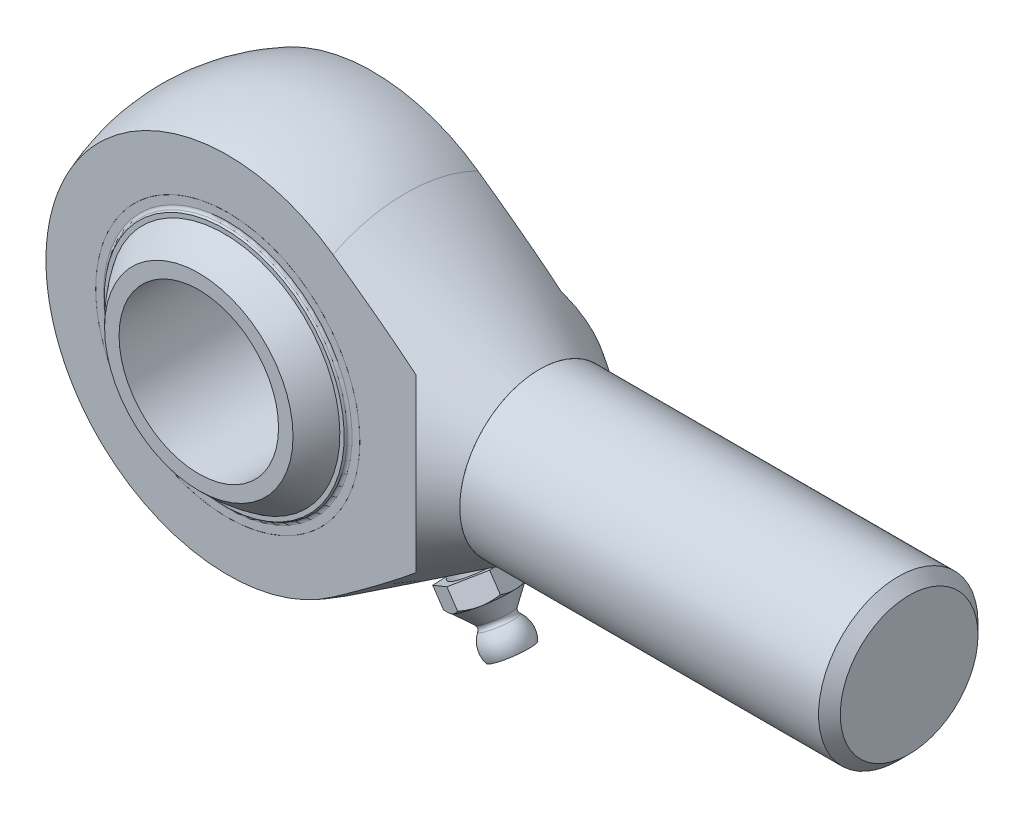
ISO-10303-21;
HEADER;
FILE_DESCRIPTION(('STEP AP214'),'2;1');
FILE_NAME('part.step','',(''),(''),'','','');
FILE_SCHEMA(('AUTOMOTIVE_DESIGN { 1 0 10303 214 1 1 1 1 }'));
ENDSEC;
DATA;
#1=APPLICATION_CONTEXT('core data for automotive mechanical design processes');
#2=APPLICATION_PROTOCOL_DEFINITION('international standard','automotive_design',2000,#1);
#3=PRODUCT_CONTEXT('',#1,'mechanical');
#4=PRODUCT('Part','Part','',(#3));
#5=PRODUCT_RELATED_PRODUCT_CATEGORY('part','',(#4));
#6=PRODUCT_DEFINITION_FORMATION('','',#4);
#7=PRODUCT_DEFINITION_CONTEXT('part definition',#1,'design');
#8=PRODUCT_DEFINITION('design','',#6,#7);
#9=PRODUCT_DEFINITION_SHAPE('','',#8);
#10=(LENGTH_UNIT() NAMED_UNIT(*) SI_UNIT(.MILLI.,.METRE.));
#11=(NAMED_UNIT(*) PLANE_ANGLE_UNIT() SI_UNIT($,.RADIAN.));
#12=(NAMED_UNIT(*) SI_UNIT($,.STERADIAN.) SOLID_ANGLE_UNIT());
#13=UNCERTAINTY_MEASURE_WITH_UNIT(LENGTH_MEASURE(1.E-05),#10,'distance_accuracy_value','');
#14=(GEOMETRIC_REPRESENTATION_CONTEXT(3) GLOBAL_UNCERTAINTY_ASSIGNED_CONTEXT((#13)) GLOBAL_UNIT_ASSIGNED_CONTEXT((#10,
#11,#12)) REPRESENTATION_CONTEXT('',''));
#15=CARTESIAN_POINT('',(0.,0.,0.));
#16=DIRECTION('',(0.,0.,1.));
#17=DIRECTION('',(1.,0.,0.));
#18=AXIS2_PLACEMENT_3D('',#15,#16,#17);
#19=CARTESIAN_POINT('',(-6.19056725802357,-19.0526069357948,2.81546809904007));
#20=DIRECTION('',(0.306009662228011,0.941800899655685,-0.139173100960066));
#21=DIRECTION('',(-0.0430068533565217,-0.132361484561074,-0.99026806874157));
#22=AXIS2_PLACEMENT_3D('',#19,#20,#21);
#23=SPHERICAL_SURFACE('',#22,2.25);
#24=CARTESIAN_POINT('',(-5.50204551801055,-16.9335549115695,2.50232862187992));
#25=VERTEX_POINT('',#24);
#26=VERTEX_LOOP('',#25);
#27=FACE_BOUND('',#26,.T.);
#28=ADVANCED_FACE('P0_F12',(#27),#23,.T.);
#29=CLOSED_SHELL('',(#28));
#30=MANIFOLD_SOLID_BREP('P0_B1',#29);
#31=CARTESIAN_POINT('',(0.,20.0330964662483,2.81546809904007));
#32=DIRECTION('',(0.,-0.99026806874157,-0.139173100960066));
#33=DIRECTION('',(0.,0.139173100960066,-0.99026806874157));
#34=AXIS2_PLACEMENT_3D('',#31,#32,#33);
#35=SPHERICAL_SURFACE('',#34,2.25);
#36=CARTESIAN_POINT('',(0.,17.8049933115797,2.50232862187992));
#37=VERTEX_POINT('',#36);
#38=VERTEX_LOOP('',#37);
#39=FACE_BOUND('',#38,.T.);
#40=ADVANCED_FACE('P1_F12',(#39),#35,.T.);
#41=CLOSED_SHELL('',(#40));
#42=MANIFOLD_SOLID_BREP('P1_B1',#41);
#43=CARTESIAN_POINT('',(6.1905672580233,-19.0526069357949,-2.81546809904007));
#44=DIRECTION('',(-0.306009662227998,0.94180089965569,0.139173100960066));
#45=DIRECTION('',(0.0430068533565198,-0.132361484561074,0.99026806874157));
#46=AXIS2_PLACEMENT_3D('',#43,#44,#45);
#47=SPHERICAL_SURFACE('',#46,2.25);
#48=CARTESIAN_POINT('',(5.5020455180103,-16.9335549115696,-2.50232862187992));
#49=VERTEX_POINT('',#48);
#50=VERTEX_LOOP('',#49);
#51=FACE_BOUND('',#50,.T.);
#52=ADVANCED_FACE('P2_F12',(#51),#47,.T.);
#53=CLOSED_SHELL('',(#52));
#54=MANIFOLD_SOLID_BREP('P2_B1',#53);
#55=CARTESIAN_POINT('',(0.,0.,0.));
#56=DIRECTION('',(0.,0.,1.));
#57=DIRECTION('',(0.999027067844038,0.044101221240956,0.));
#58=AXIS2_PLACEMENT_3D('',#55,#56,#57);
#59=CYLINDRICAL_SURFACE('',#58,18.23);
#60=CARTESIAN_POINT('',(0.,0.,-10.));
#61=DIRECTION('',(0.,0.,1.));
#62=DIRECTION('',(0.999027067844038,0.044101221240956,0.));
#63=AXIS2_PLACEMENT_3D('',#60,#61,#62);
#64=CIRCLE('',#63,18.23);
#65=CARTESIAN_POINT('',(18.2122634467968,0.803965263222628,-10.));
#66=VERTEX_POINT('',#65);
#67=EDGE_CURVE('P3_E34',#66,#66,#64,.T.);
#68=ORIENTED_EDGE('',*,*,#67,.T.);
#69=EDGE_LOOP('',(#68));
#70=FACE_BOUND('',#69,.T.);
#71=CARTESIAN_POINT('',(0.,0.,-9.5));
#72=DIRECTION('',(0.,0.,1.));
#73=DIRECTION('',(0.999027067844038,0.044101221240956,0.));
#74=AXIS2_PLACEMENT_3D('',#71,#72,#73);
#75=CIRCLE('',#74,18.23);
#76=CARTESIAN_POINT('',(18.2122634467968,0.803965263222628,-9.5));
#77=VERTEX_POINT('',#76);
#78=EDGE_CURVE('P3_E43',#77,#77,#75,.T.);
#79=ORIENTED_EDGE('',*,*,#78,.F.);
#80=EDGE_LOOP('',(#79));
#81=FACE_BOUND('',#80,.T.);
#82=ADVANCED_FACE('P3_F14',(#70,#81),#59,.T.);
#83=CARTESIAN_POINT('',(-0.803965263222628,18.2122634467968,-10.));
#84=DIRECTION('',(0.,0.,-1.));
#85=DIRECTION('',(-0.999027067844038,-0.044101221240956,0.));
#86=AXIS2_PLACEMENT_3D('',#83,#84,#85);
#87=PLANE('',#86);
#88=CARTESIAN_POINT('',(0.,0.,-10.));
#89=DIRECTION('',(0.,0.,-1.));
#90=DIRECTION('',(-0.999027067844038,-0.044101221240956,0.));
#91=AXIS2_PLACEMENT_3D('',#88,#89,#90);
#92=CIRCLE('',#91,17.1452601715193);
#93=CARTESIAN_POINT('',(-17.1285789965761,-0.756126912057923,-10.));
#94=VERTEX_POINT('',#93);
#95=EDGE_CURVE('P3_E21',#94,#94,#92,.F.);
#96=ORIENTED_EDGE('',*,*,#95,.T.);
#97=EDGE_LOOP('',(#96));
#98=FACE_BOUND('',#97,.T.);
#99=ORIENTED_EDGE('',*,*,#67,.F.);
#100=EDGE_LOOP('',(#99));
#101=FACE_BOUND('',#100,.T.);
#102=ADVANCED_FACE('P3_F50',(#98,#101),#87,.T.);
#103=CARTESIAN_POINT('',(0.,0.,0.));
#104=DIRECTION('',(0.,0.,1.));
#105=DIRECTION('',(-0.044101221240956,0.999027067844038,0.));
#106=AXIS2_PLACEMENT_3D('',#103,#104,#105);
#107=SPHERICAL_SURFACE('',#106,19.6049731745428);
#108=CARTESIAN_POINT('',(0.,0.,-10.2388705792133));
#109=DIRECTION('',(0.,0.,1.));
#110=DIRECTION('',(0.999027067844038,0.044101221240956,0.));
#111=AXIS2_PLACEMENT_3D('',#108,#109,#110);
#112=CIRCLE('',#111,16.7188666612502);
#113=CARTESIAN_POINT('',(-0.737322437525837,16.7026003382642,-10.2388705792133));
#114=VERTEX_POINT('',#113);
#115=EDGE_CURVE('P3_E10',#114,#114,#112,.F.);
#116=CARTESIAN_POINT('',(0.,0.,-10.5));
#117=DIRECTION('',(0.,0.,1.));
#118=DIRECTION('',(0.999027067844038,0.044101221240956,0.));
#119=AXIS2_PLACEMENT_3D('',#116,#117,#118);
#120=CIRCLE('',#119,16.5561158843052);
#121=CARTESIAN_POINT('',(-0.730144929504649,16.5400079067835,-10.5));
#122=VERTEX_POINT('',#121);
#123=EDGE_CURVE('P3_E37',#122,#122,#120,.T.);
#124=CARTESIAN_POINT('',(-0.737322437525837,16.7026003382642,-10.2388705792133));
#125=CARTESIAN_POINT('',(-0.737248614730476,16.7009280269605,-10.2416039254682));
#126=CARTESIAN_POINT('',(-0.737174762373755,16.6992550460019,-10.2443368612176));
#127=CARTESIAN_POINT('',(-0.737026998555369,16.6959077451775,-10.2498019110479));
#128=CARTESIAN_POINT('',(-0.736953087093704,16.6942334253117,-10.2525340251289));
#129=CARTESIAN_POINT('',(-0.736805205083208,16.6908834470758,-10.2579974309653));
#130=CARTESIAN_POINT('',(-0.736731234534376,16.6892077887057,-10.2607287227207));
#131=CARTESIAN_POINT('',(-0.73658323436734,16.6858551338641,-10.2661904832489));
#132=CARTESIAN_POINT('',(-0.736509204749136,16.6841781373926,-10.2689209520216));
#133=CARTESIAN_POINT('',(-0.736361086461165,16.6808228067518,-10.2743810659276));
#134=CARTESIAN_POINT('',(-0.736286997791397,16.6791444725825,-10.2771107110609));
#135=CARTESIAN_POINT('',(-0.73613876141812,16.6757864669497,-10.2825691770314));
#136=CARTESIAN_POINT('',(-0.736064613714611,16.6741067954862,-10.2852979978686));
#137=CARTESIAN_POINT('',(-0.735916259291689,16.6707461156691,-10.2907548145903));
#138=CARTESIAN_POINT('',(-0.735842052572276,16.6690651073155,-10.293482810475));
#139=CARTESIAN_POINT('',(-0.735693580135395,16.6657017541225,-10.2989379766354));
#140=CARTESIAN_POINT('',(-0.735619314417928,16.6640194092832,-10.3016651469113));
#141=CARTESIAN_POINT('',(-0.735470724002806,16.6606533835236,-10.3071186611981));
#142=CARTESIAN_POINT('',(-0.73539639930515,16.6589697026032,-10.3098450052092));
#143=CARTESIAN_POINT('',(-0.73524769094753,16.6556010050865,-10.3152968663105));
#144=CARTESIAN_POINT('',(-0.735173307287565,16.6539159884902,-10.3180223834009));
#145=CARTESIAN_POINT('',(-0.735024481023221,16.6505446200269,-10.3234725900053));
#146=CARTESIAN_POINT('',(-0.734950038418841,16.6488582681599,-10.3261972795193));
#147=CARTESIAN_POINT('',(-0.734801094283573,16.6454842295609,-10.3316458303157));
#148=CARTESIAN_POINT('',(-0.734726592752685,16.6437965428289,-10.334369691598));
#149=CARTESIAN_POINT('',(-0.734577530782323,16.6404198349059,-10.3398165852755));
#150=CARTESIAN_POINT('',(-0.734502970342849,16.6387308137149,-10.3425396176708));
#151=CARTESIAN_POINT('',(-0.734353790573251,16.6353514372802,-10.3479848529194));
#152=CARTESIAN_POINT('',(-0.734279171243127,16.6336610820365,-10.3507070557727));
#153=CARTESIAN_POINT('',(-0.734129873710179,16.630279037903,-10.3561506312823));
#154=CARTESIAN_POINT('',(-0.734055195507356,16.6285873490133,-10.3588720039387));
#155=CARTESIAN_POINT('',(-0.733905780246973,16.6252026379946,-10.3643139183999));
#156=CARTESIAN_POINT('',(-0.733831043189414,16.6235096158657,-10.3670344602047));
#157=CARTESIAN_POINT('',(-0.733681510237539,16.620122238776,-10.3724747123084));
#158=CARTESIAN_POINT('',(-0.733606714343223,16.6184278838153,-10.3751944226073));
#159=CARTESIAN_POINT('',(-0.733457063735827,16.6150378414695,-10.3806330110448));
#160=CARTESIAN_POINT('',(-0.733382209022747,16.6133421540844,-10.3833518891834));
#161=CARTESIAN_POINT('',(-0.733232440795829,16.609949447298,-10.3887888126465));
#162=CARTESIAN_POINT('',(-0.733157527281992,16.6082524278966,-10.3915068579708));
#163=CARTESIAN_POINT('',(-0.733007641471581,16.6048570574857,-10.3969421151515));
#164=CARTESIAN_POINT('',(-0.732932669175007,16.6031587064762,-10.3996593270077));
#165=CARTESIAN_POINT('',(-0.732782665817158,16.5997606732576,-10.4050929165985));
#166=CARTESIAN_POINT('',(-0.732707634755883,16.5980609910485,-10.407809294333));
#167=CARTESIAN_POINT('',(-0.732557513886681,16.5946602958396,-10.4132412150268));
#168=CARTESIAN_POINT('',(-0.732482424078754,16.5929592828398,-10.4159567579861));
#169=CARTESIAN_POINT('',(-0.732332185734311,16.5895559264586,-10.4213870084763));
#170=CARTESIAN_POINT('',(-0.732257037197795,16.5878535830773,-10.4241017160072));
#171=CARTESIAN_POINT('',(-0.732106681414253,16.5844475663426,-10.4295302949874));
#172=CARTESIAN_POINT('',(-0.732031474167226,16.5827438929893,-10.4322441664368));
#173=CARTESIAN_POINT('',(-0.731881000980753,16.5793352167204,-10.4376710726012));
#174=CARTESIAN_POINT('',(-0.731805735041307,16.5776302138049,-10.4403841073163));
#175=CARTESIAN_POINT('',(-0.731655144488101,16.5742188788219,-10.4458093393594));
#176=CARTESIAN_POINT('',(-0.731579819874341,16.5725125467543,-10.4485215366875));
#177=CARTESIAN_POINT('',(-0.731429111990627,16.5690985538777,-10.4539450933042));
#178=CARTESIAN_POINT('',(-0.731353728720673,16.5673908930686,-10.4566564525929));
#179=CARTESIAN_POINT('',(-0.731202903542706,16.5639742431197,-10.4620783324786));
#180=CARTESIAN_POINT('',(-0.731127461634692,16.5622652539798,-10.4647888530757));
#181=CARTESIAN_POINT('',(-0.730976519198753,16.5588459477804,-10.4702090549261));
#182=CARTESIAN_POINT('',(-0.730901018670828,16.5571356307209,-10.4729187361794));
#183=CARTESIAN_POINT('',(-0.730749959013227,16.5537136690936,-10.4783372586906));
#184=CARTESIAN_POINT('',(-0.730674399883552,16.5520020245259,-10.4810460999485));
#185=CARTESIAN_POINT('',(-0.730523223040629,16.5485774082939,-10.486462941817));
#186=CARTESIAN_POINT('',(-0.73044760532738,16.5468644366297,-10.4891709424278));
#187=CARTESIAN_POINT('',(-0.730296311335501,16.5434371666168,-10.4945861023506));
#188=CARTESIAN_POINT('',(-0.730220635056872,16.5417228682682,-10.4972932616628));
#189=CARTESIAN_POINT('',(-0.730144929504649,16.5400079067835,-10.5));
#190=B_SPLINE_CURVE_WITH_KNOTS('',3,(#124,#125,#126,#127,#128,#129,#130,#131,#132,#133,#134,
#135,#136,#137,#138,#139,#140,#141,#142,#143,#144,#145,#146,#147,#148,#149,#150,#151,#152,#153,
#154,#155,#156,#157,#158,#159,#160,#161,#162,#163,#164,#165,#166,#167,#168,#169,#170,#171,#172,
#173,#174,#175,#176,#177,#178,#179,#180,#181,#182,#183,#184,#185,#186,#187,#188,#189),
.UNSPECIFIED.,.F.,.F.,(4,2,2,2,2,2,2,2,2,2,2,2,2,2,2,2,2,2,2,2,2,2,2,2,2,2,2,2,2,2,2,2,4),(0.,
0.00961557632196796,0.0192311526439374,0.0288467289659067,0.0384623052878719,0.0480778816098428,
0.0576934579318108,0.0673090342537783,0.0769246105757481,0.0865401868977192,0.0961557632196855,
0.105771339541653,0.115386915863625,0.125002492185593,0.13461806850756,0.144233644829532,
0.153849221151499,0.163464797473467,0.173080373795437,0.182695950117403,0.192311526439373,
0.201927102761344,0.211542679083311,0.221158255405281,0.23077383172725,0.240389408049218,
0.250004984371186,0.259620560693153,0.269236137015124,0.27885171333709,0.288467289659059,
0.29808286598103,0.307698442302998),.UNSPECIFIED.);
#191=EDGE_CURVE('P3_BSEAM57',#114,#122,#190,.T.);
#192=ORIENTED_EDGE('',*,*,#115,.T.);
#193=ORIENTED_EDGE('',*,*,#123,.T.);
#194=ORIENTED_EDGE('',*,*,#191,.T.);
#195=ORIENTED_EDGE('',*,*,#191,.F.);
#196=EDGE_LOOP('',(#192,#194,#193,#195));
#197=FACE_BOUND('',#196,.T.);
#198=ADVANCED_FACE('P3_F57',(#197),#107,.T.);
#199=CARTESIAN_POINT('',(-0.70389472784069,15.9453608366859,-10.5));
#200=DIRECTION('',(0.,0.,-1.));
#201=DIRECTION('',(-0.999027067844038,-0.044101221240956,0.));
#202=AXIS2_PLACEMENT_3D('',#199,#200,#201);
#203=PLANE('',#202);
#204=CARTESIAN_POINT('',(0.,0.,-10.5));
#205=DIRECTION('',(0.,0.,1.));
#206=DIRECTION('',(0.999027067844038,0.044101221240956,0.));
#207=AXIS2_PLACEMENT_3D('',#204,#205,#206);
#208=CIRCLE('',#207,15.9608896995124);
#209=CARTESIAN_POINT('',(-0.70389472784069,15.9453608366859,-10.5));
#210=VERTEX_POINT('',#209);
#211=EDGE_CURVE('P3_E40',#210,#210,#208,.T.);
#212=ORIENTED_EDGE('',*,*,#211,.T.);
#213=EDGE_LOOP('',(#212));
#214=FACE_BOUND('',#213,.T.);
#215=ORIENTED_EDGE('',*,*,#123,.F.);
#216=EDGE_LOOP('',(#215));
#217=FACE_BOUND('',#216,.T.);
#218=ADVANCED_FACE('P3_F77',(#214,#217),#203,.T.);
#219=CARTESIAN_POINT('',(0.,0.,0.));
#220=DIRECTION('',(0.,0.,1.));
#221=DIRECTION('',(-0.044101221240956,0.999027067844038,0.));
#222=AXIS2_PLACEMENT_3D('',#219,#220,#221);
#223=SPHERICAL_SURFACE('',#222,19.1049731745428);
#224=CARTESIAN_POINT('',(0.,0.,-9.74496267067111));
#225=DIRECTION('',(0.,0.,1.));
#226=DIRECTION('',(0.999027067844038,0.044101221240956,0.));
#227=AXIS2_PLACEMENT_3D('',#224,#225,#226);
#228=CIRCLE('',#227,16.4327630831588);
#229=CARTESIAN_POINT('',(-0.7247049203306,16.4167751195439,-9.74496267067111));
#230=VERTEX_POINT('',#229);
#231=EDGE_CURVE('P3_E29',#230,#230,#228,.T.);
#232=CARTESIAN_POINT('',(-0.7247049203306,16.4167751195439,-9.74496267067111));
#233=CARTESIAN_POINT('',(-0.724496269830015,16.4120485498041,-9.75294076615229));
#234=CARTESIAN_POINT('',(-0.724287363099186,16.4073161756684,-9.76091541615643));
#235=CARTESIAN_POINT('',(-0.723869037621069,16.3978398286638,-9.77685780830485));
#236=CARTESIAN_POINT('',(-0.723659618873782,16.3930958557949,-9.78482555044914));
#237=CARTESIAN_POINT('',(-0.723240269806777,16.3835963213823,-9.80075410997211));
#238=CARTESIAN_POINT('',(-0.723030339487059,16.3788407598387,-9.80871492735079));
#239=CARTESIAN_POINT('',(-0.722609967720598,16.3693180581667,-9.82462962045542));
#240=CARTESIAN_POINT('',(-0.722399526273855,16.3645509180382,-9.83258349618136));
#241=CARTESIAN_POINT('',(-0.721978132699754,16.3550050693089,-9.84848428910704));
#242=CARTESIAN_POINT('',(-0.721767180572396,16.3502263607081,-9.85643120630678));
#243=CARTESIAN_POINT('',(-0.721344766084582,16.3406573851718,-9.87231806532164));
#244=CARTESIAN_POINT('',(-0.721133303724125,16.3358671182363,-9.88025800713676));
#245=CARTESIAN_POINT('',(-0.720709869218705,16.3262750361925,-9.89613089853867));
#246=CARTESIAN_POINT('',(-0.720497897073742,16.3214732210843,-9.90406384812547));
#247=CARTESIAN_POINT('',(-0.720073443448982,16.3118580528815,-9.91992273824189));
#248=CARTESIAN_POINT('',(-0.719860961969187,16.307044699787,-9.92784867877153));
#249=CARTESIAN_POINT('',(-0.719435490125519,16.2974064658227,-9.94369353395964));
#250=CARTESIAN_POINT('',(-0.719222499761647,16.292581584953,-9.95161244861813));
#251=CARTESIAN_POINT('',(-0.71879601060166,16.2829203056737,-9.96744323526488));
#252=CARTESIAN_POINT('',(-0.718582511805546,16.2780839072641,-9.97535510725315));
#253=CARTESIAN_POINT('',(-0.718155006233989,16.268399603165,-9.99117179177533));
#254=CARTESIAN_POINT('',(-0.717940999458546,16.2635516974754,-9.99907660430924));
#255=CARTESIAN_POINT('',(-0.717512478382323,16.2538443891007,-10.0148791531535));
#256=CARTESIAN_POINT('',(-0.717297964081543,16.2489849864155,-10.0227768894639));
#257=CARTESIAN_POINT('',(-0.716868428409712,16.2392546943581,-10.0385652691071));
#258=CARTESIAN_POINT('',(-0.716653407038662,16.2343838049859,-10.0464559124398));
#259=CARTESIAN_POINT('',(-0.716222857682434,16.2246305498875,-10.0622300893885));
#260=CARTESIAN_POINT('',(-0.716007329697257,16.2197481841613,-10.0701136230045));
#261=CARTESIAN_POINT('',(-0.715575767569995,16.2099719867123,-10.0858735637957));
#262=CARTESIAN_POINT('',(-0.715359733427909,16.2050781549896,-10.0937499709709));
#263=CARTESIAN_POINT('',(-0.714927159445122,16.1952790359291,-10.1094956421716));
#264=CARTESIAN_POINT('',(-0.714710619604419,16.1903737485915,-10.1173649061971));
#265=CARTESIAN_POINT('',(-0.714277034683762,16.1805517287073,-10.1330962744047));
#266=CARTESIAN_POINT('',(-0.714059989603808,16.1756349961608,-10.1409583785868));
#267=CARTESIAN_POINT('',(-0.713625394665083,16.1657900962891,-10.156675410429));
#268=CARTESIAN_POINT('',(-0.713407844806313,16.160861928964,-10.1645303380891));
#269=CARTESIAN_POINT('',(-0.712972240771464,16.1509941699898,-10.180233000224));
#270=CARTESIAN_POINT('',(-0.712754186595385,16.1460545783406,-10.1880807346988));
#271=CARTESIAN_POINT('',(-0.712317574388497,16.1361639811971,-10.203768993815));
#272=CARTESIAN_POINT('',(-0.712099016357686,16.1312129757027,-10.2116095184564));
#273=CARTESIAN_POINT('',(-0.711661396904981,16.1212995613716,-10.227283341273));
#274=CARTESIAN_POINT('',(-0.711442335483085,16.1163371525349,-10.2351166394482));
#275=CARTESIAN_POINT('',(-0.711003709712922,16.1064009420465,-10.250775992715));
#276=CARTESIAN_POINT('',(-0.710784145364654,16.1014271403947,-10.2586020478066));
#277=CARTESIAN_POINT('',(-0.710344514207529,16.0914681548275,-10.2742468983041));
#278=CARTESIAN_POINT('',(-0.71012444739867,16.086482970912,-10.28206569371));
#279=CARTESIAN_POINT('',(-0.70968381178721,16.0765012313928,-10.2976960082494));
#280=CARTESIAN_POINT('',(-0.709463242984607,16.0715046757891,-10.3055075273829));
#281=CARTESIAN_POINT('',(-0.709021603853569,16.0615002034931,-10.3211232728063));
#282=CARTESIAN_POINT('',(-0.708800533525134,16.0564922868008,-10.3289274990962));
#283=CARTESIAN_POINT('',(-0.708357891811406,16.0464651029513,-10.3445286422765));
#284=CARTESIAN_POINT('',(-0.708136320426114,16.0414458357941,-10.352325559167));
#285=CARTESIAN_POINT('',(-0.70769267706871,16.0313959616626,-10.3679120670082));
#286=CARTESIAN_POINT('',(-0.707470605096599,16.0263653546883,-10.375701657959));
#287=CARTESIAN_POINT('',(-0.707025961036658,16.0162928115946,-10.3912734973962));
#288=CARTESIAN_POINT('',(-0.70680338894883,16.0112508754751,-10.3990557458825));
#289=CARTESIAN_POINT('',(-0.706357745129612,16.0011556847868,-10.4146128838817));
#290=CARTESIAN_POINT('',(-0.706134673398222,15.9961024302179,-10.4223877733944));
#291=CARTESIAN_POINT('',(-0.705688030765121,15.985984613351,-10.437930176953));
#292=CARTESIAN_POINT('',(-0.705464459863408,15.980920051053,-10.4456976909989));
#293=CARTESIAN_POINT('',(-0.70501681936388,15.9707796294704,-10.4612253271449));
#294=CARTESIAN_POINT('',(-0.704792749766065,15.9657037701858,-10.468985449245));
#295=CARTESIAN_POINT('',(-0.704344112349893,15.9555407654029,-10.4844982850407));
#296=CARTESIAN_POINT('',(-0.704119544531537,15.9504536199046,-10.4922509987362));
#297=CARTESIAN_POINT('',(-0.70389472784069,15.9453608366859,-10.5));
#298=B_SPLINE_CURVE_WITH_KNOTS('',3,(#232,#233,#234,#235,#236,#237,#238,#239,#240,#241,#242,
#243,#244,#245,#246,#247,#248,#249,#250,#251,#252,#253,#254,#255,#256,#257,#258,#259,#260,#261,
#262,#263,#264,#265,#266,#267,#268,#269,#270,#271,#272,#273,#274,#275,#276,#277,#278,#279,#280,
#281,#282,#283,#284,#285,#286,#287,#288,#289,#290,#291,#292,#293,#294,#295,#296,#297),
.UNSPECIFIED.,.F.,.F.,(4,2,2,2,2,2,2,2,2,2,2,2,2,2,2,2,2,2,2,2,2,2,2,2,2,2,2,2,2,2,2,2,4),(0.,
0.0278263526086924,0.055652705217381,0.0834790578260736,0.111305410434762,0.139131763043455,
0.166958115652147,0.194784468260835,0.222610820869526,0.250437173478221,0.278263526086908,
0.306089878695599,0.333916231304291,0.361742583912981,0.389568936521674,0.417395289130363,
0.445221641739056,0.473047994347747,0.500874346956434,0.528700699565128,0.556527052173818,
0.584353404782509,0.612179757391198,0.640006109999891,0.667832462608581,0.695658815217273,
0.723485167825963,0.751311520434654,0.779137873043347,0.806964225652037,0.834790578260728,
0.862616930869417,0.89044328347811),.UNSPECIFIED.);
#299=EDGE_CURVE('P3_BSEAM68',#230,#210,#298,.T.);
#300=ORIENTED_EDGE('',*,*,#231,.T.);
#301=ORIENTED_EDGE('',*,*,#211,.F.);
#302=ORIENTED_EDGE('',*,*,#299,.T.);
#303=ORIENTED_EDGE('',*,*,#299,.F.);
#304=EDGE_LOOP('',(#300,#302,#301,#303));
#305=FACE_BOUND('',#304,.T.);
#306=ADVANCED_FACE('P3_F68',(#305),#223,.F.);
#307=CARTESIAN_POINT('',(-0.803965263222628,18.2122634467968,-9.5));
#308=DIRECTION('',(0.,0.,1.));
#309=DIRECTION('',(0.999027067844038,0.044101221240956,0.));
#310=AXIS2_PLACEMENT_3D('',#307,#308,#309);
#311=PLANE('',#310);
#312=CARTESIAN_POINT('',(0.,0.,-9.5));
#313=DIRECTION('',(0.,0.,1.));
#314=DIRECTION('',(0.999027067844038,0.044101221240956,0.));
#315=AXIS2_PLACEMENT_3D('',#312,#313,#314);
#316=CIRCLE('',#315,16.8628281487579);
#317=CARTESIAN_POINT('',(16.8464217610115,0.743671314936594,-9.5));
#318=VERTEX_POINT('',#317);
#319=EDGE_CURVE('P3_E25',#318,#318,#316,.F.);
#320=ORIENTED_EDGE('',*,*,#319,.T.);
#321=EDGE_LOOP('',(#320));
#322=FACE_BOUND('',#321,.T.);
#323=ORIENTED_EDGE('',*,*,#78,.T.);
#324=EDGE_LOOP('',(#323));
#325=FACE_BOUND('',#324,.T.);
#326=ADVANCED_FACE('P3_F47',(#322,#325),#311,.T.);
#327=CARTESIAN_POINT('',(0.,0.,-10.));
#328=DIRECTION('',(0.,0.,1.));
#329=DIRECTION('',(0.999027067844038,0.044101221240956,0.));
#330=AXIS2_PLACEMENT_3D('',#327,#328,#329);
#331=TOROIDAL_SURFACE('',#330,16.8628281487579,0.5);
#332=ORIENTED_EDGE('',*,*,#319,.F.);
#333=EDGE_LOOP('',(#332));
#334=FACE_BOUND('',#333,.T.);
#335=ORIENTED_EDGE('',*,*,#231,.F.);
#336=EDGE_LOOP('',(#335));
#337=FACE_BOUND('',#336,.T.);
#338=ADVANCED_FACE('P3_F60',(#334,#337),#331,.T.);
#339=CARTESIAN_POINT('',(0.,0.,-10.5));
#340=DIRECTION('',(0.,0.,-1.));
#341=DIRECTION('',(-0.999027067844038,-0.044101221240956,0.));
#342=AXIS2_PLACEMENT_3D('',#339,#340,#341);
#343=TOROIDAL_SURFACE('',#342,17.1452601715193,0.5);
#344=ORIENTED_EDGE('',*,*,#115,.F.);
#345=EDGE_LOOP('',(#344));
#346=FACE_BOUND('',#345,.T.);
#347=ORIENTED_EDGE('',*,*,#95,.F.);
#348=EDGE_LOOP('',(#347));
#349=FACE_BOUND('',#348,.T.);
#350=ADVANCED_FACE('P3_F16',(#346,#349),#343,.F.);
#351=CLOSED_SHELL('',(#82,#102,#198,#218,#306,#326,#338,#350));
#352=MANIFOLD_SOLID_BREP('P3_B1',#351);
#353=CARTESIAN_POINT('',(-11.7751586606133,-16.2071154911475,2.81546809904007));
#354=DIRECTION('',(0.582064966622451,0.801143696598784,-0.139173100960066));
#355=DIRECTION('',(-0.0818038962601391,-0.112593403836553,-0.99026806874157));
#356=AXIS2_PLACEMENT_3D('',#353,#354,#355);
#357=SPHERICAL_SURFACE('',#356,2.25);
#358=CARTESIAN_POINT('',(-10.4655124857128,-14.4045421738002,2.50232862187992));
#359=VERTEX_POINT('',#358);
#360=VERTEX_LOOP('',#359);
#361=FACE_BOUND('',#360,.T.);
#362=ADVANCED_FACE('P4_F12',(#361),#357,.T.);
#363=CLOSED_SHELL('',(#362));
#364=MANIFOLD_SOLID_BREP('P4_B1',#363);
#365=CARTESIAN_POINT('',(6.19056725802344,19.0526069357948,2.81546809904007));
#366=DIRECTION('',(-0.306009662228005,-0.941800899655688,-0.139173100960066));
#367=DIRECTION('',(0.0430068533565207,0.132361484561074,-0.99026806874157));
#368=AXIS2_PLACEMENT_3D('',#365,#366,#367);
#369=SPHERICAL_SURFACE('',#368,2.25);
#370=CARTESIAN_POINT('',(5.50204551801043,16.9335549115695,2.50232862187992));
#371=VERTEX_POINT('',#370);
#372=VERTEX_LOOP('',#371);
#373=FACE_BOUND('',#372,.T.);
#374=ADVANCED_FACE('P5_F12',(#373),#369,.T.);
#375=CLOSED_SHELL('',(#374));
#376=MANIFOLD_SOLID_BREP('P5_B1',#375);
#377=CARTESIAN_POINT('',(-1.3989044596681E-13,-20.0330964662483,-2.81546809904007));
#378=DIRECTION('',(0.,0.99026806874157,0.139173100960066));
#379=DIRECTION('',(0.,-0.139173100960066,0.99026806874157));
#380=AXIS2_PLACEMENT_3D('',#377,#378,#379);
#381=SPHERICAL_SURFACE('',#380,2.25);
#382=CARTESIAN_POINT('',(-1.24331675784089E-13,-17.8049933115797,-2.50232862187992));
#383=VERTEX_POINT('',#382);
#384=VERTEX_LOOP('',#383);
#385=FACE_BOUND('',#384,.T.);
#386=ADVANCED_FACE('P6_F12',(#385),#381,.T.);
#387=CLOSED_SHELL('',(#386));
#388=MANIFOLD_SOLID_BREP('P6_B1',#387);
#389=CARTESIAN_POINT('',(-16.2071154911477,-11.775158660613,2.81546809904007));
#390=DIRECTION('',(0.801143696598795,0.582064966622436,-0.139173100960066));
#391=DIRECTION('',(-0.112593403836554,-0.081803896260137,-0.99026806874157));
#392=AXIS2_PLACEMENT_3D('',#389,#390,#391);
#393=SPHERICAL_SURFACE('',#392,2.25);
#394=CARTESIAN_POINT('',(-14.4045421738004,-10.4655124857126,2.50232862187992));
#395=VERTEX_POINT('',#394);
#396=VERTEX_LOOP('',#395);
#397=FACE_BOUND('',#396,.T.);
#398=ADVANCED_FACE('P7_F12',(#397),#393,.T.);
#399=CLOSED_SHELL('',(#398));
#400=MANIFOLD_SOLID_BREP('P7_B1',#399);
#401=CARTESIAN_POINT('',(11.7751586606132,16.2071154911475,2.81546809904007));
#402=DIRECTION('',(-0.582064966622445,-0.801143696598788,-0.139173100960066));
#403=DIRECTION('',(0.0818038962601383,0.112593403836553,-0.99026806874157));
#404=AXIS2_PLACEMENT_3D('',#401,#402,#403);
#405=SPHERICAL_SURFACE('',#404,2.25);
#406=CARTESIAN_POINT('',(10.4655124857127,14.4045421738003,2.50232862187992));
#407=VERTEX_POINT('',#406);
#408=VERTEX_LOOP('',#407);
#409=FACE_BOUND('',#408,.T.);
#410=ADVANCED_FACE('P8_F12',(#409),#405,.T.);
#411=CLOSED_SHELL('',(#410));
#412=MANIFOLD_SOLID_BREP('P8_B1',#411);
#413=CARTESIAN_POINT('',(-6.19056725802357,-19.0526069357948,-2.81546809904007));
#414=DIRECTION('',(0.306009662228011,0.941800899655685,0.139173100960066));
#415=DIRECTION('',(-0.0430068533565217,-0.132361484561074,0.99026806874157));
#416=AXIS2_PLACEMENT_3D('',#413,#414,#415);
#417=SPHERICAL_SURFACE('',#416,2.25);
#418=CARTESIAN_POINT('',(-5.50204551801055,-16.9335549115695,-2.50232862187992));
#419=VERTEX_POINT('',#418);
#420=VERTEX_LOOP('',#419);
#421=FACE_BOUND('',#420,.T.);
#422=ADVANCED_FACE('P9_F12',(#421),#417,.T.);
#423=CLOSED_SHELL('',(#422));
#424=MANIFOLD_SOLID_BREP('P9_B1',#423);
#425=CARTESIAN_POINT('',(0.,0.,0.));
#426=DIRECTION('',(0.,1.,0.));
#427=DIRECTION('',(1.,0.,0.));
#428=AXIS2_PLACEMENT_3D('',#425,#426,#427);
#429=SPHERICAL_SURFACE('',#428,19.1049731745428);
#430=CARTESIAN_POINT('',(0.,0.,0.));
#431=DIRECTION('',(0.,0.,1.));
#432=DIRECTION('',(1.,0.,0.));
#433=AXIS2_PLACEMENT_3D('',#430,#431,#432);
#434=SPHERICAL_SURFACE('',#433,19.1049731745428);
#435=CARTESIAN_POINT('',(0.,0.,4.5187074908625));
#436=DIRECTION('',(0.,0.,1.));
#437=DIRECTION('',(1.,0.,0.));
#438=AXIS2_PLACEMENT_3D('',#435,#436,#437);
#439=CIRCLE('',#438,18.5629007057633);
#440=CARTESIAN_POINT('',(18.5629007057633,0.,4.5187074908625));
#441=VERTEX_POINT('',#440);
#442=EDGE_CURVE('P10_E18',#441,#441,#439,.F.);
#443=ORIENTED_EDGE('',*,*,#442,.F.);
#444=EDGE_LOOP('',(#443));
#445=FACE_BOUND('',#444,.T.);
#446=CARTESIAN_POINT('',(0.,0.,14.));
#447=DIRECTION('',(0.,0.,-1.));
#448=DIRECTION('',(-1.,0.,0.));
#449=AXIS2_PLACEMENT_3D('',#446,#447,#448);
#450=CIRCLE('',#449,13.);
#451=CARTESIAN_POINT('',(-13.,0.,14.));
#452=VERTEX_POINT('',#451);
#453=EDGE_CURVE('P10_E27',#452,#452,#450,.F.);
#454=ORIENTED_EDGE('',*,*,#453,.F.);
#455=EDGE_LOOP('',(#454));
#456=FACE_BOUND('',#455,.T.);
#457=ADVANCED_FACE('P10_F14',(#445,#456),#434,.T.);
#458=CARTESIAN_POINT('',(0.,0.,0.));
#459=DIRECTION('',(0.,0.,-1.));
#460=DIRECTION('',(-1.,0.,0.));
#461=AXIS2_PLACEMENT_3D('',#458,#459,#460);
#462=SPHERICAL_SURFACE('',#461,19.1049731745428);
#463=CARTESIAN_POINT('',(0.,0.,-4.5187074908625));
#464=DIRECTION('',(0.,0.,-1.));
#465=DIRECTION('',(-1.,0.,0.));
#466=AXIS2_PLACEMENT_3D('',#463,#464,#465);
#467=CIRCLE('',#466,18.5629007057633);
#468=CARTESIAN_POINT('',(-18.5629007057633,0.,-4.5187074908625));
#469=VERTEX_POINT('',#468);
#470=EDGE_CURVE('P10_E34',#469,#469,#467,.F.);
#471=ORIENTED_EDGE('',*,*,#470,.F.);
#472=EDGE_LOOP('',(#471));
#473=FACE_BOUND('',#472,.T.);
#474=CARTESIAN_POINT('',(0.,0.,-14.));
#475=DIRECTION('',(0.,0.,1.));
#476=DIRECTION('',(1.,0.,0.));
#477=AXIS2_PLACEMENT_3D('',#474,#475,#476);
#478=CIRCLE('',#477,13.);
#479=CARTESIAN_POINT('',(13.,0.,-14.));
#480=VERTEX_POINT('',#479);
#481=EDGE_CURVE('P10_E10',#480,#480,#478,.F.);
#482=ORIENTED_EDGE('',*,*,#481,.F.);
#483=EDGE_LOOP('',(#482));
#484=FACE_BOUND('',#483,.T.);
#485=ADVANCED_FACE('P10_F50',(#473,#484),#462,.T.);
#486=CARTESIAN_POINT('',(0.,0.,0.));
#487=DIRECTION('',(0.,0.,-1.));
#488=DIRECTION('',(-1.,0.,0.));
#489=AXIS2_PLACEMENT_3D('',#486,#487,#488);
#490=SPHERICAL_SURFACE('',#489,19.1049731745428);
#491=CARTESIAN_POINT('',(0.,0.,0.772968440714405));
#492=DIRECTION('',(0.,0.,-1.));
#493=DIRECTION('',(-1.,0.,0.));
#494=AXIS2_PLACEMENT_3D('',#491,#492,#493);
#495=CIRCLE('',#494,19.0893299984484);
#496=CARTESIAN_POINT('',(-19.0893299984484,0.,0.772968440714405));
#497=VERTEX_POINT('',#496);
#498=EDGE_CURVE('P10_E39',#497,#497,#495,.F.);
#499=ORIENTED_EDGE('',*,*,#498,.F.);
#500=EDGE_LOOP('',(#499));
#501=FACE_BOUND('',#500,.T.);
#502=CARTESIAN_POINT('',(0.,0.,-0.772968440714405));
#503=DIRECTION('',(0.,0.,1.));
#504=DIRECTION('',(1.,0.,0.));
#505=AXIS2_PLACEMENT_3D('',#502,#503,#504);
#506=CIRCLE('',#505,19.0893299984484);
#507=CARTESIAN_POINT('',(19.0893299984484,0.,-0.772968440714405));
#508=VERTEX_POINT('',#507);
#509=EDGE_CURVE('P10_E35',#508,#508,#506,.F.);
#510=ORIENTED_EDGE('',*,*,#509,.F.);
#511=EDGE_LOOP('',(#510));
#512=FACE_BOUND('',#511,.T.);
#513=ADVANCED_FACE('P10_F16',(#501,#512),#490,.T.);
#514=CARTESIAN_POINT('',(0.,0.,-19.1049731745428));
#515=DIRECTION('',(0.,0.,1.));
#516=DIRECTION('',(1.,0.,0.));
#517=AXIS2_PLACEMENT_3D('',#514,#515,#516);
#518=CYLINDRICAL_SURFACE('',#517,11.);
#519=CARTESIAN_POINT('',(0.,0.,14.));
#520=DIRECTION('',(0.,0.,-1.));
#521=DIRECTION('',(-1.,0.,0.));
#522=AXIS2_PLACEMENT_3D('',#519,#520,#521);
#523=CIRCLE('',#522,11.);
#524=CARTESIAN_POINT('',(-11.,0.,14.));
#525=VERTEX_POINT('',#524);
#526=EDGE_CURVE('P10_E31',#525,#525,#523,.F.);
#527=ORIENTED_EDGE('',*,*,#526,.T.);
#528=EDGE_LOOP('',(#527));
#529=FACE_BOUND('',#528,.T.);
#530=CARTESIAN_POINT('',(0.,0.,-14.));
#531=DIRECTION('',(0.,0.,1.));
#532=DIRECTION('',(1.,0.,0.));
#533=AXIS2_PLACEMENT_3D('',#530,#531,#532);
#534=CIRCLE('',#533,11.);
#535=CARTESIAN_POINT('',(11.,0.,-14.));
#536=VERTEX_POINT('',#535);
#537=EDGE_CURVE('P10_E22',#536,#536,#534,.F.);
#538=ORIENTED_EDGE('',*,*,#537,.T.);
#539=EDGE_LOOP('',(#538));
#540=FACE_BOUND('',#539,.T.);
#541=ADVANCED_FACE('P10_F62',(#529,#540),#518,.F.);
#542=CARTESIAN_POINT('',(-19.1049731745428,-19.1049731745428,-14.));
#543=DIRECTION('',(0.,0.,1.));
#544=DIRECTION('',(1.,0.,0.));
#545=AXIS2_PLACEMENT_3D('',#542,#543,#544);
#546=PLANE('',#545);
#547=ORIENTED_EDGE('',*,*,#481,.T.);
#548=EDGE_LOOP('',(#547));
#549=FACE_BOUND('',#548,.T.);
#550=ORIENTED_EDGE('',*,*,#537,.F.);
#551=EDGE_LOOP('',(#550));
#552=FACE_BOUND('',#551,.T.);
#553=ADVANCED_FACE('P10_F58',(#549,#552),#546,.F.);
#554=CARTESIAN_POINT('',(-19.1049731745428,-19.1049731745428,14.));
#555=DIRECTION('',(0.,0.,-1.));
#556=DIRECTION('',(-1.,0.,0.));
#557=AXIS2_PLACEMENT_3D('',#554,#555,#556);
#558=PLANE('',#557);
#559=ORIENTED_EDGE('',*,*,#453,.T.);
#560=EDGE_LOOP('',(#559));
#561=FACE_BOUND('',#560,.T.);
#562=ORIENTED_EDGE('',*,*,#526,.F.);
#563=EDGE_LOOP('',(#562));
#564=FACE_BOUND('',#563,.T.);
#565=ADVANCED_FACE('P10_F54',(#561,#564),#558,.F.);
#566=CARTESIAN_POINT('',(0.,0.,-2.81546809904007));
#567=DIRECTION('',(0.,0.,-1.));
#568=DIRECTION('',(-1.,0.,0.));
#569=AXIS2_PLACEMENT_3D('',#566,#567,#568);
#570=TOROIDAL_SURFACE('',#569,20.0330964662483,2.25);
#571=ORIENTED_EDGE('',*,*,#470,.T.);
#572=EDGE_LOOP('',(#571));
#573=FACE_BOUND('',#572,.T.);
#574=ORIENTED_EDGE('',*,*,#509,.T.);
#575=EDGE_LOOP('',(#574));
#576=FACE_BOUND('',#575,.T.);
#577=ADVANCED_FACE('P10_F57',(#573,#576),#570,.F.);
#578=CARTESIAN_POINT('',(0.,0.,2.81546809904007));
#579=DIRECTION('',(0.,0.,-1.));
#580=DIRECTION('',(-1.,0.,0.));
#581=AXIS2_PLACEMENT_3D('',#578,#579,#580);
#582=TOROIDAL_SURFACE('',#581,20.0330964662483,2.25);
#583=ORIENTED_EDGE('',*,*,#442,.T.);
#584=EDGE_LOOP('',(#583));
#585=FACE_BOUND('',#584,.T.);
#586=ORIENTED_EDGE('',*,*,#498,.T.);
#587=EDGE_LOOP('',(#586));
#588=FACE_BOUND('',#587,.T.);
#589=ADVANCED_FACE('P10_F46',(#585,#588),#582,.F.);
#590=CLOSED_SHELL('',(#457,#485,#513,#541,#553,#565,#577,#589));
#591=MANIFOLD_SOLID_BREP('P10_B1',#590);
#592=CARTESIAN_POINT('',(-19.0526069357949,-6.19056725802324,2.81546809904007));
#593=DIRECTION('',(0.94180089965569,0.306009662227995,-0.139173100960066));
#594=DIRECTION('',(-0.132361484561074,-0.0430068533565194,-0.99026806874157));
#595=AXIS2_PLACEMENT_3D('',#592,#593,#594);
#596=SPHERICAL_SURFACE('',#595,2.25);
#597=CARTESIAN_POINT('',(-16.9335549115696,-5.50204551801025,2.50232862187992));
#598=VERTEX_POINT('',#597);
#599=VERTEX_LOOP('',#598);
#600=FACE_BOUND('',#599,.T.);
#601=ADVANCED_FACE('P11_F12',(#600),#596,.T.);
#602=CLOSED_SHELL('',(#601));
#603=MANIFOLD_SOLID_BREP('P11_B1',#602);
#604=CARTESIAN_POINT('',(16.2071154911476,11.7751586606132,2.81546809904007));
#605=DIRECTION('',(-0.80114369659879,-0.582064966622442,-0.139173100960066));
#606=DIRECTION('',(0.112593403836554,0.0818038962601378,-0.99026806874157));
#607=AXIS2_PLACEMENT_3D('',#604,#605,#606);
#608=SPHERICAL_SURFACE('',#607,2.25);
#609=CARTESIAN_POINT('',(14.4045421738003,10.4655124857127,2.50232862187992));
#610=VERTEX_POINT('',#609);
#611=VERTEX_LOOP('',#610);
#612=FACE_BOUND('',#611,.T.);
#613=ADVANCED_FACE('P12_F12',(#612),#608,.T.);
#614=CLOSED_SHELL('',(#613));
#615=MANIFOLD_SOLID_BREP('P12_B1',#614);
#616=CARTESIAN_POINT('',(-11.7751586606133,-16.2071154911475,-2.81546809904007));
#617=DIRECTION('',(0.582064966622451,0.801143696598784,0.139173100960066));
#618=DIRECTION('',(-0.0818038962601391,-0.112593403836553,0.99026806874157));
#619=AXIS2_PLACEMENT_3D('',#616,#617,#618);
#620=SPHERICAL_SURFACE('',#619,2.25);
#621=CARTESIAN_POINT('',(-10.4655124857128,-14.4045421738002,-2.50232862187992));
#622=VERTEX_POINT('',#621);
#623=VERTEX_LOOP('',#622);
#624=FACE_BOUND('',#623,.T.);
#625=ADVANCED_FACE('P13_F12',(#624),#620,.T.);
#626=CLOSED_SHELL('',(#625));
#627=MANIFOLD_SOLID_BREP('P13_B1',#626);
#628=CARTESIAN_POINT('',(0.,20.0330964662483,-2.81546809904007));
#629=DIRECTION('',(0.,-0.99026806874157,0.139173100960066));
#630=DIRECTION('',(0.,0.139173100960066,0.99026806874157));
#631=AXIS2_PLACEMENT_3D('',#628,#629,#630);
#632=SPHERICAL_SURFACE('',#631,2.25);
#633=CARTESIAN_POINT('',(0.,17.8049933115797,-2.50232862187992));
#634=VERTEX_POINT('',#633);
#635=VERTEX_LOOP('',#634);
#636=FACE_BOUND('',#635,.T.);
#637=ADVANCED_FACE('P14_F12',(#636),#632,.T.);
#638=CLOSED_SHELL('',(#637));
#639=MANIFOLD_SOLID_BREP('P14_B1',#638);
#640=CARTESIAN_POINT('',(-20.0330964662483,2.09835668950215E-13,2.81546809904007));
#641=DIRECTION('',(0.99026806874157,0.,-0.139173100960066));
#642=DIRECTION('',(-0.139173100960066,0.,-0.99026806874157));
#643=AXIS2_PLACEMENT_3D('',#640,#641,#642);
#644=SPHERICAL_SURFACE('',#643,2.25);
#645=CARTESIAN_POINT('',(-17.8049933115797,1.86497513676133E-13,2.50232862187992));
#646=VERTEX_POINT('',#645);
#647=VERTEX_LOOP('',#646);
#648=FACE_BOUND('',#647,.T.);
#649=ADVANCED_FACE('P15_F12',(#648),#644,.T.);
#650=CLOSED_SHELL('',(#649));
#651=MANIFOLD_SOLID_BREP('P15_B1',#650);
#652=CARTESIAN_POINT('',(19.0526069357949,6.19056725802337,2.81546809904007));
#653=DIRECTION('',(-0.941800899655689,-0.306009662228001,-0.139173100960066));
#654=DIRECTION('',(0.132361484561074,0.0430068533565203,-0.99026806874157));
#655=AXIS2_PLACEMENT_3D('',#652,#653,#654);
#656=SPHERICAL_SURFACE('',#655,2.25);
#657=CARTESIAN_POINT('',(16.9335549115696,5.50204551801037,2.50232862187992));
#658=VERTEX_POINT('',#657);
#659=VERTEX_LOOP('',#658);
#660=FACE_BOUND('',#659,.T.);
#661=ADVANCED_FACE('P16_F12',(#660),#656,.T.);
#662=CLOSED_SHELL('',(#661));
#663=MANIFOLD_SOLID_BREP('P16_B1',#662);
#664=CARTESIAN_POINT('',(-16.2071154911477,-11.775158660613,-2.81546809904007));
#665=DIRECTION('',(0.801143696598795,0.582064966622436,0.139173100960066));
#666=DIRECTION('',(-0.112593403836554,-0.081803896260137,0.99026806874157));
#667=AXIS2_PLACEMENT_3D('',#664,#665,#666);
#668=SPHERICAL_SURFACE('',#667,2.25);
#669=CARTESIAN_POINT('',(-14.4045421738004,-10.4655124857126,-2.50232862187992));
#670=VERTEX_POINT('',#669);
#671=VERTEX_LOOP('',#670);
#672=FACE_BOUND('',#671,.T.);
#673=ADVANCED_FACE('P17_F12',(#672),#668,.T.);
#674=CLOSED_SHELL('',(#673));
#675=MANIFOLD_SOLID_BREP('P17_B1',#674);
#676=CARTESIAN_POINT('',(6.19056725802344,19.0526069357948,-2.81546809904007));
#677=DIRECTION('',(-0.306009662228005,-0.941800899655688,0.139173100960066));
#678=DIRECTION('',(0.0430068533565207,0.132361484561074,0.99026806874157));
#679=AXIS2_PLACEMENT_3D('',#676,#677,#678);
#680=SPHERICAL_SURFACE('',#679,2.25);
#681=CARTESIAN_POINT('',(5.50204551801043,16.9335549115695,-2.50232862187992));
#682=VERTEX_POINT('',#681);
#683=VERTEX_LOOP('',#682);
#684=FACE_BOUND('',#683,.T.);
#685=ADVANCED_FACE('P18_F12',(#684),#680,.T.);
#686=CLOSED_SHELL('',(#685));
#687=MANIFOLD_SOLID_BREP('P18_B1',#686);
#688=CARTESIAN_POINT('',(-19.0526069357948,6.19056725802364,2.81546809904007));
#689=DIRECTION('',(0.941800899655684,-0.306009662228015,-0.139173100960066));
#690=DIRECTION('',(-0.132361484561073,0.0430068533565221,-0.99026806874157));
#691=AXIS2_PLACEMENT_3D('',#688,#689,#690);
#692=SPHERICAL_SURFACE('',#691,2.25);
#693=CARTESIAN_POINT('',(-16.9335549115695,5.50204551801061,2.50232862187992));
#694=VERTEX_POINT('',#693);
#695=VERTEX_LOOP('',#694);
#696=FACE_BOUND('',#695,.T.);
#697=ADVANCED_FACE('P19_F12',(#696),#692,.T.);
#698=CLOSED_SHELL('',(#697));
#699=MANIFOLD_SOLID_BREP('P19_B1',#698);
#700=CARTESIAN_POINT('',(20.0330964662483,0.,2.81546809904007));
#701=DIRECTION('',(-0.99026806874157,0.,-0.139173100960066));
#702=DIRECTION('',(0.139173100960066,0.,-0.99026806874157));
#703=AXIS2_PLACEMENT_3D('',#700,#701,#702);
#704=SPHERICAL_SURFACE('',#703,2.25);
#705=CARTESIAN_POINT('',(17.8049933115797,0.,2.50232862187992));
#706=VERTEX_POINT('',#705);
#707=VERTEX_LOOP('',#706);
#708=FACE_BOUND('',#707,.T.);
#709=ADVANCED_FACE('P20_F12',(#708),#704,.T.);
#710=CLOSED_SHELL('',(#709));
#711=MANIFOLD_SOLID_BREP('P20_B1',#710);
#712=CARTESIAN_POINT('',(-19.0526069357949,-6.19056725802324,-2.81546809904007));
#713=DIRECTION('',(0.94180089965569,0.306009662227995,0.139173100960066));
#714=DIRECTION('',(-0.132361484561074,-0.0430068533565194,0.99026806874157));
#715=AXIS2_PLACEMENT_3D('',#712,#713,#714);
#716=SPHERICAL_SURFACE('',#715,2.25);
#717=CARTESIAN_POINT('',(-16.9335549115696,-5.50204551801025,-2.50232862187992));
#718=VERTEX_POINT('',#717);
#719=VERTEX_LOOP('',#718);
#720=FACE_BOUND('',#719,.T.);
#721=ADVANCED_FACE('P21_F12',(#720),#716,.T.);
#722=CLOSED_SHELL('',(#721));
#723=MANIFOLD_SOLID_BREP('P21_B1',#722);
#724=CARTESIAN_POINT('',(11.7751586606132,16.2071154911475,-2.81546809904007));
#725=DIRECTION('',(-0.582064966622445,-0.801143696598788,0.139173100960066));
#726=DIRECTION('',(0.0818038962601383,0.112593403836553,0.99026806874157));
#727=AXIS2_PLACEMENT_3D('',#724,#725,#726);
#728=SPHERICAL_SURFACE('',#727,2.25);
#729=CARTESIAN_POINT('',(10.4655124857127,14.4045421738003,-2.50232862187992));
#730=VERTEX_POINT('',#729);
#731=VERTEX_LOOP('',#730);
#732=FACE_BOUND('',#731,.T.);
#733=ADVANCED_FACE('P22_F12',(#732),#728,.T.);
#734=CLOSED_SHELL('',(#733));
#735=MANIFOLD_SOLID_BREP('P22_B1',#734);
#736=CARTESIAN_POINT('',(-16.2071154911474,11.7751586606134,2.81546809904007));
#737=DIRECTION('',(0.801143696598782,-0.582064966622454,-0.139173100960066));
#738=DIRECTION('',(-0.112593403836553,0.0818038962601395,-0.99026806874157));
#739=AXIS2_PLACEMENT_3D('',#736,#737,#738);
#740=SPHERICAL_SURFACE('',#739,2.25);
#741=CARTESIAN_POINT('',(-14.4045421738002,10.4655124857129,2.50232862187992));
#742=VERTEX_POINT('',#741);
#743=VERTEX_LOOP('',#742);
#744=FACE_BOUND('',#743,.T.);
#745=ADVANCED_FACE('P23_F12',(#744),#740,.T.);
#746=CLOSED_SHELL('',(#745));
#747=MANIFOLD_SOLID_BREP('P23_B1',#746);
#748=CARTESIAN_POINT('',(19.0526069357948,-6.19056725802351,2.81546809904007));
#749=DIRECTION('',(-0.941800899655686,0.306009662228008,-0.139173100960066));
#750=DIRECTION('',(0.132361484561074,-0.0430068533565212,-0.99026806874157));
#751=AXIS2_PLACEMENT_3D('',#748,#749,#750);
#752=SPHERICAL_SURFACE('',#751,2.25);
#753=CARTESIAN_POINT('',(16.9335549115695,-5.50204551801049,2.50232862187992));
#754=VERTEX_POINT('',#753);
#755=VERTEX_LOOP('',#754);
#756=FACE_BOUND('',#755,.T.);
#757=ADVANCED_FACE('P24_F12',(#756),#752,.T.);
#758=CLOSED_SHELL('',(#757));
#759=MANIFOLD_SOLID_BREP('P24_B1',#758);
#760=CARTESIAN_POINT('',(-20.0330964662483,2.09835668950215E-13,-2.81546809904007));
#761=DIRECTION('',(0.99026806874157,0.,0.139173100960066));
#762=DIRECTION('',(-0.139173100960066,0.,0.99026806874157));
#763=AXIS2_PLACEMENT_3D('',#760,#761,#762);
#764=SPHERICAL_SURFACE('',#763,2.25);
#765=CARTESIAN_POINT('',(-17.8049933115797,1.86497513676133E-13,-2.50232862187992));
#766=VERTEX_POINT('',#765);
#767=VERTEX_LOOP('',#766);
#768=FACE_BOUND('',#767,.T.);
#769=ADVANCED_FACE('P25_F12',(#768),#764,.T.);
#770=CLOSED_SHELL('',(#769));
#771=MANIFOLD_SOLID_BREP('P25_B1',#770);
#772=CARTESIAN_POINT('',(16.2071154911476,11.7751586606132,-2.81546809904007));
#773=DIRECTION('',(-0.80114369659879,-0.582064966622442,0.139173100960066));
#774=DIRECTION('',(0.112593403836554,0.0818038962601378,0.99026806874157));
#775=AXIS2_PLACEMENT_3D('',#772,#773,#774);
#776=SPHERICAL_SURFACE('',#775,2.25);
#777=CARTESIAN_POINT('',(14.4045421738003,10.4655124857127,-2.50232862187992));
#778=VERTEX_POINT('',#777);
#779=VERTEX_LOOP('',#778);
#780=FACE_BOUND('',#779,.T.);
#781=ADVANCED_FACE('P26_F12',(#780),#776,.T.);
#782=CLOSED_SHELL('',(#781));
#783=MANIFOLD_SOLID_BREP('P26_B1',#782);
#784=CARTESIAN_POINT('',(24.1644334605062,-17.233742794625,0.));
#785=DIRECTION('',(-0.559192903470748,0.829037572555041,0.));
#786=DIRECTION('',(0.291751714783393,0.196789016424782,-0.936031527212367));
#787=AXIS2_PLACEMENT_3D('',#784,#785,#786);
#788=CYLINDRICAL_SURFACE('',#787,3.);
#789=CARTESIAN_POINT('',(21.7039846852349,-13.5859774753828,0.));
#790=DIRECTION('',(0.559192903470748,-0.829037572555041,0.));
#791=DIRECTION('',(-0.291751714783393,-0.196789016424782,0.936031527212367));
#792=AXIS2_PLACEMENT_3D('',#789,#790,#791);
#793=CIRCLE('',#792,3.);
#794=CARTESIAN_POINT('',(20.8287295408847,-14.1763445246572,2.8080945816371));
#795=VERTEX_POINT('',#794);
#796=EDGE_CURVE('P27_E207',#795,#795,#793,.T.);
#797=ORIENTED_EDGE('',*,*,#796,.T.);
#798=EDGE_LOOP('',(#797));
#799=FACE_BOUND('',#798,.T.);
#800=CARTESIAN_POINT('',(24.1644334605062,-17.233742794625,0.));
#801=DIRECTION('',(0.559192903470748,-0.829037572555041,0.));
#802=DIRECTION('',(-0.291751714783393,-0.196789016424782,0.936031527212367));
#803=AXIS2_PLACEMENT_3D('',#800,#801,#802);
#804=CIRCLE('',#803,3.);
#805=CARTESIAN_POINT('',(23.289178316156,-17.8241098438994,2.8080945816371));
#806=VERTEX_POINT('',#805);
#807=EDGE_CURVE('P27_E337',#806,#806,#804,.T.);
#808=ORIENTED_EDGE('',*,*,#807,.F.);
#809=EDGE_LOOP('',(#808));
#810=FACE_BOUND('',#809,.T.);
#811=ADVANCED_FACE('P27_F16',(#799,#810),#788,.T.);
#812=CARTESIAN_POINT('',(21.3684689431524,-13.0885549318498,0.));
#813=DIRECTION('',(0.559192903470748,-0.829037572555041,0.));
#814=DIRECTION('',(-0.291751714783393,-0.196789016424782,0.936031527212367));
#815=AXIS2_PLACEMENT_3D('',#812,#813,#814);
#816=PLANE('',#815);
#817=CARTESIAN_POINT('',(21.3684689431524,-13.0885549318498,0.));
#818=DIRECTION('',(0.559192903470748,-0.829037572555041,0.));
#819=DIRECTION('',(-0.291751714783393,-0.196789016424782,0.936031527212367));
#820=AXIS2_PLACEMENT_3D('',#817,#818,#819);
#821=CIRCLE('',#820,2.4);
#822=CARTESIAN_POINT('',(20.6682648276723,-13.5608485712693,2.24647566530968));
#823=VERTEX_POINT('',#822);
#824=EDGE_CURVE('P27_E205',#823,#823,#821,.F.);
#825=ORIENTED_EDGE('',*,*,#824,.T.);
#826=EDGE_LOOP('',(#825));
#827=FACE_BOUND('',#826,.T.);
#828=CARTESIAN_POINT('',(21.3684689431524,-13.0885549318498,0.));
#829=DIRECTION('',(0.559192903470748,-0.829037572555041,0.));
#830=DIRECTION('',(-0.291751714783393,-0.196789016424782,0.936031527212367));
#831=AXIS2_PLACEMENT_3D('',#828,#829,#830);
#832=CIRCLE('',#831,1.2);
#833=CARTESIAN_POINT('',(21.0183668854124,-13.3247017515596,1.12323783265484));
#834=VERTEX_POINT('',#833);
#835=EDGE_CURVE('P27_E280',#834,#834,#832,.T.);
#836=ORIENTED_EDGE('',*,*,#835,.T.);
#837=EDGE_LOOP('',(#836));
#838=FACE_BOUND('',#837,.T.);
#839=ADVANCED_FACE('P27_F180',(#827,#838),#816,.F.);
#840=CARTESIAN_POINT('',(21.205319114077,-19.2296906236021,2.9314105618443));
#841=DIRECTION('',(0.559192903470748,-0.829037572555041,0.));
#842=DIRECTION('',(-0.291751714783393,-0.196789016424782,0.936031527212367));
#843=AXIS2_PLACEMENT_3D('',#840,#841,#842);
#844=PLANE('',#843);
#845=DIRECTION('',(-0.776005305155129,-0.523422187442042,-0.351916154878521));
#846=VECTOR('',#845,1.);
#847=CARTESIAN_POINT('',(24.7895340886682,-16.8121070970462,4.55684165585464));
#848=LINE('',#847,#846);
#849=CARTESIAN_POINT('',(24.7895340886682,-16.8121070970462,4.55684165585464));
#850=VERTEX_POINT('',#849);
#851=CARTESIAN_POINT('',(21.205319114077,-19.2296906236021,2.9314105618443));
#852=VERTEX_POINT('',#851);
#853=EDGE_CURVE('P27_E314',#850,#852,#848,.T.);
#854=ORIENTED_EDGE('',*,*,#853,.F.);
#855=DIRECTION('',(-0.640667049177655,-0.432135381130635,0.634669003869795));
#856=VECTOR('',#855,1.);
#857=CARTESIAN_POINT('',(27.7486484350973,-14.8161592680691,1.62543109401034));
#858=LINE('',#857,#856);
#859=CARTESIAN_POINT('',(27.7486484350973,-14.8161592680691,1.62543109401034));
#860=VERTEX_POINT('',#859);
#861=EDGE_CURVE('P27_E347',#860,#850,#858,.T.);
#862=ORIENTED_EDGE('',*,*,#861,.F.);
#863=DIRECTION('',(0.135338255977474,0.0912868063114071,0.986585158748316));
#864=VECTOR('',#863,1.);
#865=CARTESIAN_POINT('',(27.1235478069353,-15.237794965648,-2.9314105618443));
#866=LINE('',#865,#864);
#867=CARTESIAN_POINT('',(27.1235478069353,-15.237794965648,-2.9314105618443));
#868=VERTEX_POINT('',#867);
#869=EDGE_CURVE('P27_E349',#868,#860,#866,.T.);
#870=ORIENTED_EDGE('',*,*,#869,.F.);
#871=DIRECTION('',(0.776005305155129,0.523422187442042,0.351916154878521));
#872=VECTOR('',#871,1.);
#873=CARTESIAN_POINT('',(23.5393328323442,-17.6553784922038,-4.55684165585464));
#874=LINE('',#873,#872);
#875=CARTESIAN_POINT('',(23.5393328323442,-17.6553784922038,-4.55684165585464));
#876=VERTEX_POINT('',#875);
#877=EDGE_CURVE('P27_E352',#876,#868,#874,.T.);
#878=ORIENTED_EDGE('',*,*,#877,.F.);
#879=DIRECTION('',(0.640667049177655,0.432135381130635,-0.634669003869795));
#880=VECTOR('',#879,1.);
#881=CARTESIAN_POINT('',(20.580218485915,-19.6513263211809,-1.62543109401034));
#882=LINE('',#881,#880);
#883=CARTESIAN_POINT('',(20.580218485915,-19.6513263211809,-1.62543109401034));
#884=VERTEX_POINT('',#883);
#885=EDGE_CURVE('P27_E354',#884,#876,#882,.T.);
#886=ORIENTED_EDGE('',*,*,#885,.F.);
#887=DIRECTION('',(-0.135338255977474,-0.0912868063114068,-0.986585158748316));
#888=VECTOR('',#887,1.);
#889=CARTESIAN_POINT('',(21.205319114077,-19.2296906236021,2.9314105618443));
#890=LINE('',#889,#888);
#891=EDGE_CURVE('P27_E355',#852,#884,#890,.T.);
#892=ORIENTED_EDGE('',*,*,#891,.F.);
#893=EDGE_LOOP('',(#854,#862,#870,#878,#886,#892));
#894=FACE_BOUND('',#893,.T.);
#895=ORIENTED_EDGE('',*,*,#807,.T.);
#896=EDGE_LOOP('',(#895));
#897=FACE_BOUND('',#896,.T.);
#898=ADVANCED_FACE('P27_F147',(#894,#897),#844,.F.);
#899=CARTESIAN_POINT('',(26.4671127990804,-19.2992198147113,4.55684165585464));
#900=DIRECTION('',(0.291751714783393,0.196789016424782,-0.936031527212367));
#901=DIRECTION('',(0.776005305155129,0.523422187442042,0.351916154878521));
#902=AXIS2_PLACEMENT_3D('',#899,#900,#901);
#903=PLANE('',#902);
#904=DIRECTION('',(-0.559192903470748,0.829037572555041,0.));
#905=VECTOR('',#904,1.);
#906=CARTESIAN_POINT('',(22.8828978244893,-21.7168033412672,2.9314105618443));
#907=LINE('',#906,#905);
#908=CARTESIAN_POINT('',(22.6831174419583,-21.4206167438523,2.9314105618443));
#909=VERTEX_POINT('',#908);
#910=EDGE_CURVE('P27_E300',#909,#852,#907,.T.);
#911=ORIENTED_EDGE('',*,*,#910,.F.);
#912=CARTESIAN_POINT('',(28.4137860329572,-15.6122718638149,5.93873540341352));
#913=CARTESIAN_POINT('',(28.3255245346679,-15.774365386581,5.87714702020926));
#914=CARTESIAN_POINT('',(28.2365033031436,-15.9359992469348,5.81541847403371));
#915=CARTESIAN_POINT('',(28.056523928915,-16.2580831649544,5.69160654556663));
#916=CARTESIAN_POINT('',(27.9655654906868,-16.4185330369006,5.62952311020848));
#917=CARTESIAN_POINT('',(27.7808284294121,-16.7387886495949,5.50461263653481));
#918=CARTESIAN_POINT('',(27.6870373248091,-16.8985863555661,5.44178339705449));
#919=CARTESIAN_POINT('',(27.4965543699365,-17.2162394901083,5.31562912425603));
#920=CARTESIAN_POINT('',(27.3998626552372,-17.3740950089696,5.25230411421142));
#921=CARTESIAN_POINT('',(27.19967483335,-17.6924028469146,5.12298728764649));
#922=CARTESIAN_POINT('',(27.0960597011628,-17.8527726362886,5.05697572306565));
#923=CARTESIAN_POINT('',(26.8840055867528,-18.1700134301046,4.92418462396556));
#924=CARTESIAN_POINT('',(26.7755660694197,-18.3268840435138,4.85740500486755));
#925=CARTESIAN_POINT('',(26.5528909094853,-18.6356137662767,4.72309277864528));
#926=CARTESIAN_POINT('',(26.4386674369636,-18.7874823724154,4.65556196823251));
#927=CARTESIAN_POINT('',(26.2028481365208,-19.0848967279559,4.51953175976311));
#928=CARTESIAN_POINT('',(26.0812546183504,-19.2304444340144,4.45103267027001));
#929=CARTESIAN_POINT('',(25.8298774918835,-19.5124136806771,4.31340038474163));
#930=CARTESIAN_POINT('',(25.7001428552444,-19.6488812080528,4.24427278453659));
#931=CARTESIAN_POINT('',(25.4306848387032,-19.9111527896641,4.10514605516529));
#932=CARTESIAN_POINT('',(25.2909624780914,-20.0369579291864,4.0351470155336));
#933=CARTESIAN_POINT('',(25.0029694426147,-20.2740038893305,3.89554647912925));
#934=CARTESIAN_POINT('',(24.8548370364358,-20.3854160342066,3.82595206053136));
#935=CARTESIAN_POINT('',(24.5489386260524,-20.5941324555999,3.68672653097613));
#936=CARTESIAN_POINT('',(24.3911724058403,-20.6914364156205,3.61709541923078));
#937=CARTESIAN_POINT('',(24.1163566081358,-20.8445903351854,3.49923935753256));
#938=CARTESIAN_POINT('',(24.0013710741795,-20.9040939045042,3.45088962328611));
#939=CARTESIAN_POINT('',(23.7680732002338,-21.0165118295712,3.35453852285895));
#940=CARTESIAN_POINT('',(23.6497604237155,-21.0694253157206,3.30653720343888));
#941=CARTESIAN_POINT('',(23.2906362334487,-21.2191490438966,3.16312420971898));
#942=CARTESIAN_POINT('',(23.0457581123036,-21.3068779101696,3.06835422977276));
#943=CARTESIAN_POINT('',(22.6707980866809,-21.4252342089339,2.92659997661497));
#944=CARTESIAN_POINT('',(22.5430627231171,-21.4628233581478,2.87888348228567));
#945=CARTESIAN_POINT('',(22.2862465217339,-21.533802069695,2.78391403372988));
#946=CARTESIAN_POINT('',(22.1571656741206,-21.5671916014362,2.73666108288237));
#947=CARTESIAN_POINT('',(21.8980270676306,-21.6303892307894,2.64260363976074));
#948=CARTESIAN_POINT('',(21.7679696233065,-21.6601984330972,2.59579901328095));
#949=CARTESIAN_POINT('',(21.5070666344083,-21.7167958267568,2.50257924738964));
#950=CARTESIAN_POINT('',(21.3762211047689,-21.7435840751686,2.45616410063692));
#951=CARTESIAN_POINT('',(21.035721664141,-21.8098240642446,2.33610767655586));
#952=CARTESIAN_POINT('',(20.8255912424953,-21.8473039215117,2.26273243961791));
#953=CARTESIAN_POINT('',(20.4042500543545,-21.9172827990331,2.11669239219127));
#954=CARTESIAN_POINT('',(20.1930391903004,-21.9497813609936,2.04402764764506));
#955=CARTESIAN_POINT('',(19.7698021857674,-22.0109123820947,1.89925684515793));
#956=CARTESIAN_POINT('',(19.5577758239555,-22.0395437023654,1.82715095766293));
#957=CARTESIAN_POINT('',(19.1331726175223,-22.0937589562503,1.68340827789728));
#958=CARTESIAN_POINT('',(18.920595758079,-22.1193428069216,1.61177149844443));
#959=CARTESIAN_POINT('',(18.4947421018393,-22.1681181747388,1.46878273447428));
#960=CARTESIAN_POINT('',(18.2814647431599,-22.1913063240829,1.39743128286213));
#961=CARTESIAN_POINT('',(17.8545994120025,-22.2357187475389,1.25504444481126));
#962=CARTESIAN_POINT('',(17.6410114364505,-22.2569430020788,1.18400906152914));
#963=CARTESIAN_POINT('',(16.9999726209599,-22.3182268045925,0.971319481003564));
#964=CARTESIAN_POINT('',(16.572165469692,-22.3559064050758,0.83005457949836));
#965=CARTESIAN_POINT('',(15.7582168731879,-22.4234230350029,0.562160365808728));
#966=CARTESIAN_POINT('',(15.3721308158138,-22.4536670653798,0.435462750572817));
#967=CARTESIAN_POINT('',(14.5995987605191,-22.511545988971,0.182503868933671));
#968=CARTESIAN_POINT('',(14.2131527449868,-22.5391807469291,0.0562426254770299));
#969=CARTESIAN_POINT('',(13.441189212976,-22.5924064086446,-0.195560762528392));
#970=CARTESIAN_POINT('',(13.0556724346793,-22.6180032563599,-0.321103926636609));
#971=CARTESIAN_POINT('',(12.2844804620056,-22.6676608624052,-0.571916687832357));
#972=CARTESIAN_POINT('',(11.8988052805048,-22.6917217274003,-0.697186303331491));
#973=CARTESIAN_POINT('',(11.5130660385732,-22.7152238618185,-0.822358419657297));
#974=B_SPLINE_CURVE_WITH_KNOTS('',3,(#912,#913,#914,#915,#916,#917,#918,#919,#920,#921,#922,
#923,#924,#925,#926,#927,#928,#929,#930,#931,#932,#933,#934,#935,#936,#937,#938,#939,#940,#941,
#942,#943,#944,#945,#946,#947,#948,#949,#950,#951,#952,#953,#954,#955,#956,#957,#958,#959,#960,
#961,#962,#963,#964,#965,#966,#967,#968,#969,#970,#971,#972,#973),.UNSPECIFIED.,.F.,.F.,(4,2,2,
2,2,2,2,2,2,2,2,2,2,2,2,2,2,2,2,2,2,2,2,2,2,2,2,2,2,2,4),(0.,0.583717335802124,1.16752436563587,
1.75445382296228,2.34135589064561,2.94734688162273,3.55340525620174,4.15823750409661,
4.76288116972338,5.36418356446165,5.96542468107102,6.55867612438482,7.15194087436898,
7.56634931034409,7.98081237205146,8.81017074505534,9.23446303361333,9.65875841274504,
10.0829225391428,10.5070786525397,11.1841134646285,11.861210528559,12.5385065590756,
13.2158210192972,13.8940750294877,14.5723357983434,15.9285983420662,17.1509905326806,
18.3734460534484,19.5921944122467,20.8108580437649),.UNSPECIFIED.);
#975=CARTESIAN_POINT('',(24.6750053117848,-20.5080115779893,3.74412610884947));
#976=VERTEX_POINT('',#975);
#977=EDGE_CURVE('P27_E119',#909,#976,#974,.F.);
#978=ORIENTED_EDGE('',*,*,#977,.T.);
#979=CARTESIAN_POINT('',(26.2673324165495,-19.0030332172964,4.55684165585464));
#980=VERTEX_POINT('',#979);
#981=EDGE_CURVE('P27_E127',#976,#980,#974,.F.);
#982=ORIENTED_EDGE('',*,*,#981,.T.);
#983=DIRECTION('',(-0.559192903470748,0.829037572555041,0.));
#984=VECTOR('',#983,1.);
#985=CARTESIAN_POINT('',(26.4671127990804,-19.2992198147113,4.55684165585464));
#986=LINE('',#985,#984);
#987=EDGE_CURVE('P27_E292',#980,#850,#986,.T.);
#988=ORIENTED_EDGE('',*,*,#987,.T.);
#989=ORIENTED_EDGE('',*,*,#853,.T.);
#990=EDGE_LOOP('',(#911,#978,#982,#988,#989));
#991=FACE_BOUND('',#990,.T.);
#992=ADVANCED_FACE('P27_F298',(#991),#903,.F.);
#993=CARTESIAN_POINT('',(22.8828978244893,-21.7168033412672,2.9314105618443));
#994=DIRECTION('',(0.817916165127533,0.551691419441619,-0.163247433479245));
#995=DIRECTION('',(0.135338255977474,0.0912868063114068,0.986585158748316));
#996=AXIS2_PLACEMENT_3D('',#993,#994,#995);
#997=PLANE('',#996);
#998=DIRECTION('',(-0.559192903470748,0.829037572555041,0.));
#999=VECTOR('',#998,1.);
#1000=CARTESIAN_POINT('',(22.2577971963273,-22.138439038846,-1.62543109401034));
#1001=LINE('',#1000,#999);
#1002=CARTESIAN_POINT('',(22.0580168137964,-21.8422524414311,-1.62543109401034));
#1003=VERTEX_POINT('',#1002);
#1004=EDGE_CURVE('P27_E308',#1003,#884,#1001,.T.);
#1005=ORIENTED_EDGE('',*,*,#1004,.F.);
#1006=CARTESIAN_POINT('',(22.0579482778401,-21.842218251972,-1.62565893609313));
#1007=CARTESIAN_POINT('',(22.1181949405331,-21.8722830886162,-1.42540949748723));
#1008=CARTESIAN_POINT('',(22.1757111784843,-21.8977884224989,-1.22343151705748));
#1009=CARTESIAN_POINT('',(22.2836371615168,-21.9372283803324,-0.815978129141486));
#1010=CARTESIAN_POINT('',(22.3340294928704,-21.95113504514,-0.610495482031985));
#1011=CARTESIAN_POINT('',(22.4246201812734,-21.964588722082,-0.202076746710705));
#1012=CARTESIAN_POINT('',(22.4650399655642,-21.9644826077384,0.000796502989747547));
#1013=CARTESIAN_POINT('',(22.5358600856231,-21.9491334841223,0.40749754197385));
#1014=CARTESIAN_POINT('',(22.5662726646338,-21.9339090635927,0.611323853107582));
#1015=CARTESIAN_POINT('',(22.6134158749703,-21.8911046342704,0.992181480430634));
#1016=CARTESIAN_POINT('',(22.6314071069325,-21.8653766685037,1.16926982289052));
#1017=CARTESIAN_POINT('',(22.6598626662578,-21.8031030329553,1.52229278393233));
#1018=CARTESIAN_POINT('',(22.6703200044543,-21.7665473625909,1.69822618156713));
#1019=CARTESIAN_POINT('',(22.6846558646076,-21.6831250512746,2.05197695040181));
#1020=CARTESIAN_POINT('',(22.6883833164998,-21.6360476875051,2.2297495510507));
#1021=CARTESIAN_POINT('',(22.6899047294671,-21.5338807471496,2.58264338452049));
#1022=CARTESIAN_POINT('',(22.6877103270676,-21.4788070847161,2.75776913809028));
#1023=CARTESIAN_POINT('',(22.6831114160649,-21.4205403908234,2.93163840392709));
#1024=B_SPLINE_CURVE_WITH_KNOTS('',3,(#1006,#1007,#1008,#1009,#1010,#1011,#1012,#1013,#1014,
#1015,#1016,#1017,#1018,#1019,#1020,#1021,#1022,#1023),.UNSPECIFIED.,.F.,.F.,(4,2,2,2,2,2,2,2,
4),(0.,0.634047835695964,1.26961969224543,1.88946157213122,2.50854226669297,3.04757825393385,
3.58711366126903,4.13861653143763,4.68903648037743),.UNSPECIFIED.);
#1025=CARTESIAN_POINT('',(22.5703475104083,-21.9276211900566,0.65298973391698));
#1026=VERTEX_POINT('',#1025);
#1027=EDGE_CURVE('P27_E105',#1003,#1026,#1024,.T.);
#1028=ORIENTED_EDGE('',*,*,#1027,.T.);
#1029=EDGE_CURVE('P27_E116',#1026,#909,#1024,.T.);
#1030=ORIENTED_EDGE('',*,*,#1029,.T.);
#1031=ORIENTED_EDGE('',*,*,#910,.T.);
#1032=ORIENTED_EDGE('',*,*,#891,.T.);
#1033=EDGE_LOOP('',(#1005,#1028,#1030,#1031,#1032));
#1034=FACE_BOUND('',#1033,.T.);
#1035=ADVANCED_FACE('P27_F305',(#1034),#997,.F.);
#1036=CARTESIAN_POINT('',(22.2577971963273,-22.138439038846,-1.62543109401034));
#1037=DIRECTION('',(0.526164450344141,0.354902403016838,0.772784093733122));
#1038=DIRECTION('',(-0.640667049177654,-0.432135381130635,0.634669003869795));
#1039=AXIS2_PLACEMENT_3D('',#1036,#1037,#1038);
#1040=PLANE('',#1039);
#1041=DIRECTION('',(-0.559192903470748,0.829037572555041,0.));
#1042=VECTOR('',#1041,1.);
#1043=CARTESIAN_POINT('',(25.2169115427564,-20.142491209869,-4.55684165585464));
#1044=LINE('',#1043,#1042);
#1045=CARTESIAN_POINT('',(25.0171311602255,-19.8463046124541,-4.55684165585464));
#1046=VERTEX_POINT('',#1045);
#1047=EDGE_CURVE('P27_E341',#1046,#876,#1044,.T.);
#1048=ORIENTED_EDGE('',*,*,#1047,.F.);
#1049=CARTESIAN_POINT('',(25.017241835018,-19.8461495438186,-4.55698822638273));
#1050=CARTESIAN_POINT('',(24.9199809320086,-19.9824545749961,-4.42816801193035));
#1051=CARTESIAN_POINT('',(24.8186300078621,-20.1151171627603,-4.29823582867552));
#1052=CARTESIAN_POINT('',(24.6060707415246,-20.3707271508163,-4.03612157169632));
#1053=CARTESIAN_POINT('',(24.4948392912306,-20.4936504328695,-3.90393484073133));
#1054=CARTESIAN_POINT('',(24.2641854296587,-20.7237862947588,-3.64119957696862));
#1055=CARTESIAN_POINT('',(24.145033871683,-20.8313124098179,-3.51069146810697));
#1056=CARTESIAN_POINT('',(23.8959605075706,-21.0317341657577,-3.24906119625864));
#1057=CARTESIAN_POINT('',(23.7660521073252,-21.1246476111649,-3.11793998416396));
#1058=CARTESIAN_POINT('',(23.5136291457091,-21.2839031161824,-2.87293474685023));
#1059=CARTESIAN_POINT('',(23.3923303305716,-21.3521274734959,-2.75901403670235));
#1060=CARTESIAN_POINT('',(23.1431132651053,-21.4771463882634,-2.53191480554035));
#1061=CARTESIAN_POINT('',(23.0151889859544,-21.5339302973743,-2.41873706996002));
#1062=CARTESIAN_POINT('',(22.7512797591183,-21.6381866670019,-2.19116964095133));
#1063=CARTESIAN_POINT('',(22.6151789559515,-21.6854246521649,-2.07680874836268));
#1064=CARTESIAN_POINT('',(22.3391293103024,-21.7704817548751,-1.84979258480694));
#1065=CARTESIAN_POINT('',(22.1991885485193,-21.8083191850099,-1.73713440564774));
#1066=CARTESIAN_POINT('',(22.0578315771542,-21.8422969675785,-1.62528452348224));
#1067=B_SPLINE_CURVE_WITH_KNOTS('',3,(#1049,#1050,#1051,#1052,#1053,#1054,#1055,#1056,#1057,
#1058,#1059,#1060,#1061,#1062,#1063,#1064,#1065,#1066),.UNSPECIFIED.,.F.,.F.,(4,2,2,2,2,2,2,2,
4),(0.,0.634047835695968,1.26961969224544,1.88946157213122,2.50854226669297,3.04757825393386,
3.58711366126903,4.13861653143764,4.68903648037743),.UNSPECIFIED.);
#1068=CARTESIAN_POINT('',(23.7373543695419,-21.1404651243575,-3.09113637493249));
#1069=VERTEX_POINT('',#1068);
#1070=EDGE_CURVE('P27_E100',#1046,#1069,#1067,.T.);
#1071=ORIENTED_EDGE('',*,*,#1070,.T.);
#1072=EDGE_CURVE('P27_E104',#1069,#1003,#1067,.T.);
#1073=ORIENTED_EDGE('',*,*,#1072,.T.);
#1074=ORIENTED_EDGE('',*,*,#1004,.T.);
#1075=ORIENTED_EDGE('',*,*,#885,.T.);
#1076=EDGE_LOOP('',(#1048,#1071,#1073,#1074,#1075));
#1077=FACE_BOUND('',#1076,.T.);
#1078=ADVANCED_FACE('P27_F312',(#1077),#1040,.F.);
#1079=CARTESIAN_POINT('',(25.2169115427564,-20.142491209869,-4.55684165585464));
#1080=DIRECTION('',(-0.291751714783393,-0.196789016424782,0.936031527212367));
#1081=DIRECTION('',(-0.559192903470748,0.829037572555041,0.));
#1082=AXIS2_PLACEMENT_3D('',#1079,#1080,#1081);
#1083=PLANE('',#1082);
#1084=DIRECTION('',(-0.559192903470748,0.829037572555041,0.));
#1085=VECTOR('',#1084,1.);
#1086=CARTESIAN_POINT('',(28.8011265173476,-17.7249076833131,-2.9314105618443));
#1087=LINE('',#1086,#1085);
#1088=CARTESIAN_POINT('',(28.6013461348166,-17.4287210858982,-2.9314105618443));
#1089=VERTEX_POINT('',#1088);
#1090=EDGE_CURVE('P27_E115',#1089,#868,#1087,.T.);
#1091=ORIENTED_EDGE('',*,*,#1090,.F.);
#1092=CARTESIAN_POINT('',(30.7477997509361,-14.0379597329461,-1.54951681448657));
#1093=CARTESIAN_POINT('',(30.6595382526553,-14.2000532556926,-1.61110519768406));
#1094=CARTESIAN_POINT('',(30.5705170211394,-14.3616871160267,-1.67283374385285));
#1095=CARTESIAN_POINT('',(30.3905376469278,-14.6837710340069,-1.79664567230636));
#1096=CARTESIAN_POINT('',(30.2995792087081,-14.8442209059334,-1.85872910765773));
#1097=CARTESIAN_POINT('',(30.1148421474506,-15.1644765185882,-1.9836395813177));
#1098=CARTESIAN_POINT('',(30.0210510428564,-15.3242742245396,-2.04646882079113));
#1099=CARTESIAN_POINT('',(29.8305680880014,-15.6419273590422,-2.17262309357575));
#1100=CARTESIAN_POINT('',(29.7338763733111,-15.7997828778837,-2.23594810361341));
#1101=CARTESIAN_POINT('',(29.5336885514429,-16.1180907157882,-2.36526493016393));
#1102=CARTESIAN_POINT('',(29.4300734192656,-16.2784605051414,-2.4312764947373));
#1103=CARTESIAN_POINT('',(29.2180193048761,-16.5957012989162,-2.56406759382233));
#1104=CARTESIAN_POINT('',(29.1095797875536,-16.7525719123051,-2.63084721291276));
#1105=CARTESIAN_POINT('',(28.8869046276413,-17.0613016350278,-2.7651594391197));
#1106=CARTESIAN_POINT('',(28.7726811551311,-17.2131702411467,-2.83269024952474));
#1107=CARTESIAN_POINT('',(28.5368618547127,-17.5105845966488,-2.96872045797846));
#1108=CARTESIAN_POINT('',(28.4152683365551,-17.6561323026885,-3.03721954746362));
#1109=CARTESIAN_POINT('',(28.1638912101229,-17.9381015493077,-3.17485183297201));
#1110=CARTESIAN_POINT('',(28.0341565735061,-18.0745690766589,-3.24397943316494));
#1111=CARTESIAN_POINT('',(27.7646985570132,-18.3368406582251,-3.38310616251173));
#1112=CARTESIAN_POINT('',(27.6249761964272,-18.4626457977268,-3.45310520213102));
#1113=CARTESIAN_POINT('',(27.3369831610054,-18.6996917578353,-3.59270573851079));
#1114=CARTESIAN_POINT('',(27.1888507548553,-18.8111039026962,-3.66230015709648));
#1115=CARTESIAN_POINT('',(26.8829523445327,-19.0198203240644,-3.80152568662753));
#1116=CARTESIAN_POINT('',(26.7251861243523,-19.1171242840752,-3.87115679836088));
#1117=CARTESIAN_POINT('',(26.450370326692,-19.2702782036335,-3.98901286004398));
#1118=CARTESIAN_POINT('',(26.3353847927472,-19.3297817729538,-4.03736259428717));
#1119=CARTESIAN_POINT('',(26.1020869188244,-19.4421996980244,-4.13371369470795));
#1120=CARTESIAN_POINT('',(25.9837741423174,-19.4951131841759,-4.1817150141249));
#1121=CARTESIAN_POINT('',(25.6246499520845,-19.6448369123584,-4.32512800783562));
#1122=CARTESIAN_POINT('',(25.3797718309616,-19.7325657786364,-4.41989798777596));
#1123=CARTESIAN_POINT('',(25.004811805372,-19.8509220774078,-4.56165224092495));
#1124=CARTESIAN_POINT('',(24.8770764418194,-19.888511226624,-4.60936873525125));
#1125=CARTESIAN_POINT('',(24.6202602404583,-19.9594899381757,-4.70433818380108));
#1126=CARTESIAN_POINT('',(24.491179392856,-19.9928794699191,-4.75159113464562));
#1127=CARTESIAN_POINT('',(24.2320407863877,-20.0560770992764,-4.84564857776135));
#1128=CARTESIAN_POINT('',(24.1019833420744,-20.0858863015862,-4.8924532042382));
#1129=CARTESIAN_POINT('',(23.8410803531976,-20.1424836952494,-4.98567297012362));
#1130=CARTESIAN_POINT('',(23.7102348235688,-20.169271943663,-5.0320881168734));
#1131=CARTESIAN_POINT('',(23.3697353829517,-20.2355119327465,-5.15214454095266));
#1132=CARTESIAN_POINT('',(23.1596049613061,-20.2729917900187,-5.22551977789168));
#1133=CARTESIAN_POINT('',(22.7382637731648,-20.3429706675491,-5.37155982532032));
#1134=CARTESIAN_POINT('',(22.5270529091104,-20.3754692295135,-5.44422456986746));
#1135=CARTESIAN_POINT('',(22.1038159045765,-20.4366002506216,-5.58899537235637));
#1136=CARTESIAN_POINT('',(21.8917895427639,-20.4652315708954,-5.66110125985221));
#1137=CARTESIAN_POINT('',(21.4671863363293,-20.5194468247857,-5.80484393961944));
#1138=CARTESIAN_POINT('',(21.2546094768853,-20.5450306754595,-5.87648071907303));
#1139=CARTESIAN_POINT('',(20.8287558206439,-20.593806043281,-6.01946948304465));
#1140=CARTESIAN_POINT('',(20.6154784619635,-20.6169941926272,-6.09082093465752));
#1141=CARTESIAN_POINT('',(20.188613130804,-20.6614066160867,-6.23320777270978));
#1142=CARTESIAN_POINT('',(19.9750251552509,-20.6826308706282,-6.30424315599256));
#1143=CARTESIAN_POINT('',(19.3339863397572,-20.7439146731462,-6.51693273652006));
#1144=CARTESIAN_POINT('',(18.906179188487,-20.781594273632,-6.65819763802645));
#1145=CARTESIAN_POINT('',(18.0922305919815,-20.8491109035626,-6.92609185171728));
#1146=CARTESIAN_POINT('',(17.7061445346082,-20.8793549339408,-7.05278946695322));
#1147=CARTESIAN_POINT('',(16.933612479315,-20.9372338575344,-7.30574834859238));
#1148=CARTESIAN_POINT('',(16.5471664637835,-20.9648686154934,-7.43200959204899));
#1149=CARTESIAN_POINT('',(15.7752029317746,-21.0180942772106,-7.68381298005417));
#1150=CARTESIAN_POINT('',(15.3896861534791,-21.0436911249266,-7.80935614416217));
#1151=CARTESIAN_POINT('',(14.6184941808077,-21.0933487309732,-8.06016890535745));
#1152=CARTESIAN_POINT('',(14.2328189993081,-21.1174095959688,-8.18543852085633));
#1153=CARTESIAN_POINT('',(13.8470797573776,-21.1409117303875,-8.31061063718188));
#1154=B_SPLINE_CURVE_WITH_KNOTS('',3,(#1092,#1093,#1094,#1095,#1096,#1097,#1098,#1099,#1100,
#1101,#1102,#1103,#1104,#1105,#1106,#1107,#1108,#1109,#1110,#1111,#1112,#1113,#1114,#1115,#1116,
#1117,#1118,#1119,#1120,#1121,#1122,#1123,#1124,#1125,#1126,#1127,#1128,#1129,#1130,#1131,#1132,
#1133,#1134,#1135,#1136,#1137,#1138,#1139,#1140,#1141,#1142,#1143,#1144,#1145,#1146,#1147,#1148,
#1149,#1150,#1151,#1152,#1153),.UNSPECIFIED.,.F.,.F.,(4,2,2,2,2,2,2,2,2,2,2,2,2,2,2,2,2,2,2,2,2,
2,2,2,2,2,2,2,2,2,4),(0.,0.583717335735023,1.16752436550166,1.75445382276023,2.34135589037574,
2.94734688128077,3.55340525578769,4.1582375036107,4.76288116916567,5.36418356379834,
5.96542468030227,6.55867612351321,7.15194087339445,7.56634930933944,7.98081237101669,
8.81017074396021,9.23446303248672,9.65875841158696,10.0829225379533,10.5070786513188,
11.1841134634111,11.8612105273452,12.5385065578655,13.2158210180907,13.8940750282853,
14.5723357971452,15.9285983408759,17.1509905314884,18.3734460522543,19.5921944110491,
20.8108580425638),.UNSPECIFIED.);
#1155=CARTESIAN_POINT('',(27.009019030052,-18.933699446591,-3.74412610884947));
#1156=VERTEX_POINT('',#1155);
#1157=EDGE_CURVE('P27_E107',#1089,#1156,#1154,.T.);
#1158=ORIENTED_EDGE('',*,*,#1157,.T.);
#1159=EDGE_CURVE('P27_E98',#1156,#1046,#1154,.T.);
#1160=ORIENTED_EDGE('',*,*,#1159,.T.);
#1161=ORIENTED_EDGE('',*,*,#1047,.T.);
#1162=ORIENTED_EDGE('',*,*,#877,.T.);
#1163=EDGE_LOOP('',(#1091,#1158,#1160,#1161,#1162));
#1164=FACE_BOUND('',#1163,.T.);
#1165=ADVANCED_FACE('P27_F113',(#1164),#1083,.F.);
#1166=CARTESIAN_POINT('',(28.8011265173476,-17.7249076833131,-2.9314105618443));
#1167=DIRECTION('',(-0.817916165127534,-0.551691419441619,0.163247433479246));
#1168=DIRECTION('',(-0.135338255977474,-0.0912868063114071,-0.986585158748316));
#1169=AXIS2_PLACEMENT_3D('',#1166,#1167,#1168);
#1170=PLANE('',#1169);
#1171=DIRECTION('',(-0.559192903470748,0.829037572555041,0.));
#1172=VECTOR('',#1171,1.);
#1173=CARTESIAN_POINT('',(29.4262271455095,-17.3032719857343,1.62543109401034));
#1174=LINE('',#1173,#1172);
#1175=CARTESIAN_POINT('',(29.2264467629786,-17.0070853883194,1.62543109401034));
#1176=VERTEX_POINT('',#1175);
#1177=EDGE_CURVE('P27_E344',#1176,#860,#1174,.T.);
#1178=ORIENTED_EDGE('',*,*,#1177,.F.);
#1179=CARTESIAN_POINT('',(29.2264407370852,-17.0070090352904,1.62565893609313));
#1180=CARTESIAN_POINT('',(29.2317475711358,-17.0741312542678,1.42540949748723));
#1181=CARTESIAN_POINT('',(29.2338497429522,-17.1370138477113,1.22343151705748));
#1182=CARTESIAN_POINT('',(29.2299880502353,-17.2518555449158,0.815978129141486));
#1183=CARTESIAN_POINT('',(29.2240047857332,-17.3037880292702,0.610495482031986));
#1184=CARTESIAN_POINT('',(29.2025429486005,-17.3928220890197,0.202076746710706));
#1185=CARTESIAN_POINT('',(29.1873030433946,-17.4302589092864,-0.000796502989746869));
#1186=CARTESIAN_POINT('',(29.1465418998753,-17.4901722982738,-0.40749754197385));
#1187=CARTESIAN_POINT('',(29.1210333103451,-17.5126671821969,-0.611323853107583));
#1188=CARTESIAN_POINT('',(29.0636855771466,-17.5403427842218,-0.992181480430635));
#1189=CARTESIAN_POINT('',(29.0330913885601,-17.5473860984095,-1.16926982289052));
#1190=CARTESIAN_POINT('',(28.9646926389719,-17.5504415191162,-1.52229278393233));
#1191=CARTESIAN_POINT('',(28.9268814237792,-17.5464433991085,-1.69822618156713));
#1192=CARTESIAN_POINT('',(28.8441632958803,-17.5284848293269,-2.05197695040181));
#1193=CARTESIAN_POINT('',(28.7991175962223,-17.5143053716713,-2.2297495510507));
#1194=CARTESIAN_POINT('',(28.7038201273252,-17.4774435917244,-2.58264338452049));
#1195=CARTESIAN_POINT('',(28.6535787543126,-17.454778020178,-2.75776913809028));
#1196=CARTESIAN_POINT('',(28.6012775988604,-17.428686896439,-2.93163840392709));
#1197=B_SPLINE_CURVE_WITH_KNOTS('',3,(#1179,#1180,#1181,#1182,#1183,#1184,#1185,#1186,#1187,
#1188,#1189,#1190,#1191,#1192,#1193,#1194,#1195,#1196),.UNSPECIFIED.,.F.,.F.,(4,2,2,2,2,2,2,2,
4),(0.,0.634047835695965,1.26961969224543,1.88946157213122,2.50854226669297,3.04757825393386,
3.58711366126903,4.13861653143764,4.68903648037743),.UNSPECIFIED.);
#1198=CARTESIAN_POINT('',(29.1136768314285,-17.5140898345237,-0.652989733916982));
#1199=VERTEX_POINT('',#1198);
#1200=EDGE_CURVE('P27_E37',#1176,#1199,#1197,.T.);
#1201=ORIENTED_EDGE('',*,*,#1200,.T.);
#1202=EDGE_CURVE('P27_E111',#1199,#1089,#1197,.T.);
#1203=ORIENTED_EDGE('',*,*,#1202,.T.);
#1204=ORIENTED_EDGE('',*,*,#1090,.T.);
#1205=ORIENTED_EDGE('',*,*,#869,.T.);
#1206=EDGE_LOOP('',(#1178,#1201,#1203,#1204,#1205));
#1207=FACE_BOUND('',#1206,.T.);
#1208=ADVANCED_FACE('P27_F164',(#1207),#1170,.F.);
#1209=CARTESIAN_POINT('',(29.4262271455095,-17.3032719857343,1.62543109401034));
#1210=DIRECTION('',(-0.52616445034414,-0.354902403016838,-0.772784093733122));
#1211=DIRECTION('',(0.640667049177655,0.432135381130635,-0.634669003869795));
#1212=AXIS2_PLACEMENT_3D('',#1209,#1210,#1211);
#1213=PLANE('',#1212);
#1214=ORIENTED_EDGE('',*,*,#987,.F.);
#1215=CARTESIAN_POINT('',(26.2671471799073,-19.0030777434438,4.55698822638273));
#1216=CARTESIAN_POINT('',(26.4299615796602,-18.9639597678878,4.42816801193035));
#1217=CARTESIAN_POINT('',(26.5909309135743,-18.9196851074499,4.29823582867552));
#1218=CARTESIAN_POINT('',(26.9075544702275,-18.8183567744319,4.03612157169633));
#1219=CARTESIAN_POINT('',(27.0631949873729,-18.7612726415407,3.90393484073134));
#1220=CARTESIAN_POINT('',(27.3629777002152,-18.6336245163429,3.64119957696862));
#1221=CARTESIAN_POINT('',(27.5073091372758,-18.5634291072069,3.51069146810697));
#1222=CARTESIAN_POINT('',(27.7864414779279,-18.4075716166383,3.24906119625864));
#1223=CARTESIAN_POINT('',(27.9212538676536,-18.3219286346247,3.11793998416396));
#1224=CARTESIAN_POINT('',(28.1634723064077,-18.1475443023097,2.87293474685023));
#1225=CARTESIAN_POINT('',(28.272168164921,-18.0606352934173,2.75901403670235));
#1226=CARTESIAN_POINT('',(28.4814420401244,-17.8763981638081,2.53191480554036));
#1227=CARTESIAN_POINT('',(28.582012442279,-17.7790604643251,2.41873706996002));
#1228=CARTESIAN_POINT('',(28.7775394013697,-17.5734232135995,2.19116964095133));
#1229=CARTESIAN_POINT('',(28.8723219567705,-17.4649284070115,2.07680874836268));
#1230=CARTESIAN_POINT('',(29.0545955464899,-17.2408425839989,1.84979258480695));
#1231=CARTESIAN_POINT('',(29.1421005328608,-17.1252659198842,1.73713440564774));
#1232=CARTESIAN_POINT('',(29.2265574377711,-17.0069303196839,1.62528452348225));
#1233=B_SPLINE_CURVE_WITH_KNOTS('',3,(#1215,#1216,#1217,#1218,#1219,#1220,#1221,#1222,#1223,
#1224,#1225,#1226,#1227,#1228,#1229,#1230,#1231,#1232),.UNSPECIFIED.,.F.,.F.,(4,2,2,2,2,2,2,2,
4),(0.,0.634047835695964,1.26961969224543,1.88946157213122,2.50854226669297,3.04757825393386,
3.58711366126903,4.13861653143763,4.68903648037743),.UNSPECIFIED.);
#1234=CARTESIAN_POINT('',(27.946669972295,-18.3012459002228,3.09113637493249));
#1235=VERTEX_POINT('',#1234);
#1236=EDGE_CURVE('P27_E163',#980,#1235,#1233,.T.);
#1237=ORIENTED_EDGE('',*,*,#1236,.T.);
#1238=EDGE_CURVE('P27_E152',#1235,#1176,#1233,.T.);
#1239=ORIENTED_EDGE('',*,*,#1238,.T.);
#1240=ORIENTED_EDGE('',*,*,#1177,.T.);
#1241=ORIENTED_EDGE('',*,*,#861,.T.);
#1242=EDGE_LOOP('',(#1214,#1237,#1239,#1240,#1241));
#1243=FACE_BOUND('',#1242,.T.);
#1244=ADVANCED_FACE('P27_F167',(#1243),#1213,.F.);
#1245=CARTESIAN_POINT('',(24.5506114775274,-17.8062752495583,0.));
#1246=DIRECTION('',(-0.559192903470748,0.829037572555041,0.));
#1247=DIRECTION('',(0.291751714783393,0.196789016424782,-0.936031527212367));
#1248=AXIS2_PLACEMENT_3D('',#1245,#1246,#1247);
#1249=CONICAL_SURFACE('',#1248,8.,1.0471975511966);
#1250=CARTESIAN_POINT('',(25.8420121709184,-19.7208555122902,0.));
#1251=DIRECTION('',(0.559192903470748,-0.829037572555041,0.));
#1252=DIRECTION('',(-0.291751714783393,-0.196789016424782,0.936031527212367));
#1253=AXIS2_PLACEMENT_3D('',#1250,#1251,#1252);
#1254=CIRCLE('',#1253,4.);
#1255=EDGE_CURVE('P27_E279',#976,#1026,#1254,.T.);
#1256=ORIENTED_EDGE('',*,*,#1255,.F.);
#1257=ORIENTED_EDGE('',*,*,#977,.F.);
#1258=ORIENTED_EDGE('',*,*,#1029,.F.);
#1259=EDGE_LOOP('',(#1256,#1257,#1258));
#1260=FACE_BOUND('',#1259,.T.);
#1261=ADVANCED_FACE('P27_F171',(#1260),#1249,.T.);
#1262=CARTESIAN_POINT('',(25.8420121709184,-19.7208555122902,0.));
#1263=DIRECTION('',(0.559192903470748,-0.829037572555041,0.));
#1264=DIRECTION('',(-0.291751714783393,-0.196789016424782,0.936031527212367));
#1265=AXIS2_PLACEMENT_3D('',#1262,#1263,#1264);
#1266=CIRCLE('',#1265,4.);
#1267=EDGE_CURVE('P27_E92',#1069,#1026,#1266,.F.);
#1268=ORIENTED_EDGE('',*,*,#1267,.T.);
#1269=ORIENTED_EDGE('',*,*,#1027,.F.);
#1270=ORIENTED_EDGE('',*,*,#1072,.F.);
#1271=EDGE_LOOP('',(#1268,#1269,#1270));
#1272=FACE_BOUND('',#1271,.T.);
#1273=ADVANCED_FACE('P27_F144',(#1272),#1249,.T.);
#1274=ORIENTED_EDGE('',*,*,#1159,.F.);
#1275=EDGE_CURVE('P27_E85',#1156,#1069,#1266,.F.);
#1276=ORIENTED_EDGE('',*,*,#1275,.T.);
#1277=ORIENTED_EDGE('',*,*,#1070,.F.);
#1278=EDGE_LOOP('',(#1274,#1276,#1277));
#1279=FACE_BOUND('',#1278,.T.);
#1280=ADVANCED_FACE('P27_F99',(#1279),#1249,.T.);
#1281=ORIENTED_EDGE('',*,*,#1202,.F.);
#1282=EDGE_CURVE('P27_E89',#1199,#1156,#1266,.F.);
#1283=ORIENTED_EDGE('',*,*,#1282,.T.);
#1284=ORIENTED_EDGE('',*,*,#1157,.F.);
#1285=EDGE_LOOP('',(#1281,#1283,#1284));
#1286=FACE_BOUND('',#1285,.T.);
#1287=ADVANCED_FACE('P27_F109',(#1286),#1249,.T.);
#1288=ORIENTED_EDGE('',*,*,#1238,.F.);
#1289=EDGE_CURVE('P27_E31',#1235,#1199,#1266,.F.);
#1290=ORIENTED_EDGE('',*,*,#1289,.T.);
#1291=ORIENTED_EDGE('',*,*,#1200,.F.);
#1292=EDGE_LOOP('',(#1288,#1290,#1291));
#1293=FACE_BOUND('',#1292,.T.);
#1294=ADVANCED_FACE('P27_F145',(#1293),#1249,.T.);
#1295=EDGE_CURVE('P27_E208',#976,#1235,#1266,.F.);
#1296=ORIENTED_EDGE('',*,*,#1295,.T.);
#1297=ORIENTED_EDGE('',*,*,#1236,.F.);
#1298=ORIENTED_EDGE('',*,*,#981,.F.);
#1299=EDGE_LOOP('',(#1296,#1297,#1298));
#1300=FACE_BOUND('',#1299,.T.);
#1301=ADVANCED_FACE('P27_F219',(#1300),#1249,.T.);
#1302=CARTESIAN_POINT('',(25.8420121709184,-19.7208555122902,0.));
#1303=DIRECTION('',(-0.559192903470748,0.829037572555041,0.));
#1304=DIRECTION('',(0.291751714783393,0.196789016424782,-0.936031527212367));
#1305=AXIS2_PLACEMENT_3D('',#1302,#1303,#1304);
#1306=CONICAL_SURFACE('',#1305,4.,0.694738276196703);
#1307=CARTESIAN_POINT('',(27.0012665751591,-21.4395208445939,0.));
#1308=DIRECTION('',(-0.559192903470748,0.829037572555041,0.));
#1309=DIRECTION('',(0.291751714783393,0.196789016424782,-0.936031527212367));
#1310=AXIS2_PLACEMENT_3D('',#1307,#1308,#1309);
#1311=CIRCLE('',#1310,2.27242919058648);
#1312=CARTESIAN_POINT('',(27.6642516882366,-20.9923317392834,-2.12706536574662));
#1313=VERTEX_POINT('',#1312);
#1314=EDGE_CURVE('P27_E24',#1313,#1313,#1311,.T.);
#1315=ORIENTED_EDGE('',*,*,#1314,.T.);
#1316=EDGE_LOOP('',(#1315));
#1317=FACE_BOUND('',#1316,.T.);
#1318=ORIENTED_EDGE('',*,*,#1275,.F.);
#1319=ORIENTED_EDGE('',*,*,#1282,.F.);
#1320=ORIENTED_EDGE('',*,*,#1289,.F.);
#1321=ORIENTED_EDGE('',*,*,#1295,.F.);
#1322=ORIENTED_EDGE('',*,*,#1255,.T.);
#1323=ORIENTED_EDGE('',*,*,#1267,.F.);
#1324=EDGE_LOOP('',(#1318,#1319,#1320,#1321,#1322,#1323));
#1325=FACE_BOUND('',#1324,.T.);
#1326=ADVANCED_FACE('P27_F87',(#1317,#1325),#1306,.T.);
#1327=CARTESIAN_POINT('',(28.526138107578,-23.7002358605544,0.));
#1328=DIRECTION('',(-0.559192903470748,0.829037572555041,0.));
#1329=DIRECTION('',(0.291751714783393,0.196789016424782,-0.936031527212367));
#1330=AXIS2_PLACEMENT_3D('',#1327,#1328,#1329);
#1331=SPHERICAL_SURFACE('',#1330,3.);
#1332=CARTESIAN_POINT('',(27.4344051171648,-22.08167514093,0.));
#1333=DIRECTION('',(0.559192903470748,-0.829037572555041,0.));
#1334=DIRECTION('',(-0.291751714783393,-0.196789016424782,0.936031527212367));
#1335=AXIS2_PLACEMENT_3D('',#1332,#1333,#1334);
#1336=CIRCLE('',#1335,2.27780163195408);
#1337=CARTESIAN_POINT('',(28.0989576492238,-21.633428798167,-2.1320941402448));
#1338=VERTEX_POINT('',#1337);
#1339=EDGE_CURVE('P27_E11',#1338,#1338,#1336,.T.);
#1340=CARTESIAN_POINT('',(29.1971695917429,-24.6950809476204,0.));
#1341=DIRECTION('',(-0.559192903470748,0.829037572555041,0.));
#1342=DIRECTION('',(0.291751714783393,0.196789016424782,-0.936031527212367));
#1343=AXIS2_PLACEMENT_3D('',#1340,#1341,#1342);
#1344=CIRCLE('',#1343,2.7495454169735);
#1345=CARTESIAN_POINT('',(29.9993541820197,-24.1540006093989,-2.57366119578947));
#1346=VERTEX_POINT('',#1345);
#1347=EDGE_CURVE('P27_E277',#1346,#1346,#1344,.T.);
#1348=CARTESIAN_POINT('',(28.0989576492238,-21.633428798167,-2.1320941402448));
#1349=CARTESIAN_POINT('',(28.1204655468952,-21.650979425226,-2.1534169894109));
#1350=CARTESIAN_POINT('',(28.1420607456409,-21.6689524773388,-2.17430405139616));
#1351=CARTESIAN_POINT('',(28.1853991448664,-21.7057206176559,-2.215181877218));
#1352=CARTESIAN_POINT('',(28.2071423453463,-21.7245157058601,-2.23517264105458));
#1353=CARTESIAN_POINT('',(28.2507501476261,-21.7629051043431,-2.27423314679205));
#1354=CARTESIAN_POINT('',(28.2726147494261,-21.7824994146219,-2.29330288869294));
#1355=CARTESIAN_POINT('',(28.3164385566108,-21.822463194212,-2.33049804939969));
#1356=CARTESIAN_POINT('',(28.3383977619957,-21.8428326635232,-2.34862346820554));
#1357=CARTESIAN_POINT('',(28.3823838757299,-21.8843218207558,-2.38390775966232));
#1358=CARTESIAN_POINT('',(28.4044107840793,-21.9054415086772,-2.40106663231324));
#1359=CARTESIAN_POINT('',(28.4485053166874,-21.948405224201,-2.43439681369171));
#1360=CARTESIAN_POINT('',(28.4705729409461,-21.9702492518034,-2.45056812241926));
#1361=CARTESIAN_POINT('',(28.5147218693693,-22.0146348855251,-2.48190336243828));
#1362=CARTESIAN_POINT('',(28.5368031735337,-22.0371764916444,-2.49706729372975));
#1363=CARTESIAN_POINT('',(28.5809524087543,-22.0829296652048,-2.52636920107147));
#1364=CARTESIAN_POINT('',(28.6030203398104,-22.1061412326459,-2.54050717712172));
#1365=CARTESIAN_POINT('',(28.6471157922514,-22.1532058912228,-2.56773985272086));
#1366=CARTESIAN_POINT('',(28.6691433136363,-22.1770589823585,-2.58083455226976));
#1367=CARTESIAN_POINT('',(28.713130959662,-22.2253774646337,-2.60596463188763));
#1368=CARTESIAN_POINT('',(28.7350910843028,-22.249842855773,-2.61800001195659));
#1369=CARTESIAN_POINT('',(28.7789170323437,-22.2993559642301,-2.64099670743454));
#1370=CARTESIAN_POINT('',(28.8007828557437,-22.3244036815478,-2.65195802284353));
#1371=CARTESIAN_POINT('',(28.8443934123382,-22.3750507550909,-2.67279315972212));
#1372=CARTESIAN_POINT('',(28.8661381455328,-22.4006501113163,-2.68266698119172));
#1373=CARTESIAN_POINT('',(28.9094798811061,-22.4523690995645,-2.70131503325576));
#1374=CARTESIAN_POINT('',(28.9310768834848,-22.4784887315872,-2.71008926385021));
#1375=CARTESIAN_POINT('',(28.9740966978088,-22.531216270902,-2.72652738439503));
#1376=CARTESIAN_POINT('',(28.995519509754,-22.5578241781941,-2.73419127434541));
#1377=CARTESIAN_POINT('',(29.038164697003,-22.6114956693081,-2.7483993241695));
#1378=CARTESIAN_POINT('',(29.0593870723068,-22.63855925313,-2.7549434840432));
#1379=CARTESIAN_POINT('',(29.1016053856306,-22.6931089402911,-2.76690405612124));
#1380=CARTESIAN_POINT('',(29.1226013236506,-22.7205950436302,-2.77232046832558));
#1381=CARTESIAN_POINT('',(29.1643410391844,-22.7759560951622,-2.78201890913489));
#1382=CARTESIAN_POINT('',(29.1850848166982,-22.8038310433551,-2.78630093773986));
#1383=CARTESIAN_POINT('',(29.2262947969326,-22.8599356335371,-2.79372536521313));
#1384=CARTESIAN_POINT('',(29.246760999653,-22.8881652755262,-2.79686776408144));
#1385=CARTESIAN_POINT('',(29.2873907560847,-22.944944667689,-2.80200908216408));
#1386=CARTESIAN_POINT('',(29.3075543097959,-22.9734944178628,-2.80400800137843));
#1387=CARTESIAN_POINT('',(29.3475540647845,-23.0308790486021,-2.80685991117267));
#1388=CARTESIAN_POINT('',(29.3673902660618,-23.0597139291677,-2.80771290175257));
#1389=CARTESIAN_POINT('',(29.4067110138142,-23.1176334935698,-2.80827190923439));
#1390=CARTESIAN_POINT('',(29.4261955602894,-23.1467181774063,-2.80797792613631));
#1391=CARTESIAN_POINT('',(29.4647891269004,-23.2051017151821,-2.80624334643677));
#1392=CARTESIAN_POINT('',(29.4838981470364,-23.2344005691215,-2.80480274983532));
#1393=CARTESIAN_POINT('',(29.5217172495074,-23.2931765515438,-2.80077670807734));
#1394=CARTESIAN_POINT('',(29.5404273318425,-23.3226536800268,-2.79819126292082));
#1395=CARTESIAN_POINT('',(29.5774256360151,-23.3817500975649,-2.7918786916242));
#1396=CARTESIAN_POINT('',(29.5957138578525,-23.41136938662,-2.7881515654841));
#1397=CARTESIAN_POINT('',(29.6318460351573,-23.4707138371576,-2.77956019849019));
#1398=CARTESIAN_POINT('',(29.6496899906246,-23.5004389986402,-2.77469595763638));
#1399=CARTESIAN_POINT('',(29.6849117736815,-23.5599587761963,-2.76383632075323));
#1400=CARTESIAN_POINT('',(29.7022896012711,-23.5897533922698,-2.75784092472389));
#1401=CARTESIAN_POINT('',(29.7365578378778,-23.6493755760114,-2.74472632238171));
#1402=CARTESIAN_POINT('',(29.7534482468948,-23.6792031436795,-2.73760711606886));
#1403=CARTESIAN_POINT('',(29.7867209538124,-23.7388546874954,-2.72225361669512));
#1404=CARTESIAN_POINT('',(29.8031032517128,-23.7686786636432,-2.71401932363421));
#1405=CARTESIAN_POINT('',(29.8353396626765,-23.8282864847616,-2.69644573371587));
#1406=CARTESIAN_POINT('',(29.8511937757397,-23.8580703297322,-2.68710643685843));
#1407=CARTESIAN_POINT('',(29.8823544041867,-23.9175614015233,-2.66733430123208));
#1408=CARTESIAN_POINT('',(29.8976609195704,-23.9472686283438,-2.65690146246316));
#1409=CARTESIAN_POINT('',(29.9277075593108,-24.0065700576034,-2.63495495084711));
#1410=CARTESIAN_POINT('',(29.9424476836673,-24.0361642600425,-2.62344127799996));
#1411=CARTESIAN_POINT('',(29.9713436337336,-24.095203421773,-2.59934748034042));
#1412=CARTESIAN_POINT('',(29.9854994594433,-24.1246483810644,-2.58676735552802));
#1413=CARTESIAN_POINT('',(29.9993541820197,-24.1540006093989,-2.57366119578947));
#1414=B_SPLINE_CURVE_WITH_KNOTS('',3,(#1348,#1349,#1350,#1351,#1352,#1353,#1354,#1355,#1356,
#1357,#1358,#1359,#1360,#1361,#1362,#1363,#1364,#1365,#1366,#1367,#1368,#1369,#1370,#1371,#1372,
#1373,#1374,#1375,#1376,#1377,#1378,#1379,#1380,#1381,#1382,#1383,#1384,#1385,#1386,#1387,#1388,
#1389,#1390,#1391,#1392,#1393,#1394,#1395,#1396,#1397,#1398,#1399,#1400,#1401,#1402,#1403,#1404,
#1405,#1406,#1407,#1408,#1409,#1410,#1411,#1412,#1413),.UNSPECIFIED.,.F.,.F.,(4,2,2,2,2,2,2,2,2,
2,2,2,2,2,2,2,2,2,2,2,2,2,2,2,2,2,2,2,2,2,2,2,4),(0.,0.105006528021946,0.210013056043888,
0.315019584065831,0.420026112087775,0.525032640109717,0.63003916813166,0.735045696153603,
0.840052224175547,0.945058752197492,1.05006528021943,1.15507180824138,1.26007833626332,
1.36508486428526,1.47009139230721,1.57509792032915,1.68010444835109,1.78511097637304,
1.89011750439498,1.99512403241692,2.10013056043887,2.20513708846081,2.31014361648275,
2.4151501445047,2.52015667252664,2.62516320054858,2.73016972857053,2.83517625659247,
2.94018278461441,3.04518931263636,3.1501958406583,3.25520236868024,3.36020889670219),.UNSPECIFIED.);
#1415=EDGE_CURVE('P27_BSEAM218',#1338,#1346,#1414,.T.);
#1416=ORIENTED_EDGE('',*,*,#1339,.T.);
#1417=ORIENTED_EDGE('',*,*,#1347,.T.);
#1418=ORIENTED_EDGE('',*,*,#1415,.T.);
#1419=ORIENTED_EDGE('',*,*,#1415,.F.);
#1420=EDGE_LOOP('',(#1416,#1418,#1417,#1419));
#1421=FACE_BOUND('',#1420,.T.);
#1422=ADVANCED_FACE('P27_F218',(#1421),#1331,.T.);
#1423=CARTESIAN_POINT('',(29.9993541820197,-24.1540006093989,-2.57366119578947));
#1424=DIRECTION('',(0.559192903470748,-0.829037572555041,0.));
#1425=DIRECTION('',(-0.291751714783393,-0.196789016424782,0.936031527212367));
#1426=AXIS2_PLACEMENT_3D('',#1423,#1424,#1425);
#1427=PLANE('',#1426);
#1428=CARTESIAN_POINT('',(29.1971695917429,-24.6950809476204,0.));
#1429=DIRECTION('',(0.559192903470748,-0.829037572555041,0.));
#1430=DIRECTION('',(-0.291751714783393,-0.196789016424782,0.936031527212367));
#1431=AXIS2_PLACEMENT_3D('',#1428,#1429,#1430);
#1432=CIRCLE('',#1431,1.2);
#1433=CARTESIAN_POINT('',(28.8470675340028,-24.9312277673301,1.12323783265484));
#1434=VERTEX_POINT('',#1433);
#1435=EDGE_CURVE('P27_E274',#1434,#1434,#1432,.T.);
#1436=ORIENTED_EDGE('',*,*,#1435,.F.);
#1437=EDGE_LOOP('',(#1436));
#1438=FACE_BOUND('',#1437,.T.);
#1439=ORIENTED_EDGE('',*,*,#1347,.F.);
#1440=EDGE_LOOP('',(#1439));
#1441=FACE_BOUND('',#1440,.T.);
#1442=ADVANCED_FACE('P27_F199',(#1438,#1441),#1427,.T.);
#1443=CARTESIAN_POINT('',(21.3684689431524,-13.0885549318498,0.));
#1444=DIRECTION('',(0.559192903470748,-0.829037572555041,0.));
#1445=DIRECTION('',(-0.291751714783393,-0.196789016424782,0.936031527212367));
#1446=AXIS2_PLACEMENT_3D('',#1443,#1444,#1445);
#1447=CYLINDRICAL_SURFACE('',#1446,1.2);
#1448=ORIENTED_EDGE('',*,*,#835,.F.);
#1449=EDGE_LOOP('',(#1448));
#1450=FACE_BOUND('',#1449,.T.);
#1451=ORIENTED_EDGE('',*,*,#1435,.T.);
#1452=EDGE_LOOP('',(#1451));
#1453=FACE_BOUND('',#1452,.T.);
#1454=ADVANCED_FACE('P27_F192',(#1450,#1453),#1447,.F.);
#1455=CARTESIAN_POINT('',(21.7039846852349,-13.5859774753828,0.));
#1456=DIRECTION('',(0.559192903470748,-0.829037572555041,0.));
#1457=DIRECTION('',(-0.291751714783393,-0.196789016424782,0.936031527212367));
#1458=AXIS2_PLACEMENT_3D('',#1455,#1456,#1457);
#1459=TOROIDAL_SURFACE('',#1458,2.4,0.6);
#1460=ORIENTED_EDGE('',*,*,#824,.F.);
#1461=EDGE_LOOP('',(#1460));
#1462=FACE_BOUND('',#1461,.T.);
#1463=ORIENTED_EDGE('',*,*,#796,.F.);
#1464=EDGE_LOOP('',(#1463));
#1465=FACE_BOUND('',#1464,.T.);
#1466=ADVANCED_FACE('P27_F190',(#1462,#1465),#1459,.T.);
#1467=CARTESIAN_POINT('',(27.2160585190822,-21.7579629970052,0.));
#1468=DIRECTION('',(0.559192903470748,-0.829037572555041,0.));
#1469=DIRECTION('',(-0.291751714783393,-0.196789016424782,0.936031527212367));
#1470=AXIS2_PLACEMENT_3D('',#1467,#1468,#1469);
#1471=TOROIDAL_SURFACE('',#1470,2.7333619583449,0.6);
#1472=ORIENTED_EDGE('',*,*,#1339,.F.);
#1473=EDGE_LOOP('',(#1472));
#1474=FACE_BOUND('',#1473,.T.);
#1475=ORIENTED_EDGE('',*,*,#1314,.F.);
#1476=EDGE_LOOP('',(#1475));
#1477=FACE_BOUND('',#1476,.T.);
#1478=ADVANCED_FACE('P27_F18',(#1474,#1477),#1471,.F.);
#1479=CLOSED_SHELL('',(#811,#839,#898,#992,#1035,#1078,#1165,#1208,#1244,#1261,#1273,#1280,
#1287,#1294,#1301,#1326,#1422,#1442,#1454,#1466,#1478));
#1480=MANIFOLD_SOLID_BREP('P27_B1',#1479);
#1481=CARTESIAN_POINT('',(16.2071154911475,-11.7751586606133,2.81546809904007));
#1482=DIRECTION('',(-0.801143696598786,0.582064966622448,-0.139173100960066));
#1483=DIRECTION('',(0.112593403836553,-0.0818038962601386,-0.99026806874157));
#1484=AXIS2_PLACEMENT_3D('',#1481,#1482,#1483);
#1485=SPHERICAL_SURFACE('',#1484,2.25);
#1486=CARTESIAN_POINT('',(14.4045421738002,-10.4655124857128,2.50232862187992));
#1487=VERTEX_POINT('',#1486);
#1488=VERTEX_LOOP('',#1487);
#1489=FACE_BOUND('',#1488,.T.);
#1490=ADVANCED_FACE('P28_F12',(#1489),#1485,.T.);
#1491=CLOSED_SHELL('',(#1490));
#1492=MANIFOLD_SOLID_BREP('P28_B1',#1491);
#1493=CARTESIAN_POINT('',(-19.0526069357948,6.19056725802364,-2.81546809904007));
#1494=DIRECTION('',(0.941800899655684,-0.306009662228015,0.139173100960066));
#1495=DIRECTION('',(-0.132361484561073,0.0430068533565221,0.99026806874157));
#1496=AXIS2_PLACEMENT_3D('',#1493,#1494,#1495);
#1497=SPHERICAL_SURFACE('',#1496,2.25);
#1498=CARTESIAN_POINT('',(-16.9335549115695,5.50204551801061,-2.50232862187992));
#1499=VERTEX_POINT('',#1498);
#1500=VERTEX_LOOP('',#1499);
#1501=FACE_BOUND('',#1500,.T.);
#1502=ADVANCED_FACE('P29_F12',(#1501),#1497,.T.);
#1503=CLOSED_SHELL('',(#1502));
#1504=MANIFOLD_SOLID_BREP('P29_B1',#1503);
#1505=CARTESIAN_POINT('',(19.0526069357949,6.19056725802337,-2.81546809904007));
#1506=DIRECTION('',(-0.941800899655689,-0.306009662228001,0.139173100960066));
#1507=DIRECTION('',(0.132361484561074,0.0430068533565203,0.99026806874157));
#1508=AXIS2_PLACEMENT_3D('',#1505,#1506,#1507);
#1509=SPHERICAL_SURFACE('',#1508,2.25);
#1510=CARTESIAN_POINT('',(16.9335549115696,5.50204551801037,-2.50232862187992));
#1511=VERTEX_POINT('',#1510);
#1512=VERTEX_LOOP('',#1511);
#1513=FACE_BOUND('',#1512,.T.);
#1514=ADVANCED_FACE('P30_F12',(#1513),#1509,.T.);
#1515=CLOSED_SHELL('',(#1514));
#1516=MANIFOLD_SOLID_BREP('P30_B1',#1515);
#1517=CARTESIAN_POINT('',(-16.2071154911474,11.7751586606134,-2.81546809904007));
#1518=DIRECTION('',(0.801143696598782,-0.582064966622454,0.139173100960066));
#1519=DIRECTION('',(-0.112593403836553,0.0818038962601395,0.99026806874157));
#1520=AXIS2_PLACEMENT_3D('',#1517,#1518,#1519);
#1521=SPHERICAL_SURFACE('',#1520,2.25);
#1522=CARTESIAN_POINT('',(-14.4045421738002,10.4655124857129,-2.50232862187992));
#1523=VERTEX_POINT('',#1522);
#1524=VERTEX_LOOP('',#1523);
#1525=FACE_BOUND('',#1524,.T.);
#1526=ADVANCED_FACE('P31_F12',(#1525),#1521,.T.);
#1527=CLOSED_SHELL('',(#1526));
#1528=MANIFOLD_SOLID_BREP('P31_B1',#1527);
#1529=CARTESIAN_POINT('',(20.0330964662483,0.,-2.81546809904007));
#1530=DIRECTION('',(-0.99026806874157,0.,0.139173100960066));
#1531=DIRECTION('',(0.139173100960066,0.,0.99026806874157));
#1532=AXIS2_PLACEMENT_3D('',#1529,#1530,#1531);
#1533=SPHERICAL_SURFACE('',#1532,2.25);
#1534=CARTESIAN_POINT('',(17.8049933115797,0.,-2.50232862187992));
#1535=VERTEX_POINT('',#1534);
#1536=VERTEX_LOOP('',#1535);
#1537=FACE_BOUND('',#1536,.T.);
#1538=ADVANCED_FACE('P32_F12',(#1537),#1533,.T.);
#1539=CLOSED_SHELL('',(#1538));
#1540=MANIFOLD_SOLID_BREP('P32_B1',#1539);
#1541=CARTESIAN_POINT('',(19.0526069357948,-6.19056725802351,-2.81546809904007));
#1542=DIRECTION('',(-0.941800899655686,0.306009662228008,0.139173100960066));
#1543=DIRECTION('',(0.132361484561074,-0.0430068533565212,0.99026806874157));
#1544=AXIS2_PLACEMENT_3D('',#1541,#1542,#1543);
#1545=SPHERICAL_SURFACE('',#1544,2.25);
#1546=CARTESIAN_POINT('',(16.9335549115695,-5.50204551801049,-2.50232862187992));
#1547=VERTEX_POINT('',#1546);
#1548=VERTEX_LOOP('',#1547);
#1549=FACE_BOUND('',#1548,.T.);
#1550=ADVANCED_FACE('P33_F12',(#1549),#1545,.T.);
#1551=CLOSED_SHELL('',(#1550));
#1552=MANIFOLD_SOLID_BREP('P33_B1',#1551);
#1553=CARTESIAN_POINT('',(16.2071154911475,-11.7751586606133,-2.81546809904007));
#1554=DIRECTION('',(-0.801143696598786,0.582064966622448,0.139173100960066));
#1555=DIRECTION('',(0.112593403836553,-0.0818038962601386,0.99026806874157));
#1556=AXIS2_PLACEMENT_3D('',#1553,#1554,#1555);
#1557=SPHERICAL_SURFACE('',#1556,2.25);
#1558=CARTESIAN_POINT('',(14.4045421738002,-10.4655124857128,-2.50232862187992));
#1559=VERTEX_POINT('',#1558);
#1560=VERTEX_LOOP('',#1559);
#1561=FACE_BOUND('',#1560,.T.);
#1562=ADVANCED_FACE('P34_F12',(#1561),#1557,.T.);
#1563=CLOSED_SHELL('',(#1562));
#1564=MANIFOLD_SOLID_BREP('P34_B1',#1563);
#1565=CARTESIAN_POINT('',(0.,0.,0.));
#1566=DIRECTION('',(0.,0.,-1.));
#1567=DIRECTION('',(-0.999027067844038,-0.044101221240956,0.));
#1568=AXIS2_PLACEMENT_3D('',#1565,#1566,#1567);
#1569=CYLINDRICAL_SURFACE('',#1568,18.23);
#1570=CARTESIAN_POINT('',(0.,0.,10.));
#1571=DIRECTION('',(0.,0.,-1.));
#1572=DIRECTION('',(-0.999027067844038,-0.044101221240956,0.));
#1573=AXIS2_PLACEMENT_3D('',#1570,#1571,#1572);
#1574=CIRCLE('',#1573,18.23);
#1575=CARTESIAN_POINT('',(-18.2122634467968,-0.803965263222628,10.));
#1576=VERTEX_POINT('',#1575);
#1577=EDGE_CURVE('P35_E34',#1576,#1576,#1574,.T.);
#1578=CARTESIAN_POINT('',(0.,0.,9.5));
#1579=DIRECTION('',(0.,0.,-1.));
#1580=DIRECTION('',(-0.999027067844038,-0.044101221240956,0.));
#1581=AXIS2_PLACEMENT_3D('',#1578,#1579,#1580);
#1582=CIRCLE('',#1581,18.23);
#1583=CARTESIAN_POINT('',(-18.2122634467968,-0.803965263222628,9.5));
#1584=VERTEX_POINT('',#1583);
#1585=EDGE_CURVE('P35_E43',#1584,#1584,#1582,.T.);
#1586=CARTESIAN_POINT('',(-18.2122634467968,-0.803965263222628,10.));
#1587=CARTESIAN_POINT('',(-18.2122634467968,-0.803965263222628,9.99479166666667));
#1588=CARTESIAN_POINT('',(-18.2122634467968,-0.803965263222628,9.98958333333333));
#1589=CARTESIAN_POINT('',(-18.2122634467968,-0.803965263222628,9.97916666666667));
#1590=CARTESIAN_POINT('',(-18.2122634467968,-0.803965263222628,9.97395833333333));
#1591=CARTESIAN_POINT('',(-18.2122634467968,-0.803965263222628,9.96354166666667));
#1592=CARTESIAN_POINT('',(-18.2122634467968,-0.803965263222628,9.95833333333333));
#1593=CARTESIAN_POINT('',(-18.2122634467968,-0.803965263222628,9.94791666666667));
#1594=CARTESIAN_POINT('',(-18.2122634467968,-0.803965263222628,9.94270833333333));
#1595=CARTESIAN_POINT('',(-18.2122634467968,-0.803965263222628,9.93229166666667));
#1596=CARTESIAN_POINT('',(-18.2122634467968,-0.803965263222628,9.92708333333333));
#1597=CARTESIAN_POINT('',(-18.2122634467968,-0.803965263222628,9.91666666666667));
#1598=CARTESIAN_POINT('',(-18.2122634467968,-0.803965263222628,9.91145833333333));
#1599=CARTESIAN_POINT('',(-18.2122634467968,-0.803965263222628,9.90104166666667));
#1600=CARTESIAN_POINT('',(-18.2122634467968,-0.803965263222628,9.89583333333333));
#1601=CARTESIAN_POINT('',(-18.2122634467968,-0.803965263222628,9.88541666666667));
#1602=CARTESIAN_POINT('',(-18.2122634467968,-0.803965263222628,9.88020833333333));
#1603=CARTESIAN_POINT('',(-18.2122634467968,-0.803965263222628,9.86979166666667));
#1604=CARTESIAN_POINT('',(-18.2122634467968,-0.803965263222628,9.86458333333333));
#1605=CARTESIAN_POINT('',(-18.2122634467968,-0.803965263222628,9.85416666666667));
#1606=CARTESIAN_POINT('',(-18.2122634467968,-0.803965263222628,9.84895833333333));
#1607=CARTESIAN_POINT('',(-18.2122634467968,-0.803965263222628,9.83854166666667));
#1608=CARTESIAN_POINT('',(-18.2122634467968,-0.803965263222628,9.83333333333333));
#1609=CARTESIAN_POINT('',(-18.2122634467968,-0.803965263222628,9.82291666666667));
#1610=CARTESIAN_POINT('',(-18.2122634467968,-0.803965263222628,9.81770833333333));
#1611=CARTESIAN_POINT('',(-18.2122634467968,-0.803965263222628,9.80729166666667));
#1612=CARTESIAN_POINT('',(-18.2122634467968,-0.803965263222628,9.80208333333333));
#1613=CARTESIAN_POINT('',(-18.2122634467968,-0.803965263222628,9.79166666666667));
#1614=CARTESIAN_POINT('',(-18.2122634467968,-0.803965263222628,9.78645833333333));
#1615=CARTESIAN_POINT('',(-18.2122634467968,-0.803965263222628,9.77604166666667));
#1616=CARTESIAN_POINT('',(-18.2122634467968,-0.803965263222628,9.77083333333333));
#1617=CARTESIAN_POINT('',(-18.2122634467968,-0.803965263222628,9.76041666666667));
#1618=CARTESIAN_POINT('',(-18.2122634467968,-0.803965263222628,9.75520833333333));
#1619=CARTESIAN_POINT('',(-18.2122634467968,-0.803965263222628,9.74479166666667));
#1620=CARTESIAN_POINT('',(-18.2122634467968,-0.803965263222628,9.73958333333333));
#1621=CARTESIAN_POINT('',(-18.2122634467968,-0.803965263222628,9.72916666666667));
#1622=CARTESIAN_POINT('',(-18.2122634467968,-0.803965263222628,9.72395833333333));
#1623=CARTESIAN_POINT('',(-18.2122634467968,-0.803965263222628,9.71354166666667));
#1624=CARTESIAN_POINT('',(-18.2122634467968,-0.803965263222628,9.70833333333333));
#1625=CARTESIAN_POINT('',(-18.2122634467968,-0.803965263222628,9.69791666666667));
#1626=CARTESIAN_POINT('',(-18.2122634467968,-0.803965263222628,9.69270833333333));
#1627=CARTESIAN_POINT('',(-18.2122634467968,-0.803965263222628,9.68229166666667));
#1628=CARTESIAN_POINT('',(-18.2122634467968,-0.803965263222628,9.67708333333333));
#1629=CARTESIAN_POINT('',(-18.2122634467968,-0.803965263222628,9.66666666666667));
#1630=CARTESIAN_POINT('',(-18.2122634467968,-0.803965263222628,9.66145833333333));
#1631=CARTESIAN_POINT('',(-18.2122634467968,-0.803965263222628,9.65104166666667));
#1632=CARTESIAN_POINT('',(-18.2122634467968,-0.803965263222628,9.64583333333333));
#1633=CARTESIAN_POINT('',(-18.2122634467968,-0.803965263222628,9.63541666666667));
#1634=CARTESIAN_POINT('',(-18.2122634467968,-0.803965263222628,9.63020833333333));
#1635=CARTESIAN_POINT('',(-18.2122634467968,-0.803965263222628,9.61979166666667));
#1636=CARTESIAN_POINT('',(-18.2122634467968,-0.803965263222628,9.61458333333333));
#1637=CARTESIAN_POINT('',(-18.2122634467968,-0.803965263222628,9.60416666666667));
#1638=CARTESIAN_POINT('',(-18.2122634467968,-0.803965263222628,9.59895833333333));
#1639=CARTESIAN_POINT('',(-18.2122634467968,-0.803965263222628,9.58854166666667));
#1640=CARTESIAN_POINT('',(-18.2122634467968,-0.803965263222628,9.58333333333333));
#1641=CARTESIAN_POINT('',(-18.2122634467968,-0.803965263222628,9.57291666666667));
#1642=CARTESIAN_POINT('',(-18.2122634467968,-0.803965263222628,9.56770833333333));
#1643=CARTESIAN_POINT('',(-18.2122634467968,-0.803965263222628,9.55729166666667));
#1644=CARTESIAN_POINT('',(-18.2122634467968,-0.803965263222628,9.55208333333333));
#1645=CARTESIAN_POINT('',(-18.2122634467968,-0.803965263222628,9.54166666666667));
#1646=CARTESIAN_POINT('',(-18.2122634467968,-0.803965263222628,9.53645833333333));
#1647=CARTESIAN_POINT('',(-18.2122634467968,-0.803965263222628,9.52604166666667));
#1648=CARTESIAN_POINT('',(-18.2122634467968,-0.803965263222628,9.52083333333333));
#1649=CARTESIAN_POINT('',(-18.2122634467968,-0.803965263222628,9.51041666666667));
#1650=CARTESIAN_POINT('',(-18.2122634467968,-0.803965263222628,9.50520833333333));
#1651=CARTESIAN_POINT('',(-18.2122634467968,-0.803965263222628,9.5));
#1652=B_SPLINE_CURVE_WITH_KNOTS('',3,(#1586,#1587,#1588,#1589,#1590,#1591,#1592,#1593,#1594,
#1595,#1596,#1597,#1598,#1599,#1600,#1601,#1602,#1603,#1604,#1605,#1606,#1607,#1608,#1609,#1610,
#1611,#1612,#1613,#1614,#1615,#1616,#1617,#1618,#1619,#1620,#1621,#1622,#1623,#1624,#1625,#1626,
#1627,#1628,#1629,#1630,#1631,#1632,#1633,#1634,#1635,#1636,#1637,#1638,#1639,#1640,#1641,#1642,
#1643,#1644,#1645,#1646,#1647,#1648,#1649,#1650,#1651),.UNSPECIFIED.,.F.,.F.,(4,2,2,2,2,2,2,2,2,
2,2,2,2,2,2,2,2,2,2,2,2,2,2,2,2,2,2,2,2,2,2,2,4),(0.,0.015625,0.03125,0.046875,
0.0625000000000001,0.0781250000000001,0.0937500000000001,0.109375,0.125,0.140625,0.15625,
0.171875,0.1875,0.203125,0.21875,0.234375,0.25,0.265625,0.28125,0.296875,0.3125,0.328125,
0.34375,0.359375,0.375,0.390625,0.40625,0.421875,0.4375,0.453125,0.46875,0.484375,0.5),.UNSPECIFIED.);
#1653=EDGE_CURVE('P35_BSEAM14',#1576,#1584,#1652,.T.);
#1654=ORIENTED_EDGE('',*,*,#1577,.T.);
#1655=ORIENTED_EDGE('',*,*,#1585,.F.);
#1656=ORIENTED_EDGE('',*,*,#1653,.T.);
#1657=ORIENTED_EDGE('',*,*,#1653,.F.);
#1658=EDGE_LOOP('',(#1654,#1656,#1655,#1657));
#1659=FACE_BOUND('',#1658,.T.);
#1660=ADVANCED_FACE('P35_F14',(#1659),#1569,.T.);
#1661=CARTESIAN_POINT('',(-0.803965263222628,18.2122634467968,10.));
#1662=DIRECTION('',(0.,0.,1.));
#1663=DIRECTION('',(0.999027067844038,0.044101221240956,0.));
#1664=AXIS2_PLACEMENT_3D('',#1661,#1662,#1663);
#1665=PLANE('',#1664);
#1666=CARTESIAN_POINT('',(0.,0.,10.));
#1667=DIRECTION('',(0.,0.,1.));
#1668=DIRECTION('',(0.999027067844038,0.044101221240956,0.));
#1669=AXIS2_PLACEMENT_3D('',#1666,#1667,#1668);
#1670=CIRCLE('',#1669,17.1452601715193);
#1671=CARTESIAN_POINT('',(17.1285789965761,0.756126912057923,10.));
#1672=VERTEX_POINT('',#1671);
#1673=EDGE_CURVE('P35_E21',#1672,#1672,#1670,.F.);
#1674=ORIENTED_EDGE('',*,*,#1673,.T.);
#1675=EDGE_LOOP('',(#1674));
#1676=FACE_BOUND('',#1675,.T.);
#1677=ORIENTED_EDGE('',*,*,#1577,.F.);
#1678=EDGE_LOOP('',(#1677));
#1679=FACE_BOUND('',#1678,.T.);
#1680=ADVANCED_FACE('P35_F50',(#1676,#1679),#1665,.T.);
#1681=CARTESIAN_POINT('',(0.,0.,0.));
#1682=DIRECTION('',(0.,0.,-1.));
#1683=DIRECTION('',(-0.044101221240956,0.999027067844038,0.));
#1684=AXIS2_PLACEMENT_3D('',#1681,#1682,#1683);
#1685=SPHERICAL_SURFACE('',#1684,19.6049731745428);
#1686=CARTESIAN_POINT('',(0.,0.,10.2388705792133));
#1687=DIRECTION('',(0.,0.,-1.));
#1688=DIRECTION('',(-0.999027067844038,-0.044101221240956,0.));
#1689=AXIS2_PLACEMENT_3D('',#1686,#1687,#1688);
#1690=CIRCLE('',#1689,16.7188666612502);
#1691=CARTESIAN_POINT('',(-0.737322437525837,16.7026003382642,10.2388705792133));
#1692=VERTEX_POINT('',#1691);
#1693=EDGE_CURVE('P35_E10',#1692,#1692,#1690,.F.);
#1694=CARTESIAN_POINT('',(0.,0.,10.5));
#1695=DIRECTION('',(0.,0.,-1.));
#1696=DIRECTION('',(-0.999027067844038,-0.044101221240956,0.));
#1697=AXIS2_PLACEMENT_3D('',#1694,#1695,#1696);
#1698=CIRCLE('',#1697,16.5561158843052);
#1699=CARTESIAN_POINT('',(-0.730144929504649,16.5400079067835,10.5));
#1700=VERTEX_POINT('',#1699);
#1701=EDGE_CURVE('P35_E37',#1700,#1700,#1698,.T.);
#1702=CARTESIAN_POINT('',(-0.737322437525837,16.7026003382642,10.2388705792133));
#1703=CARTESIAN_POINT('',(-0.737248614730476,16.7009280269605,10.2416039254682));
#1704=CARTESIAN_POINT('',(-0.737174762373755,16.6992550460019,10.2443368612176));
#1705=CARTESIAN_POINT('',(-0.737026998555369,16.6959077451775,10.2498019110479));
#1706=CARTESIAN_POINT('',(-0.736953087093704,16.6942334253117,10.2525340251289));
#1707=CARTESIAN_POINT('',(-0.736805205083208,16.6908834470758,10.2579974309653));
#1708=CARTESIAN_POINT('',(-0.736731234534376,16.6892077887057,10.2607287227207));
#1709=CARTESIAN_POINT('',(-0.73658323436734,16.6858551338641,10.2661904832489));
#1710=CARTESIAN_POINT('',(-0.736509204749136,16.6841781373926,10.2689209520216));
#1711=CARTESIAN_POINT('',(-0.736361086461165,16.6808228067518,10.2743810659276));
#1712=CARTESIAN_POINT('',(-0.736286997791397,16.6791444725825,10.2771107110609));
#1713=CARTESIAN_POINT('',(-0.73613876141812,16.6757864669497,10.2825691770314));
#1714=CARTESIAN_POINT('',(-0.736064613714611,16.6741067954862,10.2852979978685));
#1715=CARTESIAN_POINT('',(-0.735916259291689,16.6707461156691,10.2907548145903));
#1716=CARTESIAN_POINT('',(-0.735842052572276,16.6690651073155,10.293482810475));
#1717=CARTESIAN_POINT('',(-0.735693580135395,16.6657017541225,10.2989379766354));
#1718=CARTESIAN_POINT('',(-0.735619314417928,16.6640194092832,10.3016651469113));
#1719=CARTESIAN_POINT('',(-0.735470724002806,16.6606533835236,10.3071186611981));
#1720=CARTESIAN_POINT('',(-0.73539639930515,16.6589697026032,10.3098450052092));
#1721=CARTESIAN_POINT('',(-0.73524769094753,16.6556010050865,10.3152968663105));
#1722=CARTESIAN_POINT('',(-0.735173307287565,16.6539159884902,10.3180223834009));
#1723=CARTESIAN_POINT('',(-0.735024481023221,16.6505446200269,10.3234725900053));
#1724=CARTESIAN_POINT('',(-0.734950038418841,16.6488582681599,10.3261972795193));
#1725=CARTESIAN_POINT('',(-0.734801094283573,16.6454842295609,10.3316458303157));
#1726=CARTESIAN_POINT('',(-0.734726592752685,16.6437965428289,10.334369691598));
#1727=CARTESIAN_POINT('',(-0.734577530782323,16.6404198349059,10.3398165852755));
#1728=CARTESIAN_POINT('',(-0.734502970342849,16.6387308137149,10.3425396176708));
#1729=CARTESIAN_POINT('',(-0.734353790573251,16.6353514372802,10.3479848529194));
#1730=CARTESIAN_POINT('',(-0.734279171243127,16.6336610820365,10.3507070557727));
#1731=CARTESIAN_POINT('',(-0.734129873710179,16.630279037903,10.3561506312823));
#1732=CARTESIAN_POINT('',(-0.734055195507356,16.6285873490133,10.3588720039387));
#1733=CARTESIAN_POINT('',(-0.733905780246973,16.6252026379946,10.3643139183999));
#1734=CARTESIAN_POINT('',(-0.733831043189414,16.6235096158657,10.3670344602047));
#1735=CARTESIAN_POINT('',(-0.733681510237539,16.620122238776,10.3724747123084));
#1736=CARTESIAN_POINT('',(-0.733606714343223,16.6184278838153,10.3751944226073));
#1737=CARTESIAN_POINT('',(-0.733457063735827,16.6150378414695,10.3806330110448));
#1738=CARTESIAN_POINT('',(-0.733382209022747,16.6133421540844,10.3833518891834));
#1739=CARTESIAN_POINT('',(-0.733232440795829,16.609949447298,10.3887888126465));
#1740=CARTESIAN_POINT('',(-0.733157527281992,16.6082524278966,10.3915068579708));
#1741=CARTESIAN_POINT('',(-0.733007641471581,16.6048570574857,10.3969421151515));
#1742=CARTESIAN_POINT('',(-0.732932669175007,16.6031587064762,10.3996593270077));
#1743=CARTESIAN_POINT('',(-0.732782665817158,16.5997606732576,10.4050929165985));
#1744=CARTESIAN_POINT('',(-0.732707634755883,16.5980609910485,10.407809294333));
#1745=CARTESIAN_POINT('',(-0.732557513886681,16.5946602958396,10.4132412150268));
#1746=CARTESIAN_POINT('',(-0.732482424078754,16.5929592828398,10.4159567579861));
#1747=CARTESIAN_POINT('',(-0.732332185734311,16.5895559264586,10.4213870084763));
#1748=CARTESIAN_POINT('',(-0.732257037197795,16.5878535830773,10.4241017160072));
#1749=CARTESIAN_POINT('',(-0.732106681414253,16.5844475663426,10.4295302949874));
#1750=CARTESIAN_POINT('',(-0.732031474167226,16.5827438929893,10.4322441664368));
#1751=CARTESIAN_POINT('',(-0.731881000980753,16.5793352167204,10.4376710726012));
#1752=CARTESIAN_POINT('',(-0.731805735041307,16.5776302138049,10.4403841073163));
#1753=CARTESIAN_POINT('',(-0.731655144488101,16.5742188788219,10.4458093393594));
#1754=CARTESIAN_POINT('',(-0.731579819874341,16.5725125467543,10.4485215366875));
#1755=CARTESIAN_POINT('',(-0.731429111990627,16.5690985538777,10.4539450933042));
#1756=CARTESIAN_POINT('',(-0.731353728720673,16.5673908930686,10.4566564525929));
#1757=CARTESIAN_POINT('',(-0.731202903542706,16.5639742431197,10.4620783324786));
#1758=CARTESIAN_POINT('',(-0.731127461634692,16.5622652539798,10.4647888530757));
#1759=CARTESIAN_POINT('',(-0.730976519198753,16.5588459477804,10.4702090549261));
#1760=CARTESIAN_POINT('',(-0.730901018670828,16.5571356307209,10.4729187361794));
#1761=CARTESIAN_POINT('',(-0.730749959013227,16.5537136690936,10.4783372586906));
#1762=CARTESIAN_POINT('',(-0.730674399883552,16.5520020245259,10.4810460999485));
#1763=CARTESIAN_POINT('',(-0.730523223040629,16.5485774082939,10.486462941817));
#1764=CARTESIAN_POINT('',(-0.73044760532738,16.5468644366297,10.4891709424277));
#1765=CARTESIAN_POINT('',(-0.730296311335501,16.5434371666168,10.4945861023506));
#1766=CARTESIAN_POINT('',(-0.730220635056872,16.5417228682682,10.4972932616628));
#1767=CARTESIAN_POINT('',(-0.730144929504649,16.5400079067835,10.5));
#1768=B_SPLINE_CURVE_WITH_KNOTS('',3,(#1702,#1703,#1704,#1705,#1706,#1707,#1708,#1709,#1710,
#1711,#1712,#1713,#1714,#1715,#1716,#1717,#1718,#1719,#1720,#1721,#1722,#1723,#1724,#1725,#1726,
#1727,#1728,#1729,#1730,#1731,#1732,#1733,#1734,#1735,#1736,#1737,#1738,#1739,#1740,#1741,#1742,
#1743,#1744,#1745,#1746,#1747,#1748,#1749,#1750,#1751,#1752,#1753,#1754,#1755,#1756,#1757,#1758,
#1759,#1760,#1761,#1762,#1763,#1764,#1765,#1766,#1767),.UNSPECIFIED.,.F.,.F.,(4,2,2,2,2,2,2,2,2,
2,2,2,2,2,2,2,2,2,2,2,2,2,2,2,2,2,2,2,2,2,2,2,4),(0.,0.00961557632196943,0.0192311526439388,
0.0288467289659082,0.0384623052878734,0.0480778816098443,0.0576934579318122,0.0673090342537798,
0.0769246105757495,0.0865401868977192,0.096155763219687,0.105771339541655,0.115386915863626,
0.125002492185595,0.134618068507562,0.144233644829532,0.153849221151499,0.163464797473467,
0.173080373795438,0.182695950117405,0.192311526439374,0.201927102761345,0.211542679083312,
0.221158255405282,0.230773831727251,0.240389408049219,0.250004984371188,0.259620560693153,
0.269236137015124,0.278851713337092,0.28846728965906,0.298082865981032,0.307698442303),.UNSPECIFIED.);
#1769=EDGE_CURVE('P35_BSEAM57',#1692,#1700,#1768,.T.);
#1770=ORIENTED_EDGE('',*,*,#1693,.T.);
#1771=ORIENTED_EDGE('',*,*,#1701,.T.);
#1772=ORIENTED_EDGE('',*,*,#1769,.T.);
#1773=ORIENTED_EDGE('',*,*,#1769,.F.);
#1774=EDGE_LOOP('',(#1770,#1772,#1771,#1773));
#1775=FACE_BOUND('',#1774,.T.);
#1776=ADVANCED_FACE('P35_F57',(#1775),#1685,.T.);
#1777=CARTESIAN_POINT('',(-0.70389472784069,15.9453608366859,10.5));
#1778=DIRECTION('',(0.,0.,1.));
#1779=DIRECTION('',(0.999027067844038,0.044101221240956,0.));
#1780=AXIS2_PLACEMENT_3D('',#1777,#1778,#1779);
#1781=PLANE('',#1780);
#1782=CARTESIAN_POINT('',(0.,0.,10.5));
#1783=DIRECTION('',(0.,0.,-1.));
#1784=DIRECTION('',(-0.999027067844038,-0.044101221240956,0.));
#1785=AXIS2_PLACEMENT_3D('',#1782,#1783,#1784);
#1786=CIRCLE('',#1785,15.9608896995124);
#1787=CARTESIAN_POINT('',(-0.70389472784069,15.9453608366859,10.5));
#1788=VERTEX_POINT('',#1787);
#1789=EDGE_CURVE('P35_E40',#1788,#1788,#1786,.T.);
#1790=ORIENTED_EDGE('',*,*,#1789,.T.);
#1791=EDGE_LOOP('',(#1790));
#1792=FACE_BOUND('',#1791,.T.);
#1793=ORIENTED_EDGE('',*,*,#1701,.F.);
#1794=EDGE_LOOP('',(#1793));
#1795=FACE_BOUND('',#1794,.T.);
#1796=ADVANCED_FACE('P35_F77',(#1792,#1795),#1781,.T.);
#1797=CARTESIAN_POINT('',(0.,0.,0.));
#1798=DIRECTION('',(0.,0.,-1.));
#1799=DIRECTION('',(-0.044101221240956,0.999027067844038,0.));
#1800=AXIS2_PLACEMENT_3D('',#1797,#1798,#1799);
#1801=SPHERICAL_SURFACE('',#1800,19.1049731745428);
#1802=CARTESIAN_POINT('',(0.,0.,9.74496267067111));
#1803=DIRECTION('',(0.,0.,-1.));
#1804=DIRECTION('',(-0.999027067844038,-0.044101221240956,0.));
#1805=AXIS2_PLACEMENT_3D('',#1802,#1803,#1804);
#1806=CIRCLE('',#1805,16.4327630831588);
#1807=CARTESIAN_POINT('',(-0.7247049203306,16.4167751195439,9.74496267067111));
#1808=VERTEX_POINT('',#1807);
#1809=EDGE_CURVE('P35_E29',#1808,#1808,#1806,.T.);
#1810=CARTESIAN_POINT('',(-0.7247049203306,16.4167751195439,9.74496267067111));
#1811=CARTESIAN_POINT('',(-0.724496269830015,16.4120485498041,9.75294076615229));
#1812=CARTESIAN_POINT('',(-0.724287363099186,16.4073161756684,9.76091541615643));
#1813=CARTESIAN_POINT('',(-0.723869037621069,16.3978398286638,9.77685780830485));
#1814=CARTESIAN_POINT('',(-0.723659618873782,16.3930958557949,9.78482555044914));
#1815=CARTESIAN_POINT('',(-0.723240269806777,16.3835963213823,9.80075410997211));
#1816=CARTESIAN_POINT('',(-0.723030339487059,16.3788407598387,9.80871492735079));
#1817=CARTESIAN_POINT('',(-0.722609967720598,16.3693180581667,9.82462962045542));
#1818=CARTESIAN_POINT('',(-0.722399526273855,16.3645509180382,9.83258349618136));
#1819=CARTESIAN_POINT('',(-0.721978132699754,16.3550050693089,9.84848428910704));
#1820=CARTESIAN_POINT('',(-0.721767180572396,16.3502263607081,9.85643120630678));
#1821=CARTESIAN_POINT('',(-0.721344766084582,16.3406573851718,9.87231806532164));
#1822=CARTESIAN_POINT('',(-0.721133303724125,16.3358671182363,9.88025800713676));
#1823=CARTESIAN_POINT('',(-0.720709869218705,16.3262750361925,9.89613089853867));
#1824=CARTESIAN_POINT('',(-0.720497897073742,16.3214732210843,9.90406384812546));
#1825=CARTESIAN_POINT('',(-0.720073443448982,16.3118580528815,9.91992273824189));
#1826=CARTESIAN_POINT('',(-0.719860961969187,16.307044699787,9.92784867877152));
#1827=CARTESIAN_POINT('',(-0.719435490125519,16.2974064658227,9.94369353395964));
#1828=CARTESIAN_POINT('',(-0.719222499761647,16.292581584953,9.95161244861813));
#1829=CARTESIAN_POINT('',(-0.71879601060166,16.2829203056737,9.96744323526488));
#1830=CARTESIAN_POINT('',(-0.718582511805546,16.2780839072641,9.97535510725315));
#1831=CARTESIAN_POINT('',(-0.718155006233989,16.268399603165,9.99117179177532));
#1832=CARTESIAN_POINT('',(-0.717940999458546,16.2635516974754,9.99907660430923));
#1833=CARTESIAN_POINT('',(-0.717512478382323,16.2538443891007,10.0148791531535));
#1834=CARTESIAN_POINT('',(-0.717297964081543,16.2489849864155,10.0227768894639));
#1835=CARTESIAN_POINT('',(-0.716868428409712,16.2392546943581,10.0385652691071));
#1836=CARTESIAN_POINT('',(-0.716653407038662,16.2343838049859,10.0464559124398));
#1837=CARTESIAN_POINT('',(-0.716222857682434,16.2246305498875,10.0622300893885));
#1838=CARTESIAN_POINT('',(-0.716007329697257,16.2197481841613,10.0701136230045));
#1839=CARTESIAN_POINT('',(-0.715575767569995,16.2099719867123,10.0858735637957));
#1840=CARTESIAN_POINT('',(-0.715359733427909,16.2050781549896,10.0937499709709));
#1841=CARTESIAN_POINT('',(-0.714927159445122,16.1952790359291,10.1094956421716));
#1842=CARTESIAN_POINT('',(-0.714710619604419,16.1903737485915,10.1173649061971));
#1843=CARTESIAN_POINT('',(-0.714277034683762,16.1805517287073,10.1330962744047));
#1844=CARTESIAN_POINT('',(-0.714059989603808,16.1756349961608,10.1409583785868));
#1845=CARTESIAN_POINT('',(-0.713625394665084,16.1657900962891,10.156675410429));
#1846=CARTESIAN_POINT('',(-0.713407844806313,16.160861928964,10.1645303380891));
#1847=CARTESIAN_POINT('',(-0.712972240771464,16.1509941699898,10.180233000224));
#1848=CARTESIAN_POINT('',(-0.712754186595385,16.1460545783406,10.1880807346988));
#1849=CARTESIAN_POINT('',(-0.712317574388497,16.1361639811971,10.203768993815));
#1850=CARTESIAN_POINT('',(-0.712099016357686,16.1312129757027,10.2116095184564));
#1851=CARTESIAN_POINT('',(-0.711661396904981,16.1212995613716,10.227283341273));
#1852=CARTESIAN_POINT('',(-0.711442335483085,16.1163371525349,10.2351166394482));
#1853=CARTESIAN_POINT('',(-0.711003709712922,16.1064009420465,10.250775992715));
#1854=CARTESIAN_POINT('',(-0.710784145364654,16.1014271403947,10.2586020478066));
#1855=CARTESIAN_POINT('',(-0.710344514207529,16.0914681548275,10.2742468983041));
#1856=CARTESIAN_POINT('',(-0.71012444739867,16.086482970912,10.28206569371));
#1857=CARTESIAN_POINT('',(-0.70968381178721,16.0765012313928,10.2976960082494));
#1858=CARTESIAN_POINT('',(-0.709463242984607,16.0715046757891,10.3055075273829));
#1859=CARTESIAN_POINT('',(-0.709021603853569,16.0615002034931,10.3211232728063));
#1860=CARTESIAN_POINT('',(-0.708800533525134,16.0564922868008,10.3289274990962));
#1861=CARTESIAN_POINT('',(-0.708357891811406,16.0464651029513,10.3445286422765));
#1862=CARTESIAN_POINT('',(-0.708136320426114,16.0414458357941,10.352325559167));
#1863=CARTESIAN_POINT('',(-0.70769267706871,16.0313959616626,10.3679120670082));
#1864=CARTESIAN_POINT('',(-0.707470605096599,16.0263653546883,10.375701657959));
#1865=CARTESIAN_POINT('',(-0.707025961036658,16.0162928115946,10.3912734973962));
#1866=CARTESIAN_POINT('',(-0.70680338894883,16.0112508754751,10.3990557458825));
#1867=CARTESIAN_POINT('',(-0.706357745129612,16.0011556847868,10.4146128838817));
#1868=CARTESIAN_POINT('',(-0.706134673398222,15.9961024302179,10.4223877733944));
#1869=CARTESIAN_POINT('',(-0.705688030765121,15.985984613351,10.437930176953));
#1870=CARTESIAN_POINT('',(-0.705464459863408,15.980920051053,10.4456976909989));
#1871=CARTESIAN_POINT('',(-0.70501681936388,15.9707796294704,10.4612253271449));
#1872=CARTESIAN_POINT('',(-0.704792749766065,15.9657037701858,10.468985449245));
#1873=CARTESIAN_POINT('',(-0.704344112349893,15.9555407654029,10.4844982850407));
#1874=CARTESIAN_POINT('',(-0.704119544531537,15.9504536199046,10.4922509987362));
#1875=CARTESIAN_POINT('',(-0.70389472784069,15.9453608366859,10.5));
#1876=B_SPLINE_CURVE_WITH_KNOTS('',3,(#1810,#1811,#1812,#1813,#1814,#1815,#1816,#1817,#1818,
#1819,#1820,#1821,#1822,#1823,#1824,#1825,#1826,#1827,#1828,#1829,#1830,#1831,#1832,#1833,#1834,
#1835,#1836,#1837,#1838,#1839,#1840,#1841,#1842,#1843,#1844,#1845,#1846,#1847,#1848,#1849,#1850,
#1851,#1852,#1853,#1854,#1855,#1856,#1857,#1858,#1859,#1860,#1861,#1862,#1863,#1864,#1865,#1866,
#1867,#1868,#1869,#1870,#1871,#1872,#1873,#1874,#1875),.UNSPECIFIED.,.F.,.F.,(4,2,2,2,2,2,2,2,2,
2,2,2,2,2,2,2,2,2,2,2,2,2,2,2,2,2,2,2,2,2,2,2,4),(0.,0.0278263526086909,0.055652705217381,
0.0834790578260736,0.111305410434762,0.139131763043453,0.166958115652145,0.194784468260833,
0.222610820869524,0.250437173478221,0.278263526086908,0.306089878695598,0.333916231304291,
0.361742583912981,0.389568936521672,0.417395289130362,0.445221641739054,0.473047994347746,
0.500874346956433,0.528700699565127,0.556527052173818,0.584353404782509,0.612179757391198,
0.640006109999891,0.667832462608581,0.695658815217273,0.723485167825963,0.751311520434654,
0.779137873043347,0.806964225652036,0.834790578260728,0.862616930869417,0.89044328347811),.UNSPECIFIED.);
#1877=EDGE_CURVE('P35_BSEAM68',#1808,#1788,#1876,.T.);
#1878=ORIENTED_EDGE('',*,*,#1809,.T.);
#1879=ORIENTED_EDGE('',*,*,#1789,.F.);
#1880=ORIENTED_EDGE('',*,*,#1877,.T.);
#1881=ORIENTED_EDGE('',*,*,#1877,.F.);
#1882=EDGE_LOOP('',(#1878,#1880,#1879,#1881));
#1883=FACE_BOUND('',#1882,.T.);
#1884=ADVANCED_FACE('P35_F68',(#1883),#1801,.F.);
#1885=CARTESIAN_POINT('',(-0.803965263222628,18.2122634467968,9.5));
#1886=DIRECTION('',(0.,0.,-1.));
#1887=DIRECTION('',(-0.999027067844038,-0.044101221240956,0.));
#1888=AXIS2_PLACEMENT_3D('',#1885,#1886,#1887);
#1889=PLANE('',#1888);
#1890=CARTESIAN_POINT('',(0.,0.,9.5));
#1891=DIRECTION('',(0.,0.,-1.));
#1892=DIRECTION('',(-0.999027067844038,-0.044101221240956,0.));
#1893=AXIS2_PLACEMENT_3D('',#1890,#1891,#1892);
#1894=CIRCLE('',#1893,16.8628281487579);
#1895=CARTESIAN_POINT('',(-16.8464217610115,-0.743671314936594,9.5));
#1896=VERTEX_POINT('',#1895);
#1897=EDGE_CURVE('P35_E25',#1896,#1896,#1894,.F.);
#1898=ORIENTED_EDGE('',*,*,#1897,.T.);
#1899=EDGE_LOOP('',(#1898));
#1900=FACE_BOUND('',#1899,.T.);
#1901=ORIENTED_EDGE('',*,*,#1585,.T.);
#1902=EDGE_LOOP('',(#1901));
#1903=FACE_BOUND('',#1902,.T.);
#1904=ADVANCED_FACE('P35_F47',(#1900,#1903),#1889,.T.);
#1905=CARTESIAN_POINT('',(0.,0.,10.));
#1906=DIRECTION('',(0.,0.,-1.));
#1907=DIRECTION('',(-0.999027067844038,-0.044101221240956,0.));
#1908=AXIS2_PLACEMENT_3D('',#1905,#1906,#1907);
#1909=TOROIDAL_SURFACE('',#1908,16.8628281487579,0.5);
#1910=ORIENTED_EDGE('',*,*,#1897,.F.);
#1911=EDGE_LOOP('',(#1910));
#1912=FACE_BOUND('',#1911,.T.);
#1913=ORIENTED_EDGE('',*,*,#1809,.F.);
#1914=EDGE_LOOP('',(#1913));
#1915=FACE_BOUND('',#1914,.T.);
#1916=ADVANCED_FACE('P35_F60',(#1912,#1915),#1909,.T.);
#1917=CARTESIAN_POINT('',(0.,0.,10.5));
#1918=DIRECTION('',(0.,0.,1.));
#1919=DIRECTION('',(0.999027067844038,0.044101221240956,0.));
#1920=AXIS2_PLACEMENT_3D('',#1917,#1918,#1919);
#1921=TOROIDAL_SURFACE('',#1920,17.1452601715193,0.5);
#1922=ORIENTED_EDGE('',*,*,#1693,.F.);
#1923=EDGE_LOOP('',(#1922));
#1924=FACE_BOUND('',#1923,.T.);
#1925=ORIENTED_EDGE('',*,*,#1673,.F.);
#1926=EDGE_LOOP('',(#1925));
#1927=FACE_BOUND('',#1926,.T.);
#1928=ADVANCED_FACE('P35_F16',(#1924,#1927),#1921,.F.);
#1929=CLOSED_SHELL('',(#1660,#1680,#1776,#1796,#1884,#1904,#1916,#1928));
#1930=MANIFOLD_SOLID_BREP('P35_B1',#1929);
#1931=CARTESIAN_POINT('',(-11.775158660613,16.2071154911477,2.81546809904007));
#1932=DIRECTION('',(0.582064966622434,-0.801143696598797,-0.139173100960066));
#1933=DIRECTION('',(-0.0818038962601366,0.112593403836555,-0.99026806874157));
#1934=AXIS2_PLACEMENT_3D('',#1931,#1932,#1933);
#1935=SPHERICAL_SURFACE('',#1934,2.25);
#1936=CARTESIAN_POINT('',(-10.4655124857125,14.4045421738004,2.50232862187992));
#1937=VERTEX_POINT('',#1936);
#1938=VERTEX_LOOP('',#1937);
#1939=FACE_BOUND('',#1938,.T.);
#1940=ADVANCED_FACE('P36_F12',(#1939),#1935,.T.);
#1941=CLOSED_SHELL('',(#1940));
#1942=MANIFOLD_SOLID_BREP('P36_B1',#1941);
#1943=CARTESIAN_POINT('',(-6.19056725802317,19.0526069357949,2.81546809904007));
#1944=DIRECTION('',(0.306009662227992,-0.941800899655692,-0.139173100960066));
#1945=DIRECTION('',(-0.0430068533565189,0.132361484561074,-0.99026806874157));
#1946=AXIS2_PLACEMENT_3D('',#1943,#1944,#1945);
#1947=SPHERICAL_SURFACE('',#1946,2.25);
#1948=CARTESIAN_POINT('',(-5.50204551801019,16.9335549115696,2.50232862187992));
#1949=VERTEX_POINT('',#1948);
#1950=VERTEX_LOOP('',#1949);
#1951=FACE_BOUND('',#1950,.T.);
#1952=ADVANCED_FACE('P37_F12',(#1951),#1947,.T.);
#1953=CLOSED_SHELL('',(#1952));
#1954=MANIFOLD_SOLID_BREP('P37_B1',#1953);
#1955=CARTESIAN_POINT('',(11.7751586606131,-16.2071154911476,2.81546809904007));
#1956=DIRECTION('',(-0.58206496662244,0.801143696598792,-0.139173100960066));
#1957=DIRECTION('',(0.0818038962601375,-0.112593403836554,-0.99026806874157));
#1958=AXIS2_PLACEMENT_3D('',#1955,#1956,#1957);
#1959=SPHERICAL_SURFACE('',#1958,2.25);
#1960=CARTESIAN_POINT('',(10.4655124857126,-14.4045421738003,2.50232862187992));
#1961=VERTEX_POINT('',#1960);
#1962=VERTEX_LOOP('',#1961);
#1963=FACE_BOUND('',#1962,.T.);
#1964=ADVANCED_FACE('P38_F12',(#1963),#1959,.T.);
#1965=CLOSED_SHELL('',(#1964));
#1966=MANIFOLD_SOLID_BREP('P38_B1',#1965);
#1967=CARTESIAN_POINT('',(33.,0.,0.));
#1968=DIRECTION('',(1.,0.,0.));
#1969=DIRECTION('',(0.,0.,-1.));
#1970=AXIS2_PLACEMENT_3D('',#1967,#1968,#1969);
#1971=CYLINDRICAL_SURFACE('',#1970,11.);
#1972=CARTESIAN_POINT('',(82.5,0.,0.));
#1973=DIRECTION('',(1.,0.,0.));
#1974=DIRECTION('',(0.,0.,-1.));
#1975=AXIS2_PLACEMENT_3D('',#1972,#1973,#1974);
#1976=CIRCLE('',#1975,11.);
#1977=CARTESIAN_POINT('',(82.5,0.,-11.));
#1978=VERTEX_POINT('',#1977);
#1979=EDGE_CURVE('P39_E10',#1978,#1978,#1976,.F.);
#1980=ORIENTED_EDGE('',*,*,#1979,.T.);
#1981=EDGE_LOOP('',(#1980));
#1982=FACE_BOUND('',#1981,.T.);
#1983=CARTESIAN_POINT('',(33.,0.,0.));
#1984=DIRECTION('',(1.,0.,0.));
#1985=DIRECTION('',(0.,0.,-1.));
#1986=AXIS2_PLACEMENT_3D('',#1983,#1984,#1985);
#1987=CIRCLE('',#1986,11.);
#1988=CARTESIAN_POINT('',(33.,0.,-11.));
#1989=VERTEX_POINT('',#1988);
#1990=EDGE_CURVE('P39_E25',#1989,#1989,#1987,.T.);
#1991=ORIENTED_EDGE('',*,*,#1990,.T.);
#1992=EDGE_LOOP('',(#1991));
#1993=FACE_BOUND('',#1992,.T.);
#1994=ADVANCED_FACE('P39_F14',(#1982,#1993),#1971,.T.);
#1995=CARTESIAN_POINT('',(33.,0.,0.));
#1996=DIRECTION('',(1.,0.,0.));
#1997=DIRECTION('',(0.,0.,-1.));
#1998=AXIS2_PLACEMENT_3D('',#1995,#1996,#1997);
#1999=PLANE('',#1998);
#2000=ORIENTED_EDGE('',*,*,#1990,.F.);
#2001=EDGE_LOOP('',(#2000));
#2002=FACE_BOUND('',#2001,.T.);
#2003=ADVANCED_FACE('P39_F33',(#2002),#1999,.F.);
#2004=CARTESIAN_POINT('',(84.,0.,0.));
#2005=DIRECTION('',(1.,0.,0.));
#2006=DIRECTION('',(0.,0.,-1.));
#2007=AXIS2_PLACEMENT_3D('',#2004,#2005,#2006);
#2008=PLANE('',#2007);
#2009=CARTESIAN_POINT('',(84.,0.,0.));
#2010=DIRECTION('',(1.,0.,0.));
#2011=DIRECTION('',(0.,0.,-1.));
#2012=AXIS2_PLACEMENT_3D('',#2009,#2010,#2011);
#2013=CIRCLE('',#2012,9.5);
#2014=CARTESIAN_POINT('',(84.,0.,-9.5));
#2015=VERTEX_POINT('',#2014);
#2016=EDGE_CURVE('P39_E21',#2015,#2015,#2013,.T.);
#2017=ORIENTED_EDGE('',*,*,#2016,.T.);
#2018=EDGE_LOOP('',(#2017));
#2019=FACE_BOUND('',#2018,.T.);
#2020=ADVANCED_FACE('P39_F35',(#2019),#2008,.T.);
#2021=CARTESIAN_POINT('',(84.,0.,0.));
#2022=DIRECTION('',(-1.,0.,0.));
#2023=DIRECTION('',(0.,0.,1.));
#2024=AXIS2_PLACEMENT_3D('',#2021,#2022,#2023);
#2025=CONICAL_SURFACE('',#2024,9.5,0.785398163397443);
#2026=ORIENTED_EDGE('',*,*,#1979,.F.);
#2027=EDGE_LOOP('',(#2026));
#2028=FACE_BOUND('',#2027,.T.);
#2029=ORIENTED_EDGE('',*,*,#2016,.F.);
#2030=EDGE_LOOP('',(#2029));
#2031=FACE_BOUND('',#2030,.T.);
#2032=ADVANCED_FACE('P39_F16',(#2028,#2031),#2025,.T.);
#2033=CLOSED_SHELL('',(#1994,#2003,#2020,#2032));
#2034=MANIFOLD_SOLID_BREP('P39_B1',#2033);
#2035=CARTESIAN_POINT('',(6.1905672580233,-19.0526069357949,2.81546809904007));
#2036=DIRECTION('',(-0.306009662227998,0.94180089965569,-0.139173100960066));
#2037=DIRECTION('',(0.0430068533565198,-0.132361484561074,-0.99026806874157));
#2038=AXIS2_PLACEMENT_3D('',#2035,#2036,#2037);
#2039=SPHERICAL_SURFACE('',#2038,2.25);
#2040=CARTESIAN_POINT('',(5.5020455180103,-16.9335549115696,2.50232862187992));
#2041=VERTEX_POINT('',#2040);
#2042=VERTEX_LOOP('',#2041);
#2043=FACE_BOUND('',#2042,.T.);
#2044=ADVANCED_FACE('P40_F12',(#2043),#2039,.T.);
#2045=CLOSED_SHELL('',(#2044));
#2046=MANIFOLD_SOLID_BREP('P40_B1',#2045);
#2047=CARTESIAN_POINT('',(-11.775158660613,16.2071154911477,-2.81546809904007));
#2048=DIRECTION('',(0.582064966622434,-0.801143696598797,0.139173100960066));
#2049=DIRECTION('',(-0.0818038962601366,0.112593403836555,0.99026806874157));
#2050=AXIS2_PLACEMENT_3D('',#2047,#2048,#2049);
#2051=SPHERICAL_SURFACE('',#2050,2.25);
#2052=CARTESIAN_POINT('',(-10.4655124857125,14.4045421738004,-2.50232862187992));
#2053=VERTEX_POINT('',#2052);
#2054=VERTEX_LOOP('',#2053);
#2055=FACE_BOUND('',#2054,.T.);
#2056=ADVANCED_FACE('P41_F12',(#2055),#2051,.T.);
#2057=CLOSED_SHELL('',(#2056));
#2058=MANIFOLD_SOLID_BREP('P41_B1',#2057);
#2059=CARTESIAN_POINT('',(33.,0.,0.));
#2060=DIRECTION('',(-1.,0.,0.));
#2061=DIRECTION('',(0.,0.,1.));
#2062=AXIS2_PLACEMENT_3D('',#2059,#2060,#2061);
#2063=PLANE('',#2062);
#2064=CARTESIAN_POINT('',(33.,0.,0.));
#2065=DIRECTION('',(-1.,0.,0.));
#2066=DIRECTION('',(0.,0.,1.));
#2067=AXIS2_PLACEMENT_3D('',#2064,#2065,#2066);
#2068=CIRCLE('',#2067,11.);
#2069=CARTESIAN_POINT('',(33.,0.,11.));
#2070=VERTEX_POINT('',#2069);
#2071=EDGE_CURVE('P42_E115',#2070,#2070,#2068,.T.);
#2072=ORIENTED_EDGE('',*,*,#2071,.F.);
#2073=EDGE_LOOP('',(#2072));
#2074=FACE_BOUND('',#2073,.T.);
#2075=ADVANCED_FACE('P42_F16',(#2074),#2063,.F.);
#2076=CARTESIAN_POINT('',(33.,0.,0.));
#2077=DIRECTION('',(-1.,0.,0.));
#2078=DIRECTION('',(0.,0.,1.));
#2079=AXIS2_PLACEMENT_3D('',#2076,#2077,#2078);
#2080=CONICAL_SURFACE('',#2079,11.,0.566858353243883);
#2081=CARTESIAN_POINT('',(21.5306499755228,-18.262790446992,-1.17823647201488));
#2082=CARTESIAN_POINT('',(21.4798201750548,-18.3051568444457,-1.02407146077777));
#2083=CARTESIAN_POINT('',(21.4390828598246,-18.3394240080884,-0.864250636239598));
#2084=CARTESIAN_POINT('',(21.3787616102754,-18.3903117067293,-0.537839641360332));
#2085=CARTESIAN_POINT('',(21.3591964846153,-18.4069165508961,-0.371243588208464));
#2086=CARTESIAN_POINT('',(21.3417053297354,-18.4217567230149,-0.0361397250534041));
#2087=CARTESIAN_POINT('',(21.3437735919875,-18.4199968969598,0.132367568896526));
#2088=CARTESIAN_POINT('',(21.3694924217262,-18.3981890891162,0.466492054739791));
#2089=CARTESIAN_POINT('',(21.3931391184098,-18.3781443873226,0.632109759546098));
#2090=CARTESIAN_POINT('',(21.4614428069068,-18.3206269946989,0.955644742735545));
#2091=CARTESIAN_POINT('',(21.5060802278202,-18.2831705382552,1.11356904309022));
#2092=CARTESIAN_POINT('',(21.615370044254,-18.1923487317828,1.41746987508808));
#2093=CARTESIAN_POINT('',(21.6800236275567,-18.1389824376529,1.56344569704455));
#2094=CARTESIAN_POINT('',(21.8282776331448,-18.0181643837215,1.84005043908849));
#2095=CARTESIAN_POINT('',(21.9119658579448,-17.9506474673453,1.97060383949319));
#2096=CARTESIAN_POINT('',(22.0962683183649,-17.8043023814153,2.21193003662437));
#2097=CARTESIAN_POINT('',(22.196883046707,-17.7254738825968,2.32270225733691));
#2098=CARTESIAN_POINT('',(22.4131709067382,-17.5591848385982,2.52172229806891));
#2099=CARTESIAN_POINT('',(22.5288975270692,-17.4716939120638,2.60988664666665));
#2100=CARTESIAN_POINT('',(22.7723943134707,-17.291573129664,2.76062381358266));
#2101=CARTESIAN_POINT('',(22.9001640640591,-17.1989434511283,2.82319751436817));
#2102=CARTESIAN_POINT('',(23.1639517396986,-17.0123121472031,2.92069205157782));
#2103=CARTESIAN_POINT('',(23.2999285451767,-16.9183189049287,2.95574012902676));
#2104=CARTESIAN_POINT('',(23.577089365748,-16.731742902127,2.99763524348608));
#2105=CARTESIAN_POINT('',(23.7182730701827,-16.6391600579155,3.00448396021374));
#2106=CARTESIAN_POINT('',(24.0008441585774,-16.4590116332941,2.98987128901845));
#2107=CARTESIAN_POINT('',(24.1422218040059,-16.371413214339,2.96862509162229));
#2108=CARTESIAN_POINT('',(24.4221994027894,-16.2028891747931,2.898882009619));
#2109=CARTESIAN_POINT('',(24.5607993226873,-16.1219636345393,2.85038479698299));
#2110=CARTESIAN_POINT('',(24.8314191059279,-15.9684833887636,2.72746833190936));
#2111=CARTESIAN_POINT('',(24.9634237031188,-15.8959476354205,2.65299185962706));
#2112=CARTESIAN_POINT('',(25.2164996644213,-15.7607534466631,2.48028094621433));
#2113=CARTESIAN_POINT('',(25.337570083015,-15.6980958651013,2.38204445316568));
#2114=CARTESIAN_POINT('',(25.566299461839,-15.5827723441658,2.16321728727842));
#2115=CARTESIAN_POINT('',(25.6737820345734,-15.5302339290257,2.04237494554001));
#2116=CARTESIAN_POINT('',(25.8699822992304,-15.4364990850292,1.78242610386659));
#2117=CARTESIAN_POINT('',(25.958699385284,-15.3953030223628,1.64331901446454));
#2118=CARTESIAN_POINT('',(26.1144320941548,-15.3242755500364,1.35011290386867));
#2119=CARTESIAN_POINT('',(26.181369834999,-15.2944848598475,1.19596258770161));
#2120=CARTESIAN_POINT('',(26.2904823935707,-15.2464915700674,0.877433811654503));
#2121=CARTESIAN_POINT('',(26.3326598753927,-15.2282877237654,0.713056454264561));
#2122=CARTESIAN_POINT('',(26.3901057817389,-15.2036051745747,0.381154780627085));
#2123=CARTESIAN_POINT('',(26.4057368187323,-15.1969684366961,0.213704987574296));
#2124=CARTESIAN_POINT('',(26.4105574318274,-15.1949151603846,-0.121636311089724));
#2125=CARTESIAN_POINT('',(26.3997489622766,-15.1994977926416,-0.289527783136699));
#2126=CARTESIAN_POINT('',(26.3524281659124,-15.2197754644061,-0.618962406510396));
#2127=CARTESIAN_POINT('',(26.3162133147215,-15.2353419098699,-0.780556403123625));
#2128=CARTESIAN_POINT('',(26.2198505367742,-15.277475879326,-1.09493006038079));
#2129=CARTESIAN_POINT('',(26.1597012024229,-15.3040440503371,-1.24770920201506));
#2130=CARTESIAN_POINT('',(26.0171191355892,-15.3684655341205,-1.54161036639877));
#2131=CARTESIAN_POINT('',(25.9344968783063,-15.4064151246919,-1.68261926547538));
#2132=CARTESIAN_POINT('',(25.7501649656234,-15.4934133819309,-1.94772844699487));
#2133=CARTESIAN_POINT('',(25.6484535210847,-15.5424630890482,-2.07182714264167));
#2134=CARTESIAN_POINT('',(25.4276642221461,-15.65218362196,-2.30157232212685));
#2135=CARTESIAN_POINT('',(25.3083434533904,-15.7130214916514,-2.40690584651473));
#2136=CARTESIAN_POINT('',(25.0574545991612,-15.8451055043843,-2.59378363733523));
#2137=CARTESIAN_POINT('',(24.9258865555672,-15.9163516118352,-2.67532798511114));
#2138=CARTESIAN_POINT('',(24.6546748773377,-16.0680243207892,-2.81223649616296));
#2139=CARTESIAN_POINT('',(24.51503203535,-16.1484500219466,-2.867603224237));
#2140=CARTESIAN_POINT('',(24.2319605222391,-16.3166610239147,-2.95045500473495));
#2141=CARTESIAN_POINT('',(24.0885321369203,-16.4044457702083,-2.97794215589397));
#2142=CARTESIAN_POINT('',(23.8038608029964,-16.5838828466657,-3.00399046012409));
#2143=CARTESIAN_POINT('',(23.6626121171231,-16.6754769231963,-3.00289098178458));
#2144=CARTESIAN_POINT('',(23.3845253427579,-16.8606766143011,-2.97259598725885));
#2145=CARTESIAN_POINT('',(23.2476870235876,-16.9542821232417,-2.94340194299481));
#2146=CARTESIAN_POINT('',(22.9826398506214,-17.1399565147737,-2.85796702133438));
#2147=CARTESIAN_POINT('',(22.8543942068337,-17.2320304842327,-2.80185113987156));
#2148=CARTESIAN_POINT('',(22.6089661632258,-17.411902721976,-2.66422005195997));
#2149=CARTESIAN_POINT('',(22.4917863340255,-17.4996999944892,-2.58269896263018));
#2150=CARTESIAN_POINT('',(22.2704641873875,-17.6684330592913,-2.39590565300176));
#2151=CARTESIAN_POINT('',(22.1664203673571,-17.7493156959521,-2.29046887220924));
#2152=CARTESIAN_POINT('',(21.9747624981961,-17.9004352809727,-2.05918089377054));
#2153=CARTESIAN_POINT('',(21.8871336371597,-17.970681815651,-1.9333482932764));
#2154=CARTESIAN_POINT('',(21.7526558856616,-18.0796607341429,-1.70328597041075));
#2155=CARTESIAN_POINT('',(21.7013124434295,-18.1216595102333,-1.60317489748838));
#2156=CARTESIAN_POINT('',(21.6084769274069,-18.1980818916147,-1.39575140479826));
#2157=CARTESIAN_POINT('',(21.5669848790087,-18.2325054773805,-1.28843896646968));
#2158=CARTESIAN_POINT('',(21.5306499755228,-18.262790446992,-1.17823647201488));
#2159=B_SPLINE_CURVE_WITH_KNOTS('',3,(#2081,#2082,#2083,#2084,#2085,#2086,#2087,#2088,#2089,
#2090,#2091,#2092,#2093,#2094,#2095,#2096,#2097,#2098,#2099,#2100,#2101,#2102,#2103,#2104,#2105,
#2106,#2107,#2108,#2109,#2110,#2111,#2112,#2113,#2114,#2115,#2116,#2117,#2118,#2119,#2120,#2121,
#2122,#2123,#2124,#2125,#2126,#2127,#2128,#2129,#2130,#2131,#2132,#2133,#2134,#2135,#2136,#2137,
#2138,#2139,#2140,#2141,#2142,#2143,#2144,#2145,#2146,#2147,#2148,#2149,#2150,#2151,#2152,#2153,
#2154,#2155,#2156,#2157,#2158),.UNSPECIFIED.,.T.,.F.,(4,2,2,2,2,2,2,2,2,2,2,2,2,2,2,2,2,2,2,2,2,
2,2,2,2,2,2,2,2,2,2,2,2,2,2,2,2,2,4),(0.,0.502866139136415,1.00617864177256,1.50935833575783,
2.01244778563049,2.51506910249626,3.01772025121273,3.52273880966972,4.02777207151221,
4.5346439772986,5.0414984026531,5.54599580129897,6.05046314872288,6.55108886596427,
7.05172060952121,7.55346204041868,8.05524681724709,8.56299193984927,9.07075345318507,
9.58031123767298,10.0898141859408,10.5922998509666,11.0947483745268,11.591409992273,
12.0881008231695,12.5891178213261,13.090181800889,13.59894785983,14.1077121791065,
14.6164266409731,15.1251028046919,15.6277429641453,16.1303567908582,16.6306592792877,
17.1310777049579,17.6350499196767,18.138565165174,18.4980303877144,18.8574965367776),.UNSPECIFIED.);
#2160=CARTESIAN_POINT('',(21.5306499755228,-18.262790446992,-1.17823647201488));
#2161=VERTEX_POINT('',#2160);
#2162=EDGE_CURVE('P42_E125',#2161,#2161,#2159,.T.);
#2163=ORIENTED_EDGE('',*,*,#2162,.T.);
#2164=EDGE_LOOP('',(#2163));
#2165=FACE_BOUND('',#2164,.T.);
#2166=CARTESIAN_POINT('',(14.4985797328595,0.,0.));
#2167=DIRECTION('',(-1.,0.,0.));
#2168=DIRECTION('',(0.,0.,1.));
#2169=AXIS2_PLACEMENT_3D('',#2166,#2167,#2168);
#2170=CIRCLE('',#2169,22.7769880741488);
#2171=CARTESIAN_POINT('',(14.4985797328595,20.4643882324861,10.));
#2172=VERTEX_POINT('',#2171);
#2173=CARTESIAN_POINT('',(14.4985797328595,20.4643882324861,-10.));
#2174=VERTEX_POINT('',#2173);
#2175=EDGE_CURVE('P42_E79',#2172,#2174,#2170,.T.);
#2176=ORIENTED_EDGE('',*,*,#2175,.F.);
#2177=CARTESIAN_POINT('',(-13.6917083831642,39.4744293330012,10.));
#2178=CARTESIAN_POINT('',(-12.9085603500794,38.9601701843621,10.));
#2179=CARTESIAN_POINT('',(-12.125687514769,38.445492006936,10.));
#2180=CARTESIAN_POINT('',(-10.5605684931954,37.4151818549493,10.));
#2181=CARTESIAN_POINT('',(-9.77832230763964,36.8995498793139,10.));
#2182=CARTESIAN_POINT('',(-7.43209871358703,35.35069355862,10.));
#2183=CARTESIAN_POINT('',(-5.86917928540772,34.3158651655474,10.));
#2184=CARTESIAN_POINT('',(-2.73289722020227,32.2312945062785,10.));
#2185=CARTESIAN_POINT('',(-1.15956796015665,31.181501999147,10.));
#2186=CARTESIAN_POINT('',(1.98155446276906,29.0747889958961,10.));
#2187=CARTESIAN_POINT('',(3.54934930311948,28.0178710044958,10.));
#2188=CARTESIAN_POINT('',(6.16753027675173,26.2402811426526,10.));
#2189=CARTESIAN_POINT('',(7.21982470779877,25.5224214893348,10.));
#2190=CARTESIAN_POINT('',(9.32033479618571,24.0807641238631,10.));
#2191=CARTESIAN_POINT('',(10.368550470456,23.3569664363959,10.));
#2192=CARTESIAN_POINT('',(12.4609016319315,21.9008549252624,10.));
#2193=CARTESIAN_POINT('',(13.5050308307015,21.1685320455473,10.));
#2194=CARTESIAN_POINT('',(15.0657584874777,20.0624285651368,10.));
#2195=CARTESIAN_POINT('',(15.5850682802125,19.6924732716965,10.));
#2196=CARTESIAN_POINT('',(16.621548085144,18.9495786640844,10.));
#2197=CARTESIAN_POINT('',(17.1387181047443,18.5766393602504,10.));
#2198=CARTESIAN_POINT('',(18.1673023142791,17.8295949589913,10.));
#2199=CARTESIAN_POINT('',(18.6787322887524,17.4555116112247,10.));
#2200=CARTESIAN_POINT('',(19.698570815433,16.7032524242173,10.));
#2201=CARTESIAN_POINT('',(20.2069793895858,16.3250766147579,10.));
#2202=CARTESIAN_POINT('',(21.2203153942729,15.5636778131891,10.));
#2203=CARTESIAN_POINT('',(21.7252414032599,15.180452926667,10.));
#2204=CARTESIAN_POINT('',(22.7305291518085,14.408070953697,10.));
#2205=CARTESIAN_POINT('',(23.2308909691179,14.0189139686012,10.));
#2206=CARTESIAN_POINT('',(24.2248305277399,13.2341339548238,10.));
#2207=CARTESIAN_POINT('',(24.7184202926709,12.838526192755,10.));
#2208=CARTESIAN_POINT('',(25.6982676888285,12.038234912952,10.));
#2209=CARTESIAN_POINT('',(26.1845247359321,11.6335506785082,10.));
#2210=CARTESIAN_POINT('',(27.1470005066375,10.8129951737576,10.));
#2211=CARTESIAN_POINT('',(27.6232258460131,10.3971317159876,10.));
#2212=CARTESIAN_POINT('',(28.3275159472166,9.76226718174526,10.));
#2213=CARTESIAN_POINT('',(28.560587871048,9.54881690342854,10.));
#2214=CARTESIAN_POINT('',(29.0227541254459,9.11765857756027,10.));
#2215=CARTESIAN_POINT('',(29.2518486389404,8.89995072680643,10.));
#2216=CARTESIAN_POINT('',(29.5796054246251,8.58166691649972,10.));
#2217=CARTESIAN_POINT('',(29.6801778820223,8.4830546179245,10.));
#2218=CARTESIAN_POINT('',(29.8802921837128,8.28478569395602,10.));
#2219=CARTESIAN_POINT('',(29.9798340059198,8.18512904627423,10.));
#2220=CARTESIAN_POINT('',(30.276793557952,7.88447269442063,10.));
#2221=CARTESIAN_POINT('',(30.4725286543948,7.68180276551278,10.));
#2222=CARTESIAN_POINT('',(30.8588357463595,7.2711450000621,10.));
#2223=CARTESIAN_POINT('',(31.0494014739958,7.06315125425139,10.));
#2224=CARTESIAN_POINT('',(31.4239768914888,6.64133446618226,10.));
#2225=CARTESIAN_POINT('',(31.6079868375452,6.42751165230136,10.));
#2226=CARTESIAN_POINT('',(31.9647469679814,5.99706344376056,10.));
#2227=CARTESIAN_POINT('',(32.1376397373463,5.78055671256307,10.));
#2228=CARTESIAN_POINT('',(32.473814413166,5.34021660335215,10.));
#2229=CARTESIAN_POINT('',(32.6370977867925,5.11638435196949,10.));
#2230=CARTESIAN_POINT('',(32.9514238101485,4.66079749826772,10.));
#2231=CARTESIAN_POINT('',(33.1024869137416,4.42905709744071,10.));
#2232=CARTESIAN_POINT('',(33.3895423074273,3.95648684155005,10.));
#2233=CARTESIAN_POINT('',(33.525542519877,3.7156618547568,10.));
#2234=CARTESIAN_POINT('',(33.7518217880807,3.27627392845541,10.));
#2235=CARTESIAN_POINT('',(33.8456837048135,3.07956318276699,10.));
#2236=CARTESIAN_POINT('',(34.0193917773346,2.6799898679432,10.));
#2237=CARTESIAN_POINT('',(34.0992381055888,2.47712737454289,10.));
#2238=CARTESIAN_POINT('',(34.2422254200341,2.06619310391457,10.));
#2239=CARTESIAN_POINT('',(34.3054135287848,1.85813788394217,10.));
#2240=CARTESIAN_POINT('',(34.412916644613,1.43718131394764,10.));
#2241=CARTESIAN_POINT('',(34.4572356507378,1.22428100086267,10.));
#2242=CARTESIAN_POINT('',(34.5199340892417,0.827033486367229,10.));
#2243=CARTESIAN_POINT('',(34.5411876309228,0.643139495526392,10.));
#2244=CARTESIAN_POINT('',(34.5677403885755,0.274209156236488,10.));
#2245=CARTESIAN_POINT('',(34.5730417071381,0.0891729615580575,10.));
#2246=CARTESIAN_POINT('',(34.5674768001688,-0.280840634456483,10.));
#2247=CARTESIAN_POINT('',(34.5565942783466,-0.465817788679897,10.));
#2248=CARTESIAN_POINT('',(34.5190644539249,-0.834168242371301,10.));
#2249=CARTESIAN_POINT('',(34.4924148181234,-1.01754130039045,10.));
#2250=CARTESIAN_POINT('',(34.4162534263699,-1.42457449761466,10.));
#2251=CARTESIAN_POINT('',(34.3628247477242,-1.64750332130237,10.));
#2252=CARTESIAN_POINT('',(34.2359256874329,-2.08755896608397,10.));
#2253=CARTESIAN_POINT('',(34.1624490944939,-2.30468396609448,10.));
#2254=CARTESIAN_POINT('',(33.9982377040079,-2.73269382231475,10.));
#2255=CARTESIAN_POINT('',(33.9074716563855,-2.94356656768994,10.));
#2256=CARTESIAN_POINT('',(33.7115898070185,-3.35845699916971,10.));
#2257=CARTESIAN_POINT('',(33.6064746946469,-3.56247501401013,10.));
#2258=CARTESIAN_POINT('',(33.3615294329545,-4.00517556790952,10.));
#2259=CARTESIAN_POINT('',(33.2190053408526,-4.24236037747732,10.));
#2260=CARTESIAN_POINT('',(32.920219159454,-4.70797238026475,10.));
#2261=CARTESIAN_POINT('',(32.7639509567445,-4.9363956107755,10.));
#2262=CARTESIAN_POINT('',(32.4402328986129,-5.38570793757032,10.));
#2263=CARTESIAN_POINT('',(32.2727648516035,-5.6065838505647,10.));
#2264=CARTESIAN_POINT('',(31.92905639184,-6.0413138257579,10.));
#2265=CARTESIAN_POINT('',(31.752817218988,-6.25516887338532,10.));
#2266=CARTESIAN_POINT('',(31.3918721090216,-6.6783119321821,10.));
#2267=CARTESIAN_POINT('',(31.2071134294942,-6.88755477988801,10.));
#2268=CARTESIAN_POINT('',(30.8316444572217,-7.30062384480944,10.));
#2269=CARTESIAN_POINT('',(30.6409339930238,-7.50444990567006,10.));
#2270=CARTESIAN_POINT('',(30.254782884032,-7.90714864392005,10.));
#2271=CARTESIAN_POINT('',(30.0593474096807,-8.10602629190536,10.));
#2272=CARTESIAN_POINT('',(29.6643563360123,-8.49962305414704,10.));
#2273=CARTESIAN_POINT('',(29.4648008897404,-8.69434232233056,10.));
#2274=CARTESIAN_POINT('',(29.0427083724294,-9.09880395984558,10.));
#2275=CARTESIAN_POINT('',(28.8198166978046,-9.30817580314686,10.));
#2276=CARTESIAN_POINT('',(28.370487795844,-9.72308461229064,10.));
#2277=CARTESIAN_POINT('',(28.1440504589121,-9.92862145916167,10.));
#2278=CARTESIAN_POINT('',(27.4601836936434,-10.5402538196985,10.));
#2279=CARTESIAN_POINT('',(26.9982534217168,-10.9413200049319,10.));
#2280=CARTESIAN_POINT('',(26.0652771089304,-11.7331991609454,10.));
#2281=CARTESIAN_POINT('',(25.5942259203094,-12.1240060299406,10.));
#2282=CARTESIAN_POINT('',(24.6453595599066,-12.8972400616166,10.));
#2283=CARTESIAN_POINT('',(24.1675448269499,-13.279667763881,10.));
#2284=CARTESIAN_POINT('',(23.2055883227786,-14.0385614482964,10.));
#2285=CARTESIAN_POINT('',(22.7214353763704,-14.4150132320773,10.));
#2286=CARTESIAN_POINT('',(21.7488522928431,-15.1623561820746,10.));
#2287=CARTESIAN_POINT('',(21.2604220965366,-15.5332472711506,10.));
#2288=CARTESIAN_POINT('',(20.2802511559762,-16.2702845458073,10.));
#2289=CARTESIAN_POINT('',(19.7885115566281,-16.6364322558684,10.));
#2290=CARTESIAN_POINT('',(18.8021652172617,-17.3648486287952,10.));
#2291=CARTESIAN_POINT('',(18.3075584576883,-17.7271172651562,10.));
#2292=CARTESIAN_POINT('',(17.3168575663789,-18.4477034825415,10.));
#2293=CARTESIAN_POINT('',(16.8207678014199,-18.8060270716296,10.));
#2294=CARTESIAN_POINT('',(15.8265689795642,-19.5198631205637,10.));
#2295=CARTESIAN_POINT('',(15.3284599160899,-19.8753755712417,10.));
#2296=CARTESIAN_POINT('',(13.8314909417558,-20.938341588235,10.));
#2297=CARTESIAN_POINT('',(12.8300588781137,-21.6421733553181,10.));
#2298=CARTESIAN_POINT('',(10.823219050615,-23.0417224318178,10.));
#2299=CARTESIAN_POINT('',(9.81781699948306,-23.7374479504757,10.));
#2300=CARTESIAN_POINT('',(7.80308545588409,-25.1231941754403,10.));
#2301=CARTESIAN_POINT('',(6.7937559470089,-25.8132148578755,10.));
#2302=CARTESIAN_POINT('',(4.97597438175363,-27.0499494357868,10.));
#2303=CARTESIAN_POINT('',(4.16808209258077,-27.5974869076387,10.));
#2304=CARTESIAN_POINT('',(2.55064570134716,-28.6901173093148,10.));
#2305=CARTESIAN_POINT('',(1.74110159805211,-29.2352102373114,10.));
#2306=CARTESIAN_POINT('',(-0.69014540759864,-30.8677466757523,10.));
#2307=CARTESIAN_POINT('',(-2.3139318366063,-31.9520872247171,10.));
#2308=CARTESIAN_POINT('',(-5.5619353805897,-34.1122359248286,10.));
#2309=CARTESIAN_POINT('',(-7.18614342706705,-35.1880577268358,10.));
#2310=CARTESIAN_POINT('',(-9.6244836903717,-36.7981057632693,10.));
#2311=CARTESIAN_POINT('',(-10.4374611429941,-37.3340820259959,10.));
#2312=CARTESIAN_POINT('',(-12.0640963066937,-38.4049992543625,10.));
#2313=CARTESIAN_POINT('',(-12.8777540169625,-38.9399402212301,10.));
#2314=CARTESIAN_POINT('',(-13.6917083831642,-39.4744293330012,10.));
#2315=B_SPLINE_CURVE_WITH_KNOTS('',3,(#2177,#2178,#2179,#2180,#2181,#2182,#2183,#2184,#2185,
#2186,#2187,#2188,#2189,#2190,#2191,#2192,#2193,#2194,#2195,#2196,#2197,#2198,#2199,#2200,#2201,
#2202,#2203,#2204,#2205,#2206,#2207,#2208,#2209,#2210,#2211,#2212,#2213,#2214,#2215,#2216,#2217,
#2218,#2219,#2220,#2221,#2222,#2223,#2224,#2225,#2226,#2227,#2228,#2229,#2230,#2231,#2232,#2233,
#2234,#2235,#2236,#2237,#2238,#2239,#2240,#2241,#2242,#2243,#2244,#2245,#2246,#2247,#2248,#2249,
#2250,#2251,#2252,#2253,#2254,#2255,#2256,#2257,#2258,#2259,#2260,#2261,#2262,#2263,#2264,#2265,
#2266,#2267,#2268,#2269,#2270,#2271,#2272,#2273,#2274,#2275,#2276,#2277,#2278,#2279,#2280,#2281,
#2282,#2283,#2284,#2285,#2286,#2287,#2288,#2289,#2290,#2291,#2292,#2293,#2294,#2295,#2296,#2297,
#2298,#2299,#2300,#2301,#2302,#2303,#2304,#2305,#2306,#2307,#2308,#2309,#2310,#2311,#2312,#2313,
#2314),.UNSPECIFIED.,.F.,.F.,(4,2,2,2,2,2,2,2,2,2,2,2,2,2,2,2,2,2,2,2,2,2,2,2,2,2,2,2,2,2,2,2,2,
2,2,2,2,2,2,2,2,2,2,2,2,2,2,2,2,2,2,2,2,2,2,2,2,2,2,2,2,2,2,2,2,2,2,2,4),(0.,2.8107024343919,
5.6214080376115,11.2447677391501,16.9189813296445,22.5912947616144,26.412772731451,
30.2342348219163,34.0602145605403,35.9730434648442,37.8858657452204,39.7867672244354,
41.6876548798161,43.5892772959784,45.4908672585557,47.3884705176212,49.2862241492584,
51.1826843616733,52.1307748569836,53.0788216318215,53.5013702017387,53.923927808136,
54.7691128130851,55.6152805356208,56.4614151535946,57.2924050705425,58.1232677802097,
58.9527097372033,59.7817133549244,60.4351330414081,61.0885446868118,61.7400876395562,
62.391492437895,62.9461933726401,63.5008211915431,64.0560078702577,64.6112767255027,
65.2978994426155,65.9847351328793,66.6728242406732,67.3608803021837,68.1904095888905,
69.0203097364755,69.8515922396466,70.6827575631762,71.5200365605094,72.3573396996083,
73.1937647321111,74.0301587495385,74.947522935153,75.8649155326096,77.6999235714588,
79.535999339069,81.371956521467,83.2117673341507,85.0516036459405,86.8908331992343,
88.7300753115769,90.5659580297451,92.4018467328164,96.0738821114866,99.7418026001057,
103.409738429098,106.337597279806,109.265458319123,115.123106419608,120.967666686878,
123.888937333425,126.810204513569),.UNSPECIFIED.);
#2316=CARTESIAN_POINT('',(26.,11.7848307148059,10.));
#2317=VERTEX_POINT('',#2316);
#2318=EDGE_CURVE('P42_E36',#2172,#2317,#2315,.T.);
#2319=ORIENTED_EDGE('',*,*,#2318,.T.);
#2320=CARTESIAN_POINT('',(-7.35235017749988,0.,-23.3523501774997));
#2321=DIRECTION('',(0.707106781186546,0.,-0.707106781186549));
#2322=DIRECTION('',(-0.707106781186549,0.,-0.707106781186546));
#2323=AXIS2_PLACEMENT_3D('',#2320,#2321,#2322);
#2324=ELLIPSE('',#2323,51.8819660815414,28.293761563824);
#2325=CARTESIAN_POINT('',(26.,-11.7848307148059,10.));
#2326=VERTEX_POINT('',#2325);
#2327=EDGE_CURVE('P42_E11',#2317,#2326,#2324,.T.);
#2328=ORIENTED_EDGE('',*,*,#2327,.T.);
#2329=CARTESIAN_POINT('',(14.4985797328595,-20.4643882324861,10.));
#2330=VERTEX_POINT('',#2329);
#2331=EDGE_CURVE('P42_E63',#2326,#2330,#2315,.T.);
#2332=ORIENTED_EDGE('',*,*,#2331,.T.);
#2333=CARTESIAN_POINT('',(14.4985797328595,-20.4643882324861,-10.));
#2334=VERTEX_POINT('',#2333);
#2335=EDGE_CURVE('P42_E113',#2334,#2330,#2170,.T.);
#2336=ORIENTED_EDGE('',*,*,#2335,.F.);
#2337=CARTESIAN_POINT('',(-13.6917083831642,-39.4744293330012,-10.));
#2338=CARTESIAN_POINT('',(-12.9085603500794,-38.9601701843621,-10.));
#2339=CARTESIAN_POINT('',(-12.125687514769,-38.445492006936,-10.));
#2340=CARTESIAN_POINT('',(-10.5605684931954,-37.4151818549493,-10.));
#2341=CARTESIAN_POINT('',(-9.77832230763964,-36.8995498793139,-10.));
#2342=CARTESIAN_POINT('',(-7.43209871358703,-35.35069355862,-10.));
#2343=CARTESIAN_POINT('',(-5.86917928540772,-34.3158651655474,-10.));
#2344=CARTESIAN_POINT('',(-2.73289722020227,-32.2312945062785,-10.));
#2345=CARTESIAN_POINT('',(-1.15956796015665,-31.181501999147,-10.));
#2346=CARTESIAN_POINT('',(1.98155446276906,-29.0747889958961,-10.));
#2347=CARTESIAN_POINT('',(3.54934930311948,-28.0178710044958,-10.));
#2348=CARTESIAN_POINT('',(6.16753027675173,-26.2402811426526,-10.));
#2349=CARTESIAN_POINT('',(7.21982470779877,-25.5224214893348,-10.));
#2350=CARTESIAN_POINT('',(9.32033479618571,-24.0807641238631,-10.));
#2351=CARTESIAN_POINT('',(10.368550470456,-23.3569664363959,-10.));
#2352=CARTESIAN_POINT('',(12.4609016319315,-21.9008549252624,-10.));
#2353=CARTESIAN_POINT('',(13.5050308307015,-21.1685320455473,-10.));
#2354=CARTESIAN_POINT('',(15.0657584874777,-20.0624285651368,-10.));
#2355=CARTESIAN_POINT('',(15.5850682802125,-19.6924732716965,-10.));
#2356=CARTESIAN_POINT('',(16.621548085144,-18.9495786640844,-10.));
#2357=CARTESIAN_POINT('',(17.1387181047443,-18.5766393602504,-10.));
#2358=CARTESIAN_POINT('',(18.1673023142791,-17.8295949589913,-10.));
#2359=CARTESIAN_POINT('',(18.6787322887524,-17.4555116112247,-10.));
#2360=CARTESIAN_POINT('',(19.698570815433,-16.7032524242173,-10.));
#2361=CARTESIAN_POINT('',(20.2069793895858,-16.3250766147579,-10.));
#2362=CARTESIAN_POINT('',(21.2203153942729,-15.5636778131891,-10.));
#2363=CARTESIAN_POINT('',(21.7252414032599,-15.180452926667,-10.));
#2364=CARTESIAN_POINT('',(22.7305291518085,-14.408070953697,-10.));
#2365=CARTESIAN_POINT('',(23.2308909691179,-14.0189139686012,-10.));
#2366=CARTESIAN_POINT('',(24.2248305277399,-13.2341339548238,-10.));
#2367=CARTESIAN_POINT('',(24.7184202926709,-12.838526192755,-10.));
#2368=CARTESIAN_POINT('',(25.6982676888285,-12.038234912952,-10.));
#2369=CARTESIAN_POINT('',(26.1845247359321,-11.6335506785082,-10.));
#2370=CARTESIAN_POINT('',(27.1470005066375,-10.8129951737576,-10.));
#2371=CARTESIAN_POINT('',(27.6232258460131,-10.3971317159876,-10.));
#2372=CARTESIAN_POINT('',(28.3275159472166,-9.76226718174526,-10.));
#2373=CARTESIAN_POINT('',(28.560587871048,-9.54881690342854,-10.));
#2374=CARTESIAN_POINT('',(29.0227541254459,-9.11765857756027,-10.));
#2375=CARTESIAN_POINT('',(29.2518486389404,-8.89995072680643,-10.));
#2376=CARTESIAN_POINT('',(29.5796054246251,-8.58166691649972,-10.));
#2377=CARTESIAN_POINT('',(29.6801778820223,-8.4830546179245,-10.));
#2378=CARTESIAN_POINT('',(29.8802921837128,-8.28478569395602,-10.));
#2379=CARTESIAN_POINT('',(29.9798340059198,-8.18512904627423,-10.));
#2380=CARTESIAN_POINT('',(30.276793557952,-7.88447269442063,-10.));
#2381=CARTESIAN_POINT('',(30.4725286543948,-7.68180276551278,-10.));
#2382=CARTESIAN_POINT('',(30.8588357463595,-7.2711450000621,-10.));
#2383=CARTESIAN_POINT('',(31.0494014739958,-7.06315125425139,-10.));
#2384=CARTESIAN_POINT('',(31.4239768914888,-6.64133446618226,-10.));
#2385=CARTESIAN_POINT('',(31.6079868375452,-6.42751165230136,-10.));
#2386=CARTESIAN_POINT('',(31.9647469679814,-5.99706344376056,-10.));
#2387=CARTESIAN_POINT('',(32.1376397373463,-5.78055671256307,-10.));
#2388=CARTESIAN_POINT('',(32.473814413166,-5.34021660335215,-10.));
#2389=CARTESIAN_POINT('',(32.6370977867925,-5.11638435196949,-10.));
#2390=CARTESIAN_POINT('',(32.9514238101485,-4.66079749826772,-10.));
#2391=CARTESIAN_POINT('',(33.1024869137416,-4.42905709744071,-10.));
#2392=CARTESIAN_POINT('',(33.3895423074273,-3.95648684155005,-10.));
#2393=CARTESIAN_POINT('',(33.525542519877,-3.7156618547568,-10.));
#2394=CARTESIAN_POINT('',(33.7518217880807,-3.27627392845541,-10.));
#2395=CARTESIAN_POINT('',(33.8456837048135,-3.07956318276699,-10.));
#2396=CARTESIAN_POINT('',(34.0193917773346,-2.6799898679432,-10.));
#2397=CARTESIAN_POINT('',(34.0992381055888,-2.47712737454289,-10.));
#2398=CARTESIAN_POINT('',(34.2422254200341,-2.06619310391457,-10.));
#2399=CARTESIAN_POINT('',(34.3054135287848,-1.85813788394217,-10.));
#2400=CARTESIAN_POINT('',(34.412916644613,-1.43718131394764,-10.));
#2401=CARTESIAN_POINT('',(34.4572356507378,-1.22428100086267,-10.));
#2402=CARTESIAN_POINT('',(34.5199340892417,-0.827033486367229,-10.));
#2403=CARTESIAN_POINT('',(34.5411876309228,-0.643139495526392,-10.));
#2404=CARTESIAN_POINT('',(34.5677403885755,-0.274209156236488,-10.));
#2405=CARTESIAN_POINT('',(34.5730417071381,-0.0891729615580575,-10.));
#2406=CARTESIAN_POINT('',(34.5674768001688,0.280840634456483,-10.));
#2407=CARTESIAN_POINT('',(34.5565942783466,0.465817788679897,-10.));
#2408=CARTESIAN_POINT('',(34.5190644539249,0.834168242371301,-10.));
#2409=CARTESIAN_POINT('',(34.4924148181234,1.01754130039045,-10.));
#2410=CARTESIAN_POINT('',(34.4162534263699,1.42457449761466,-10.));
#2411=CARTESIAN_POINT('',(34.3628247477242,1.64750332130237,-10.));
#2412=CARTESIAN_POINT('',(34.2359256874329,2.08755896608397,-10.));
#2413=CARTESIAN_POINT('',(34.1624490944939,2.30468396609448,-10.));
#2414=CARTESIAN_POINT('',(33.9982377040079,2.73269382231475,-10.));
#2415=CARTESIAN_POINT('',(33.9074716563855,2.94356656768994,-10.));
#2416=CARTESIAN_POINT('',(33.7115898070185,3.35845699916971,-10.));
#2417=CARTESIAN_POINT('',(33.6064746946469,3.56247501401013,-10.));
#2418=CARTESIAN_POINT('',(33.3615294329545,4.00517556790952,-10.));
#2419=CARTESIAN_POINT('',(33.2190053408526,4.24236037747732,-10.));
#2420=CARTESIAN_POINT('',(32.920219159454,4.70797238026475,-10.));
#2421=CARTESIAN_POINT('',(32.7639509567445,4.9363956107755,-10.));
#2422=CARTESIAN_POINT('',(32.4402328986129,5.38570793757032,-10.));
#2423=CARTESIAN_POINT('',(32.2727648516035,5.6065838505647,-10.));
#2424=CARTESIAN_POINT('',(31.92905639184,6.0413138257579,-10.));
#2425=CARTESIAN_POINT('',(31.752817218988,6.25516887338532,-10.));
#2426=CARTESIAN_POINT('',(31.3918721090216,6.6783119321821,-10.));
#2427=CARTESIAN_POINT('',(31.2071134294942,6.88755477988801,-10.));
#2428=CARTESIAN_POINT('',(30.8316444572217,7.30062384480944,-10.));
#2429=CARTESIAN_POINT('',(30.6409339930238,7.50444990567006,-10.));
#2430=CARTESIAN_POINT('',(30.254782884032,7.90714864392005,-10.));
#2431=CARTESIAN_POINT('',(30.0593474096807,8.10602629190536,-10.));
#2432=CARTESIAN_POINT('',(29.6643563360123,8.49962305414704,-10.));
#2433=CARTESIAN_POINT('',(29.4648008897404,8.69434232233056,-10.));
#2434=CARTESIAN_POINT('',(29.0427083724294,9.09880395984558,-10.));
#2435=CARTESIAN_POINT('',(28.8198166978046,9.30817580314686,-10.));
#2436=CARTESIAN_POINT('',(28.370487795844,9.72308461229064,-10.));
#2437=CARTESIAN_POINT('',(28.1440504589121,9.92862145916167,-10.));
#2438=CARTESIAN_POINT('',(27.4601836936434,10.5402538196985,-10.));
#2439=CARTESIAN_POINT('',(26.9982534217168,10.9413200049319,-10.));
#2440=CARTESIAN_POINT('',(26.0652771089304,11.7331991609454,-10.));
#2441=CARTESIAN_POINT('',(25.5942259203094,12.1240060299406,-10.));
#2442=CARTESIAN_POINT('',(24.6453595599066,12.8972400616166,-10.));
#2443=CARTESIAN_POINT('',(24.1675448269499,13.279667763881,-10.));
#2444=CARTESIAN_POINT('',(23.2055883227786,14.0385614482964,-10.));
#2445=CARTESIAN_POINT('',(22.7214353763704,14.4150132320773,-10.));
#2446=CARTESIAN_POINT('',(21.7488522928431,15.1623561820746,-10.));
#2447=CARTESIAN_POINT('',(21.2604220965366,15.5332472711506,-10.));
#2448=CARTESIAN_POINT('',(20.2802511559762,16.2702845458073,-10.));
#2449=CARTESIAN_POINT('',(19.7885115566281,16.6364322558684,-10.));
#2450=CARTESIAN_POINT('',(18.8021652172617,17.3648486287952,-10.));
#2451=CARTESIAN_POINT('',(18.3075584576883,17.7271172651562,-10.));
#2452=CARTESIAN_POINT('',(17.3168575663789,18.4477034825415,-10.));
#2453=CARTESIAN_POINT('',(16.8207678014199,18.8060270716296,-10.));
#2454=CARTESIAN_POINT('',(15.8265689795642,19.5198631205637,-10.));
#2455=CARTESIAN_POINT('',(15.3284599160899,19.8753755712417,-10.));
#2456=CARTESIAN_POINT('',(13.8314909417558,20.938341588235,-10.));
#2457=CARTESIAN_POINT('',(12.8300588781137,21.6421733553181,-10.));
#2458=CARTESIAN_POINT('',(10.823219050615,23.0417224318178,-10.));
#2459=CARTESIAN_POINT('',(9.81781699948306,23.7374479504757,-10.));
#2460=CARTESIAN_POINT('',(7.80308545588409,25.1231941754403,-10.));
#2461=CARTESIAN_POINT('',(6.7937559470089,25.8132148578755,-10.));
#2462=CARTESIAN_POINT('',(4.97597438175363,27.0499494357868,-10.));
#2463=CARTESIAN_POINT('',(4.16808209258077,27.5974869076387,-10.));
#2464=CARTESIAN_POINT('',(2.55064570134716,28.6901173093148,-10.));
#2465=CARTESIAN_POINT('',(1.74110159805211,29.2352102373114,-10.));
#2466=CARTESIAN_POINT('',(-0.69014540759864,30.8677466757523,-10.));
#2467=CARTESIAN_POINT('',(-2.3139318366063,31.9520872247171,-10.));
#2468=CARTESIAN_POINT('',(-5.5619353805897,34.1122359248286,-10.));
#2469=CARTESIAN_POINT('',(-7.18614342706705,35.1880577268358,-10.));
#2470=CARTESIAN_POINT('',(-9.6244836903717,36.7981057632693,-10.));
#2471=CARTESIAN_POINT('',(-10.4374611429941,37.3340820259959,-10.));
#2472=CARTESIAN_POINT('',(-12.0640963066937,38.4049992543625,-10.));
#2473=CARTESIAN_POINT('',(-12.8777540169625,38.9399402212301,-10.));
#2474=CARTESIAN_POINT('',(-13.6917083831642,39.4744293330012,-10.));
#2475=B_SPLINE_CURVE_WITH_KNOTS('',3,(#2337,#2338,#2339,#2340,#2341,#2342,#2343,#2344,#2345,
#2346,#2347,#2348,#2349,#2350,#2351,#2352,#2353,#2354,#2355,#2356,#2357,#2358,#2359,#2360,#2361,
#2362,#2363,#2364,#2365,#2366,#2367,#2368,#2369,#2370,#2371,#2372,#2373,#2374,#2375,#2376,#2377,
#2378,#2379,#2380,#2381,#2382,#2383,#2384,#2385,#2386,#2387,#2388,#2389,#2390,#2391,#2392,#2393,
#2394,#2395,#2396,#2397,#2398,#2399,#2400,#2401,#2402,#2403,#2404,#2405,#2406,#2407,#2408,#2409,
#2410,#2411,#2412,#2413,#2414,#2415,#2416,#2417,#2418,#2419,#2420,#2421,#2422,#2423,#2424,#2425,
#2426,#2427,#2428,#2429,#2430,#2431,#2432,#2433,#2434,#2435,#2436,#2437,#2438,#2439,#2440,#2441,
#2442,#2443,#2444,#2445,#2446,#2447,#2448,#2449,#2450,#2451,#2452,#2453,#2454,#2455,#2456,#2457,
#2458,#2459,#2460,#2461,#2462,#2463,#2464,#2465,#2466,#2467,#2468,#2469,#2470,#2471,#2472,#2473,
#2474),.UNSPECIFIED.,.F.,.F.,(4,2,2,2,2,2,2,2,2,2,2,2,2,2,2,2,2,2,2,2,2,2,2,2,2,2,2,2,2,2,2,2,2,
2,2,2,2,2,2,2,2,2,2,2,2,2,2,2,2,2,2,2,2,2,2,2,2,2,2,2,2,2,2,2,2,2,2,2,4),(0.,2.8107024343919,
5.6214080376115,11.2447677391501,16.9189813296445,22.5912947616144,26.412772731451,
30.2342348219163,34.0602145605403,35.9730434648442,37.8858657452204,39.7867672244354,
41.6876548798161,43.5892772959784,45.4908672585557,47.3884705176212,49.2862241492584,
51.1826843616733,52.1307748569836,53.0788216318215,53.5013702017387,53.923927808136,
54.7691128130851,55.6152805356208,56.4614151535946,57.2924050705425,58.1232677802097,
58.9527097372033,59.7817133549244,60.4351330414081,61.0885446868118,61.7400876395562,
62.391492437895,62.9461933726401,63.5008211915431,64.0560078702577,64.6112767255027,
65.2978994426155,65.9847351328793,66.6728242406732,67.3608803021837,68.1904095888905,
69.0203097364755,69.8515922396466,70.6827575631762,71.5200365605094,72.3573396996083,
73.1937647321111,74.0301587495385,74.947522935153,75.8649155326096,77.6999235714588,
79.535999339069,81.371956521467,83.2117673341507,85.0516036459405,86.8908331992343,
88.7300753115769,90.5659580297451,92.4018467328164,96.0738821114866,99.7418026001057,
103.409738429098,106.337597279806,109.265458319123,115.123106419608,120.967666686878,
123.888937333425,126.810204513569),.UNSPECIFIED.);
#2476=CARTESIAN_POINT('',(26.,-11.7848307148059,-10.));
#2477=VERTEX_POINT('',#2476);
#2478=EDGE_CURVE('P42_E44',#2334,#2477,#2475,.T.);
#2479=ORIENTED_EDGE('',*,*,#2478,.T.);
#2480=CARTESIAN_POINT('',(-7.35235017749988,0.,23.3523501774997));
#2481=DIRECTION('',(0.707106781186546,0.,0.707106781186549));
#2482=DIRECTION('',(-0.707106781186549,0.,0.707106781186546));
#2483=AXIS2_PLACEMENT_3D('',#2480,#2481,#2482);
#2484=ELLIPSE('',#2483,51.8819660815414,28.293761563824);
#2485=CARTESIAN_POINT('',(26.,11.7848307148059,-10.));
#2486=VERTEX_POINT('',#2485);
#2487=EDGE_CURVE('P42_E120',#2477,#2486,#2484,.T.);
#2488=ORIENTED_EDGE('',*,*,#2487,.T.);
#2489=EDGE_CURVE('P42_E82',#2486,#2174,#2475,.T.);
#2490=ORIENTED_EDGE('',*,*,#2489,.T.);
#2491=EDGE_LOOP('',(#2176,#2319,#2328,#2332,#2336,#2479,#2488,#2490));
#2492=FACE_BOUND('',#2491,.T.);
#2493=ORIENTED_EDGE('',*,*,#2071,.T.);
#2494=EDGE_LOOP('',(#2493));
#2495=FACE_BOUND('',#2494,.T.);
#2496=ADVANCED_FACE('P42_F76',(#2165,#2492,#2495),#2080,.T.);
#2497=CARTESIAN_POINT('',(0.,0.,0.));
#2498=DIRECTION('',(-1.,0.,0.));
#2499=DIRECTION('',(0.,1.,0.));
#2500=AXIS2_PLACEMENT_3D('',#2497,#2498,#2499);
#2501=SPHERICAL_SURFACE('',#2500,27.);
#2502=ORIENTED_EDGE('',*,*,#2335,.T.);
#2503=CARTESIAN_POINT('',(0.,0.,10.));
#2504=DIRECTION('',(0.,0.,-1.));
#2505=DIRECTION('',(-1.,0.,0.));
#2506=AXIS2_PLACEMENT_3D('',#2503,#2504,#2505);
#2507=CIRCLE('',#2506,25.0798724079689);
#2508=EDGE_CURVE('P42_E28',#2330,#2172,#2507,.T.);
#2509=ORIENTED_EDGE('',*,*,#2508,.T.);
#2510=ORIENTED_EDGE('',*,*,#2175,.T.);
#2511=CARTESIAN_POINT('',(0.,0.,-10.));
#2512=DIRECTION('',(0.,0.,1.));
#2513=DIRECTION('',(1.,0.,0.));
#2514=AXIS2_PLACEMENT_3D('',#2511,#2512,#2513);
#2515=CIRCLE('',#2514,25.0798724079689);
#2516=EDGE_CURVE('P42_E118',#2174,#2334,#2515,.T.);
#2517=ORIENTED_EDGE('',*,*,#2516,.T.);
#2518=EDGE_LOOP('',(#2502,#2509,#2510,#2517));
#2519=FACE_BOUND('',#2518,.T.);
#2520=ADVANCED_FACE('P42_F104',(#2519),#2501,.T.);
#2521=CARTESIAN_POINT('',(26.,-27.,-10.));
#2522=DIRECTION('',(0.707106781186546,0.,0.707106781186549));
#2523=DIRECTION('',(0.707106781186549,0.,-0.707106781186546));
#2524=AXIS2_PLACEMENT_3D('',#2521,#2522,#2523);
#2525=PLANE('',#2524);
#2526=DIRECTION('',(0.,1.,0.));
#2527=VECTOR('',#2526,1.);
#2528=CARTESIAN_POINT('',(26.,-27.,-10.));
#2529=LINE('',#2528,#2527);
#2530=EDGE_CURVE('P42_E80',#2477,#2486,#2529,.T.);
#2531=ORIENTED_EDGE('',*,*,#2530,.T.);
#2532=ORIENTED_EDGE('',*,*,#2487,.F.);
#2533=EDGE_LOOP('',(#2531,#2532));
#2534=FACE_BOUND('',#2533,.T.);
#2535=ADVANCED_FACE('P42_F101',(#2534),#2525,.F.);
#2536=CARTESIAN_POINT('',(-26.,-27.,-10.));
#2537=DIRECTION('',(0.,0.,1.));
#2538=DIRECTION('',(1.,0.,0.));
#2539=AXIS2_PLACEMENT_3D('',#2536,#2537,#2538);
#2540=PLANE('',#2539);
#2541=CARTESIAN_POINT('',(0.,0.,-10.));
#2542=DIRECTION('',(0.,0.,1.));
#2543=DIRECTION('',(1.,0.,0.));
#2544=AXIS2_PLACEMENT_3D('',#2541,#2542,#2543);
#2545=CIRCLE('',#2544,18.2298365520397);
#2546=CARTESIAN_POINT('',(18.2298365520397,0.,-10.));
#2547=VERTEX_POINT('',#2546);
#2548=EDGE_CURVE('P42_E73',#2547,#2547,#2545,.T.);
#2549=ORIENTED_EDGE('',*,*,#2548,.T.);
#2550=EDGE_LOOP('',(#2549));
#2551=FACE_BOUND('',#2550,.T.);
#2552=ORIENTED_EDGE('',*,*,#2516,.F.);
#2553=ORIENTED_EDGE('',*,*,#2489,.F.);
#2554=ORIENTED_EDGE('',*,*,#2530,.F.);
#2555=ORIENTED_EDGE('',*,*,#2478,.F.);
#2556=EDGE_LOOP('',(#2552,#2553,#2554,#2555));
#2557=FACE_BOUND('',#2556,.T.);
#2558=ADVANCED_FACE('P42_F100',(#2551,#2557),#2540,.F.);
#2559=CARTESIAN_POINT('',(26.,-27.,10.));
#2560=DIRECTION('',(0.707106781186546,0.,-0.707106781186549));
#2561=DIRECTION('',(-0.707106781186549,0.,-0.707106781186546));
#2562=AXIS2_PLACEMENT_3D('',#2559,#2560,#2561);
#2563=PLANE('',#2562);
#2564=DIRECTION('',(0.,1.,0.));
#2565=VECTOR('',#2564,1.);
#2566=CARTESIAN_POINT('',(26.,-27.,10.));
#2567=LINE('',#2566,#2565);
#2568=EDGE_CURVE('P42_E66',#2326,#2317,#2567,.T.);
#2569=ORIENTED_EDGE('',*,*,#2568,.F.);
#2570=ORIENTED_EDGE('',*,*,#2327,.F.);
#2571=EDGE_LOOP('',(#2569,#2570));
#2572=FACE_BOUND('',#2571,.T.);
#2573=ADVANCED_FACE('P42_F72',(#2572),#2563,.F.);
#2574=CARTESIAN_POINT('',(-26.,-27.,10.));
#2575=DIRECTION('',(0.,0.,-1.));
#2576=DIRECTION('',(-1.,0.,0.));
#2577=AXIS2_PLACEMENT_3D('',#2574,#2575,#2576);
#2578=PLANE('',#2577);
#2579=CARTESIAN_POINT('',(0.,0.,10.));
#2580=DIRECTION('',(0.,0.,-1.));
#2581=DIRECTION('',(-1.,0.,0.));
#2582=AXIS2_PLACEMENT_3D('',#2579,#2580,#2581);
#2583=CIRCLE('',#2582,18.2298365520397);
#2584=CARTESIAN_POINT('',(-18.2298365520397,0.,10.));
#2585=VERTEX_POINT('',#2584);
#2586=EDGE_CURVE('P42_E123',#2585,#2585,#2583,.T.);
#2587=ORIENTED_EDGE('',*,*,#2586,.T.);
#2588=EDGE_LOOP('',(#2587));
#2589=FACE_BOUND('',#2588,.T.);
#2590=ORIENTED_EDGE('',*,*,#2508,.F.);
#2591=ORIENTED_EDGE('',*,*,#2331,.F.);
#2592=ORIENTED_EDGE('',*,*,#2568,.T.);
#2593=ORIENTED_EDGE('',*,*,#2318,.F.);
#2594=EDGE_LOOP('',(#2590,#2591,#2592,#2593));
#2595=FACE_BOUND('',#2594,.T.);
#2596=ADVANCED_FACE('P42_F65',(#2589,#2595),#2578,.F.);
#2597=CARTESIAN_POINT('',(0.,0.,0.));
#2598=DIRECTION('',(0.,1.,0.));
#2599=DIRECTION('',(1.,0.,0.));
#2600=AXIS2_PLACEMENT_3D('',#2597,#2598,#2599);
#2601=SPHERICAL_SURFACE('',#2600,20.7924731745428);
#2602=CARTESIAN_POINT('',(17.0826299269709,-11.8143879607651,-0.964832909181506));
#2603=CARTESIAN_POINT('',(17.1107136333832,-11.7610058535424,-1.12123340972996));
#2604=CARTESIAN_POINT('',(17.1454406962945,-11.6948819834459,-1.27224717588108));
#2605=CARTESIAN_POINT('',(17.226331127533,-11.540269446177,-1.55914875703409));
#2606=CARTESIAN_POINT('',(17.2725158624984,-11.4517389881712,-1.69500761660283));
#2607=CARTESIAN_POINT('',(17.3739057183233,-11.2564720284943,-1.94784672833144));
#2608=CARTESIAN_POINT('',(17.4290647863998,-11.1498283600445,-2.06491760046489));
#2609=CARTESIAN_POINT('',(17.5464290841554,-10.921679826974,-2.27917237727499));
#2610=CARTESIAN_POINT('',(17.6086329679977,-10.8001778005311,-2.37636007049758));
#2611=CARTESIAN_POINT('',(17.7438951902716,-10.5343494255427,-2.5576728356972));
#2612=CARTESIAN_POINT('',(17.817426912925,-10.3889544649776,-2.63987377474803));
#2613=CARTESIAN_POINT('',(17.9682854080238,-10.0884536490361,-2.77919565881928));
#2614=CARTESIAN_POINT('',(18.0456141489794,-9.93334274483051,-2.83630343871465));
#2615=CARTESIAN_POINT('',(18.211776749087,-9.59737879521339,-2.93091282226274));
#2616=CARTESIAN_POINT('',(18.3008511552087,-9.41571387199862,-2.96511805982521));
#2617=CARTESIAN_POINT('',(18.4788814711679,-9.04914589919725,-3.00212455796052));
#2618=CARTESIAN_POINT('',(18.5678373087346,-8.86424141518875,-3.00491153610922));
#2619=CARTESIAN_POINT('',(18.7511967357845,-8.47929532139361,-2.97835763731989));
#2620=CARTESIAN_POINT('',(18.8453955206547,-8.27934559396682,-2.94618289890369));
#2621=CARTESIAN_POINT('',(19.0286212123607,-7.88610547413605,-2.84560536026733));
#2622=CARTESIAN_POINT('',(19.1176448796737,-7.69281928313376,-2.77718013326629));
#2623=CARTESIAN_POINT('',(19.2886334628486,-7.31750501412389,-2.60387133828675));
#2624=CARTESIAN_POINT('',(19.3705328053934,-7.13558513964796,-2.49868635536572));
#2625=CARTESIAN_POINT('',(19.5234735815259,-6.79233357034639,-2.25285139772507));
#2626=CARTESIAN_POINT('',(19.5945326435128,-6.63096852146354,-2.11226000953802));
#2627=CARTESIAN_POINT('',(19.7057409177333,-6.37617640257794,-1.8391738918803));
#2628=CARTESIAN_POINT('',(19.7491099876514,-6.27602828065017,-1.71421630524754));
#2629=CARTESIAN_POINT('',(19.8267273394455,-6.09580002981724,-1.44786008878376));
#2630=CARTESIAN_POINT('',(19.8609814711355,-6.01570703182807,-1.30647208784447));
#2631=CARTESIAN_POINT('',(19.9044634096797,-5.91362987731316,-1.08407873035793));
#2632=CARTESIAN_POINT('',(19.9176763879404,-5.88252985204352,-1.00791461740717));
#2633=CARTESIAN_POINT('',(19.941237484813,-5.82697669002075,-0.852785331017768));
#2634=CARTESIAN_POINT('',(19.9515870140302,-5.80252028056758,-0.77382155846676));
#2635=CARTESIAN_POINT('',(19.9692692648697,-5.76068450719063,-0.613727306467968));
#2636=CARTESIAN_POINT('',(19.9766027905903,-5.7433032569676,-0.532597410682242));
#2637=CARTESIAN_POINT('',(19.9881462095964,-5.71592371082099,-0.368911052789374));
#2638=CARTESIAN_POINT('',(19.9923564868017,-5.70592450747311,-0.286354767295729));
#2639=CARTESIAN_POINT('',(19.9995881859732,-5.68874998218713,-0.0565576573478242));
#2640=CARTESIAN_POINT('',(19.9991924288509,-5.68969060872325,0.0914979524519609));
#2641=CARTESIAN_POINT('',(19.9883560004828,-5.7154248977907,0.385024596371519));
#2642=CARTESIAN_POINT('',(19.9779173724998,-5.74021370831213,0.530496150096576));
#2643=CARTESIAN_POINT('',(19.948079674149,-5.81082637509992,0.809661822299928));
#2644=CARTESIAN_POINT('',(19.9290124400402,-5.85587087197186,0.943590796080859));
#2645=CARTESIAN_POINT('',(19.8828290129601,-5.9644802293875,1.20218245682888));
#2646=CARTESIAN_POINT('',(19.8557110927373,-6.02804906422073,1.3268431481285));
#2647=CARTESIAN_POINT('',(19.7919540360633,-6.17667708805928,1.57405241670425));
#2648=CARTESIAN_POINT('',(19.7547353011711,-6.26302999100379,1.69566992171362));
#2649=CARTESIAN_POINT('',(19.6732205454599,-6.45085473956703,1.92388746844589));
#2650=CARTESIAN_POINT('',(19.6289211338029,-6.55233382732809,2.03048026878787));
#2651=CARTESIAN_POINT('',(19.5275248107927,-6.7828732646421,2.2419008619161));
#2652=CARTESIAN_POINT('',(19.4695036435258,-6.91380019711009,2.34424791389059));
#2653=CARTESIAN_POINT('',(19.347169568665,-7.18736319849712,2.52718252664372));
#2654=CARTESIAN_POINT('',(19.2828531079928,-7.33000587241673,2.60775770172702));
#2655=CARTESIAN_POINT('',(19.1391238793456,-7.64585227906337,2.75729777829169));
#2656=CARTESIAN_POINT('',(19.0589018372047,-7.82040740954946,2.82264120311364));
#2657=CARTESIAN_POINT('',(18.8938239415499,-8.17584553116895,2.92351061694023));
#2658=CARTESIAN_POINT('',(18.8089656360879,-8.35673185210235,2.95902066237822));
#2659=CARTESIAN_POINT('',(18.6278594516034,-8.73888960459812,3.00185321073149));
#2660=CARTESIAN_POINT('',(18.5313217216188,-8.94038920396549,3.00599855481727));
#2661=CARTESIAN_POINT('',(18.3376319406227,-9.34047091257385,2.97715881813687));
#2662=CARTESIAN_POINT('',(18.2404797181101,-9.53905215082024,2.94416287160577));
#2663=CARTESIAN_POINT('',(18.0478664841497,-9.92902595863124,2.84009406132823));
#2664=CARTESIAN_POINT('',(17.9524223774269,-10.1203574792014,2.76875251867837));
#2665=CARTESIAN_POINT('',(17.8140261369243,-10.3954759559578,2.6332771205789));
#2666=CARTESIAN_POINT('',(17.7686669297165,-10.4852454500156,2.5833417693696));
#2667=CARTESIAN_POINT('',(17.680046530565,-10.6599437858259,2.47407348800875));
#2668=CARTESIAN_POINT('',(17.6367840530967,-10.7448755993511,2.4147464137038));
#2669=CARTESIAN_POINT('',(17.5565299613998,-10.9018622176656,2.29240186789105));
#2670=CARTESIAN_POINT('',(17.5193191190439,-10.9743961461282,2.23014170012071));
#2671=CARTESIAN_POINT('',(17.4475956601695,-11.1137871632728,2.0982288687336));
#2672=CARTESIAN_POINT('',(17.4130813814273,-11.1806477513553,2.02858082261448));
#2673=CARTESIAN_POINT('',(17.3472296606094,-11.3078759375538,1.88228115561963));
#2674=CARTESIAN_POINT('',(17.3158903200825,-11.3682474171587,1.80563377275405));
#2675=CARTESIAN_POINT('',(17.2568569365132,-11.4817061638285,1.64581973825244));
#2676=CARTESIAN_POINT('',(17.2291622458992,-11.5347947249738,1.56265424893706));
#2677=CARTESIAN_POINT('',(17.1813691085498,-11.6262335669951,1.40214833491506));
#2678=CARTESIAN_POINT('',(17.1607498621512,-11.665606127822,1.32554378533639));
#2679=CARTESIAN_POINT('',(17.1228856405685,-11.7378071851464,1.16851813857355));
#2680=CARTESIAN_POINT('',(17.1056401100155,-11.7706367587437,1.08809767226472));
#2681=CARTESIAN_POINT('',(17.0747917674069,-11.8292975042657,0.924100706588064));
#2682=CARTESIAN_POINT('',(17.0611872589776,-11.8551319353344,0.840525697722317));
#2683=CARTESIAN_POINT('',(17.0378313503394,-11.8994490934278,0.670954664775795));
#2684=CARTESIAN_POINT('',(17.028079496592,-11.9179326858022,0.58495892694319));
#2685=CARTESIAN_POINT('',(17.0066500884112,-11.9585334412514,0.344495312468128));
#2686=CARTESIAN_POINT('',(16.9992471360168,-11.9725359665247,0.18817128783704));
#2687=CARTESIAN_POINT('',(16.997496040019,-11.9758496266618,-0.124580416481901));
#2688=CARTESIAN_POINT('',(17.0031291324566,-11.9651962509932,-0.281007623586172));
#2689=CARTESIAN_POINT('',(17.0221029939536,-11.9292579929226,-0.525538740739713));
#2690=CARTESIAN_POINT('',(17.0313053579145,-11.9118222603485,-0.61520657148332));
#2691=CARTESIAN_POINT('',(17.0538857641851,-11.8689913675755,-0.792064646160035));
#2692=CARTESIAN_POINT('',(17.0672633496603,-11.8435970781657,-0.879255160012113));
#2693=CARTESIAN_POINT('',(17.0826299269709,-11.8143879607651,-0.964832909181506));
#2694=B_SPLINE_CURVE_WITH_KNOTS('',3,(#2602,#2603,#2604,#2605,#2606,#2607,#2608,#2609,#2610,
#2611,#2612,#2613,#2614,#2615,#2616,#2617,#2618,#2619,#2620,#2621,#2622,#2623,#2624,#2625,#2626,
#2627,#2628,#2629,#2630,#2631,#2632,#2633,#2634,#2635,#2636,#2637,#2638,#2639,#2640,#2641,#2642,
#2643,#2644,#2645,#2646,#2647,#2648,#2649,#2650,#2651,#2652,#2653,#2654,#2655,#2656,#2657,#2658,
#2659,#2660,#2661,#2662,#2663,#2664,#2665,#2666,#2667,#2668,#2669,#2670,#2671,#2672,#2673,#2674,
#2675,#2676,#2677,#2678,#2679,#2680,#2681,#2682,#2683,#2684,#2685,#2686,#2687,#2688,#2689,#2690,
#2691,#2692,#2693),.UNSPECIFIED.,.T.,.F.,(4,2,2,2,2,2,2,2,2,2,2,2,2,2,2,2,2,2,2,2,2,2,2,2,2,2,2,
2,2,2,2,2,2,2,2,2,2,2,2,2,2,2,2,2,2,4),(0.,0.502512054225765,1.00596834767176,1.50691817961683,
2.00777247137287,2.55306635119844,3.09864597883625,3.71166910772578,4.32497089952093,
4.99196172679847,5.65936567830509,6.33237568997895,7.00427931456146,7.50006518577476,
7.99553209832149,8.2452019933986,8.49474867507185,8.74422878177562,8.99367821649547,
9.43538204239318,9.87699602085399,10.3029060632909,10.7289075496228,11.1882927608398,
11.6478986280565,12.1739177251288,12.7002354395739,13.3064820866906,13.9130525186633,
14.5803367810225,15.2478163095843,15.9200348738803,16.2564906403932,16.5927374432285,
16.900039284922,17.2071501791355,17.5140763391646,17.820947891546,18.0862708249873,
18.3515500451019,18.6167054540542,18.8818296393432,19.3506029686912,19.8187019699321,
20.0936918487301,20.3686516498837),.UNSPECIFIED.);
#2695=CARTESIAN_POINT('',(17.0826299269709,-11.8143879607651,-0.964832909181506));
#2696=VERTEX_POINT('',#2695);
#2697=EDGE_CURVE('P42_E19',#2696,#2696,#2694,.T.);
#2698=ORIENTED_EDGE('',*,*,#2697,.T.);
#2699=EDGE_LOOP('',(#2698));
#2700=FACE_BOUND('',#2699,.T.);
#2701=ORIENTED_EDGE('',*,*,#2586,.F.);
#2702=EDGE_LOOP('',(#2701));
#2703=FACE_BOUND('',#2702,.T.);
#2704=ORIENTED_EDGE('',*,*,#2548,.F.);
#2705=EDGE_LOOP('',(#2704));
#2706=FACE_BOUND('',#2705,.T.);
#2707=ADVANCED_FACE('P42_F95',(#2700,#2703,#2706),#2601,.F.);
#2708=CARTESIAN_POINT('',(47.4023758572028,-51.6854091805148,0.));
#2709=DIRECTION('',(-0.559192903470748,0.829037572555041,0.));
#2710=DIRECTION('',(-0.829037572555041,-0.559192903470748,0.));
#2711=AXIS2_PLACEMENT_3D('',#2708,#2709,#2710);
#2712=CYLINDRICAL_SURFACE('',#2711,3.);
#2713=ORIENTED_EDGE('',*,*,#2697,.F.);
#2714=EDGE_LOOP('',(#2713));
#2715=FACE_BOUND('',#2714,.T.);
#2716=ORIENTED_EDGE('',*,*,#2162,.F.);
#2717=EDGE_LOOP('',(#2716));
#2718=FACE_BOUND('',#2717,.T.);
#2719=ADVANCED_FACE('P42_F135',(#2715,#2718),#2712,.F.);
#2720=CLOSED_SHELL('',(#2075,#2496,#2520,#2535,#2558,#2573,#2596,#2707,#2719));
#2721=MANIFOLD_SOLID_BREP('P42_B1',#2720);
#2722=CARTESIAN_POINT('',(-1.3989044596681E-13,-20.0330964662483,2.81546809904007));
#2723=DIRECTION('',(0.,0.99026806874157,-0.139173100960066));
#2724=DIRECTION('',(0.,-0.139173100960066,-0.99026806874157));
#2725=AXIS2_PLACEMENT_3D('',#2722,#2723,#2724);
#2726=SPHERICAL_SURFACE('',#2725,2.25);
#2727=CARTESIAN_POINT('',(-1.24331675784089E-13,-17.8049933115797,2.50232862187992));
#2728=VERTEX_POINT('',#2727);
#2729=VERTEX_LOOP('',#2728);
#2730=FACE_BOUND('',#2729,.T.);
#2731=ADVANCED_FACE('P43_F12',(#2730),#2726,.T.);
#2732=CLOSED_SHELL('',(#2731));
#2733=MANIFOLD_SOLID_BREP('P43_B1',#2732);
#2734=CARTESIAN_POINT('',(-6.19056725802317,19.0526069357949,-2.81546809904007));
#2735=DIRECTION('',(0.306009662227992,-0.941800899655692,0.139173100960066));
#2736=DIRECTION('',(-0.0430068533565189,0.132361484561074,0.99026806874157));
#2737=AXIS2_PLACEMENT_3D('',#2734,#2735,#2736);
#2738=SPHERICAL_SURFACE('',#2737,2.25);
#2739=CARTESIAN_POINT('',(-5.50204551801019,16.9335549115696,-2.50232862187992));
#2740=VERTEX_POINT('',#2739);
#2741=VERTEX_LOOP('',#2740);
#2742=FACE_BOUND('',#2741,.T.);
#2743=ADVANCED_FACE('P44_F12',(#2742),#2738,.T.);
#2744=CLOSED_SHELL('',(#2743));
#2745=MANIFOLD_SOLID_BREP('P44_B1',#2744);
#2746=CARTESIAN_POINT('',(11.7751586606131,-16.2071154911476,-2.81546809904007));
#2747=DIRECTION('',(-0.58206496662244,0.801143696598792,0.139173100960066));
#2748=DIRECTION('',(0.0818038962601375,-0.112593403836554,0.99026806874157));
#2749=AXIS2_PLACEMENT_3D('',#2746,#2747,#2748);
#2750=SPHERICAL_SURFACE('',#2749,2.25);
#2751=CARTESIAN_POINT('',(10.4655124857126,-14.4045421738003,-2.50232862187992));
#2752=VERTEX_POINT('',#2751);
#2753=VERTEX_LOOP('',#2752);
#2754=FACE_BOUND('',#2753,.T.);
#2755=ADVANCED_FACE('P45_F11',(#2754),#2750,.T.);
#2756=CLOSED_SHELL('',(#2755));
#2757=MANIFOLD_SOLID_BREP('P45_B1',#2756);
#2758=ADVANCED_BREP_SHAPE_REPRESENTATION('',(#18,#30,#42,#54,#352,#364,#376,#388,#400,#412,#424,
#591,#603,#615,#627,#639,#651,#663,#675,#687,#699,#711,#723,#735,#747,#759,#771,#783,#1480,
#1492,#1504,#1516,#1528,#1540,#1552,#1564,#1930,#1942,#1954,#1966,#2034,#2046,#2058,#2721,#2733,
#2745,#2757),#14);
#2759=SHAPE_DEFINITION_REPRESENTATION(#9,#2758);
ENDSEC;
END-ISO-10303-21;
